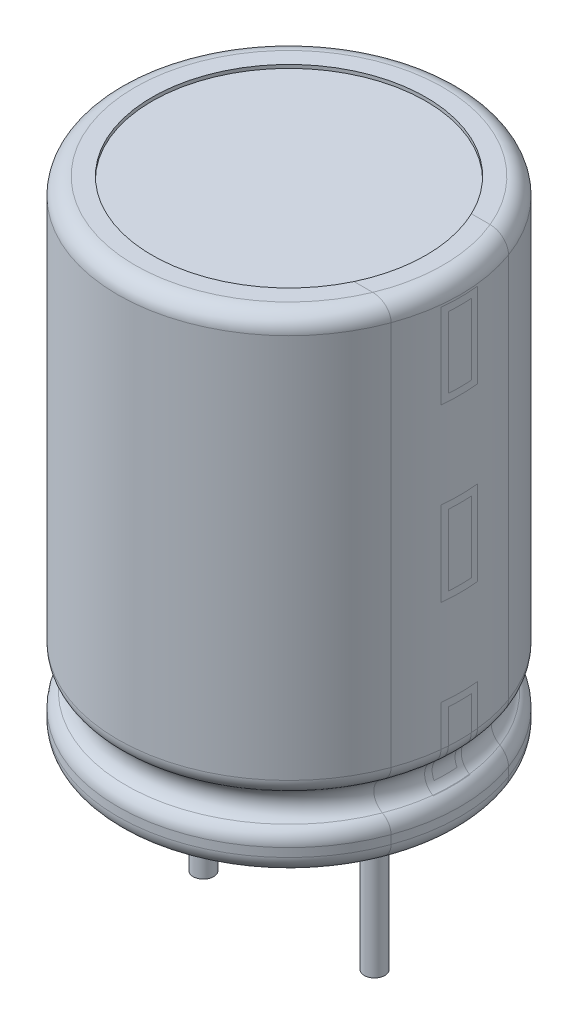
ISO-10303-21;
HEADER;
FILE_DESCRIPTION(('STEP AP214'),'2;1');
FILE_NAME('part.step','',(''),(''),'','','');
FILE_SCHEMA(('AUTOMOTIVE_DESIGN { 1 0 10303 214 1 1 1 1 }'));
ENDSEC;
DATA;
#1=APPLICATION_CONTEXT('core data for automotive mechanical design processes');
#2=APPLICATION_PROTOCOL_DEFINITION('international standard','automotive_design',2000,#1);
#3=PRODUCT_CONTEXT('',#1,'mechanical');
#4=PRODUCT('Part','Part','',(#3));
#5=PRODUCT_RELATED_PRODUCT_CATEGORY('part','',(#4));
#6=PRODUCT_DEFINITION_FORMATION('','',#4);
#7=PRODUCT_DEFINITION_CONTEXT('part definition',#1,'design');
#8=PRODUCT_DEFINITION('design','',#6,#7);
#9=PRODUCT_DEFINITION_SHAPE('','',#8);
#10=(LENGTH_UNIT() NAMED_UNIT(*) SI_UNIT(.MILLI.,.METRE.));
#11=(NAMED_UNIT(*) PLANE_ANGLE_UNIT() SI_UNIT($,.RADIAN.));
#12=(NAMED_UNIT(*) SI_UNIT($,.STERADIAN.) SOLID_ANGLE_UNIT());
#13=UNCERTAINTY_MEASURE_WITH_UNIT(LENGTH_MEASURE(1.E-05),#10,'distance_accuracy_value','');
#14=(GEOMETRIC_REPRESENTATION_CONTEXT(3) GLOBAL_UNCERTAINTY_ASSIGNED_CONTEXT((#13)) GLOBAL_UNIT_ASSIGNED_CONTEXT((#10,
#11,#12)) REPRESENTATION_CONTEXT('',''));
#15=CARTESIAN_POINT('',(0.,0.,0.));
#16=DIRECTION('',(0.,0.,1.));
#17=DIRECTION('',(1.,0.,0.));
#18=AXIS2_PLACEMENT_3D('',#15,#16,#17);
#19=CARTESIAN_POINT('',(0.,2.34947830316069,0.));
#20=DIRECTION('',(0.,-1.,0.));
#21=DIRECTION('',(1.,0.,0.));
#22=AXIS2_PLACEMENT_3D('',#19,#20,#21);
#23=TOROIDAL_SURFACE('',#22,4.5,0.5);
#24=CARTESIAN_POINT('',(0.,1.92510169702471,0.));
#25=DIRECTION('',(0.,-1.,0.));
#26=DIRECTION('',(1.,0.,0.));
#27=AXIS2_PLACEMENT_3D('',#24,#25,#26);
#28=CIRCLE('',#27,4.76439458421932);
#29=CARTESIAN_POINT('',(4.73427101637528,1.92510169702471,-0.534914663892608));
#30=VERTEX_POINT('',#29);
#31=CARTESIAN_POINT('',(4.752608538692,1.92510169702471,-0.334914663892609));
#32=VERTEX_POINT('',#31);
#33=EDGE_CURVE('E266',#30,#32,#28,.T.);
#34=ORIENTED_EDGE('',*,*,#33,.F.);
#35=CARTESIAN_POINT('',(4.81890309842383,1.9909435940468,-0.534914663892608));
#36=CARTESIAN_POINT('',(4.83907653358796,2.01043444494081,-0.534914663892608));
#37=CARTESIAN_POINT('',(4.85762489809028,2.03163557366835,-0.534914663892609));
#38=CARTESIAN_POINT('',(4.89091815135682,2.07686556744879,-0.534914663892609));
#39=CARTESIAN_POINT('',(4.90565871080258,2.10089760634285,-0.534914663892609));
#40=CARTESIAN_POINT('',(4.93088626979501,2.15109436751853,-0.534914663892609));
#41=CARTESIAN_POINT('',(4.94137441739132,2.1772585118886,-0.534914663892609));
#42=CARTESIAN_POINT('',(4.95779042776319,2.23097320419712,-0.534914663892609));
#43=CARTESIAN_POINT('',(4.9637193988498,2.2585234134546,-0.534914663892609));
#44=CARTESIAN_POINT('',(4.97083652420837,2.31414504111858,-0.534914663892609));
#45=CARTESIAN_POINT('',(4.97203892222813,2.34221463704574,-0.534914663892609));
#46=CARTESIAN_POINT('',(4.96970672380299,2.39815705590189,-0.534914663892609));
#47=CARTESIAN_POINT('',(4.96617201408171,2.4260298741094,-0.534914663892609));
#48=CARTESIAN_POINT('',(4.95447759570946,2.48074553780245,-0.534914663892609));
#49=CARTESIAN_POINT('',(4.9463245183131,2.50758980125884,-0.534914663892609));
#50=CARTESIAN_POINT('',(4.92563596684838,2.55953236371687,-0.534914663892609));
#51=CARTESIAN_POINT('',(4.91310048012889,2.584630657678,-0.534914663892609));
#52=CARTESIAN_POINT('',(4.88398112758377,2.63242515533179,-0.534914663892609));
#53=CARTESIAN_POINT('',(4.86738928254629,2.65511649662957,-0.534914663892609));
#54=CARTESIAN_POINT('',(4.83064830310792,2.6974081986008,-0.534914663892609));
#55=CARTESIAN_POINT('',(4.81049909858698,2.7170084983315,-0.534914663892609));
#56=CARTESIAN_POINT('',(4.76711408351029,2.75266439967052,-0.534914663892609));
#57=CARTESIAN_POINT('',(4.74386394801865,2.76870256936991,-0.534914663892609));
#58=CARTESIAN_POINT('',(4.69501418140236,2.79667548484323,-0.534914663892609));
#59=CARTESIAN_POINT('',(4.66941447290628,2.8086100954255,-0.534914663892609));
#60=CARTESIAN_POINT('',(4.61642530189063,2.82811372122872,-0.534914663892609));
#61=CARTESIAN_POINT('',(4.58902587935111,2.83565567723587,-0.534914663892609));
#62=CARTESIAN_POINT('',(4.53335236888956,2.84605896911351,-0.534914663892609));
#63=CARTESIAN_POINT('',(4.50507825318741,2.84892015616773,-0.534914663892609));
#64=CARTESIAN_POINT('',(4.44830141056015,2.84989076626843,-0.534914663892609));
#65=CARTESIAN_POINT('',(4.41979825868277,2.84797545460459,-0.534914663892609));
#66=CARTESIAN_POINT('',(4.36351529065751,2.83939662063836,-0.534914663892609));
#67=CARTESIAN_POINT('',(4.33573548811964,2.83273300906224,-0.534914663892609));
#68=CARTESIAN_POINT('',(4.28163524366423,2.81482457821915,-0.534914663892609));
#69=CARTESIAN_POINT('',(4.25531764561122,2.80357116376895,-0.534914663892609));
#70=CARTESIAN_POINT('',(4.20495265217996,2.77679317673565,-0.534914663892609));
#71=CARTESIAN_POINT('',(4.1809052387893,2.76126863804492,-0.534914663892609));
#72=CARTESIAN_POINT('',(4.13584556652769,2.72643143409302,-0.534914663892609));
#73=CARTESIAN_POINT('',(4.11482448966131,2.70713017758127,-0.534914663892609));
#74=CARTESIAN_POINT('',(4.07634984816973,2.66524963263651,-0.534914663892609));
#75=CARTESIAN_POINT('',(4.05889615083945,2.64267046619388,-0.534914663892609));
#76=CARTESIAN_POINT('',(4.02818918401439,2.59504748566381,-0.534914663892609));
#77=CARTESIAN_POINT('',(4.01490652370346,2.57002262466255,-0.534914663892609));
#78=CARTESIAN_POINT('',(3.99277073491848,2.51808497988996,-0.534914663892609));
#79=CARTESIAN_POINT('',(3.98391738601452,2.49117229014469,-0.534914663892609));
#80=CARTESIAN_POINT('',(3.97096265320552,2.43645791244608,-0.534914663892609));
#81=CARTESIAN_POINT('',(3.9668232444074,2.40866522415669,-0.534914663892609));
#82=CARTESIAN_POINT('',(3.96329267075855,2.35278022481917,-0.534914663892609));
#83=CARTESIAN_POINT('',(3.96390135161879,2.32468792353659,-0.534914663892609));
#84=CARTESIAN_POINT('',(3.96983464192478,2.26913465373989,-0.534914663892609));
#85=CARTESIAN_POINT('',(3.97513800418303,2.24167141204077,-0.534914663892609));
#86=CARTESIAN_POINT('',(3.99027221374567,2.18802272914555,-0.534914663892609));
#87=CARTESIAN_POINT('',(4.00010306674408,2.16183728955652,-0.534914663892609));
#88=CARTESIAN_POINT('',(4.02402236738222,2.11143208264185,-0.534914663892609));
#89=CARTESIAN_POINT('',(4.03811845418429,2.08721594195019,-0.534914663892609));
#90=CARTESIAN_POINT('',(4.07014943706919,2.04147219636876,-0.534914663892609));
#91=CARTESIAN_POINT('',(4.08808446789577,2.0199446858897,-0.534914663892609));
#92=CARTESIAN_POINT('',(4.12741521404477,1.98002666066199,-0.534914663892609));
#93=CARTESIAN_POINT('',(4.14883417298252,1.96165905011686,-0.534914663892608));
#94=CARTESIAN_POINT('',(4.19443056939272,1.92874543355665,-0.534914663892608));
#95=CARTESIAN_POINT('',(4.21860813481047,1.91419960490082,-0.534914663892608));
#96=CARTESIAN_POINT('',(4.26924792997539,1.88922029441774,-0.534914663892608));
#97=CARTESIAN_POINT('',(4.29572719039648,1.87882133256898,-0.534914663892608));
#98=CARTESIAN_POINT('',(4.35004936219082,1.86259047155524,-0.534914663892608));
#99=CARTESIAN_POINT('',(4.37789226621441,1.85675854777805,-0.534914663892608));
#100=CARTESIAN_POINT('',(4.43430571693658,1.84980367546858,-0.534914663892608));
#101=CARTESIAN_POINT('',(4.4628792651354,1.84870505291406,-0.534914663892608));
#102=CARTESIAN_POINT('',(4.51981366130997,1.85131825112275,-0.534914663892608));
#103=CARTESIAN_POINT('',(4.54817445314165,1.85503129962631,-0.534914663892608));
#104=CARTESIAN_POINT('',(4.60389091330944,1.86717540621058,-0.534914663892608));
#105=CARTESIAN_POINT('',(4.63124568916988,1.87561055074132,-0.534914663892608));
#106=CARTESIAN_POINT('',(4.684117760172,1.89696798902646,-0.534914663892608));
#107=CARTESIAN_POINT('',(4.70963724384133,1.90988482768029,-0.534914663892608));
#108=CARTESIAN_POINT('',(4.74917191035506,1.93430587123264,-0.534914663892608));
#109=CARTESIAN_POINT('',(4.7639624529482,1.94457814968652,-0.534914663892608));
#110=CARTESIAN_POINT('',(4.79235915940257,1.96664700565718,-0.534914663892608));
#111=CARTESIAN_POINT('',(4.80596532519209,1.97844358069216,-0.534914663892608));
#112=CARTESIAN_POINT('',(4.81890309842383,1.9909435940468,-0.534914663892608));
#113=B_SPLINE_CURVE_WITH_KNOTS('',3,(#35,#36,#37,#38,#39,#40,#41,#42,#43,#44,#45,#46,#47,#48,
#49,#50,#51,#52,#53,#54,#55,#56,#57,#58,#59,#60,#61,#62,#63,#64,#65,#66,#67,#68,#69,#70,#71,#72,
#73,#74,#75,#76,#77,#78,#79,#80,#81,#82,#83,#84,#85,#86,#87,#88,#89,#90,#91,#92,#93,#94,#95,#96,
#97,#98,#99,#100,#101,#102,#103,#104,#105,#106,#107,#108,#109,#110,#111,#112),.UNSPECIFIED.,.T.,
.F.,(4,2,2,2,2,2,2,2,2,2,2,2,2,2,2,2,2,2,2,2,2,2,2,2,2,2,2,2,2,2,2,2,2,2,2,2,2,2,4),(0.,
0.0840878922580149,0.16827097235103,0.252431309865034,0.336571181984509,0.420457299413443,
0.50434542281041,0.588113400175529,0.67188161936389,0.755815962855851,0.839751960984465,
0.924090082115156,1.00843098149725,1.09328607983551,1.17814387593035,1.26344201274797,
1.3487417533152,1.4342019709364,1.51966151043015,1.60486677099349,1.69006886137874,
1.77465636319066,1.85923965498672,1.94313571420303,2.02702904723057,2.11054462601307,
2.19406030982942,2.27772646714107,2.36139556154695,2.44564767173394,2.52990369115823,
2.6148471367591,2.69979012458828,2.78516914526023,2.8705699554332,2.9560447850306,
3.04141593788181,3.09534388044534,3.14927173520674),.UNSPECIFIED.);
#114=CARTESIAN_POINT('',(4.97130428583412,2.34947830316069,-0.534914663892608));
#115=VERTEX_POINT('',#114);
#116=EDGE_CURVE('E11',#30,#115,#113,.T.);
#117=ORIENTED_EDGE('',*,*,#116,.T.);
#118=CARTESIAN_POINT('',(0.,2.34947830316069,0.));
#119=DIRECTION('',(0.,-1.,0.));
#120=DIRECTION('',(1.,0.,0.));
#121=AXIS2_PLACEMENT_3D('',#118,#119,#120);
#122=CIRCLE('',#121,5.);
#123=CARTESIAN_POINT('',(4.98877060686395,2.34947830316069,-0.334914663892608));
#124=VERTEX_POINT('',#123);
#125=EDGE_CURVE('E487',#115,#124,#122,.T.);
#126=ORIENTED_EDGE('',*,*,#125,.T.);
#127=CARTESIAN_POINT('',(4.8260861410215,1.98074626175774,-0.334914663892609));
#128=CARTESIAN_POINT('',(4.8468133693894,1.99968485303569,-0.334914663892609));
#129=CARTESIAN_POINT('',(4.86595876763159,2.02038454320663,-0.334914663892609));
#130=CARTESIAN_POINT('',(4.90051975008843,2.0647205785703,-0.334914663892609));
#131=CARTESIAN_POINT('',(4.915930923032,2.08836034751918,-0.334914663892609));
#132=CARTESIAN_POINT('',(4.94255772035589,2.13788620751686,-0.334914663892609));
#133=CARTESIAN_POINT('',(4.95377499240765,2.16377141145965,-0.334914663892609));
#134=CARTESIAN_POINT('',(4.97169484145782,2.21705244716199,-0.334914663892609));
#135=CARTESIAN_POINT('',(4.97839853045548,2.24444790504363,-0.334914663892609));
#136=CARTESIAN_POINT('',(4.98709818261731,2.29994344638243,-0.334914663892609));
#137=CARTESIAN_POINT('',(4.98909967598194,2.32804266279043,-0.334914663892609));
#138=CARTESIAN_POINT('',(4.98835335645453,2.38417888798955,-0.334914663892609));
#139=CARTESIAN_POINT('',(4.98560538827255,2.41221589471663,-0.334914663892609));
#140=CARTESIAN_POINT('',(4.9754424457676,2.46741097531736,-0.334914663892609));
#141=CARTESIAN_POINT('',(4.96803064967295,2.49456963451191,-0.334914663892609));
#142=CARTESIAN_POINT('',(4.9487556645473,2.54725829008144,-0.334914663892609));
#143=CARTESIAN_POINT('',(4.93689247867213,2.57278828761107,-0.334914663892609));
#144=CARTESIAN_POINT('',(4.90904493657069,2.62151443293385,-0.334914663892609));
#145=CARTESIAN_POINT('',(4.89305782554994,2.64470900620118,-0.334914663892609));
#146=CARTESIAN_POINT('',(4.85742300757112,2.68809100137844,-0.334914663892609));
#147=CARTESIAN_POINT('',(4.83777527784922,2.70827840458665,-0.334914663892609));
#148=CARTESIAN_POINT('',(4.79533991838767,2.7451129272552,-0.334914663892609));
#149=CARTESIAN_POINT('',(4.77254669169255,2.76175359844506,-0.334914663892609));
#150=CARTESIAN_POINT('',(4.72449540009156,2.79098272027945,-0.334914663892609));
#151=CARTESIAN_POINT('',(4.69923730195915,2.80357111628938,-0.334914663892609));
#152=CARTESIAN_POINT('',(4.64690917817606,2.82436994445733,-0.334914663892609));
#153=CARTESIAN_POINT('',(4.61983499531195,2.83256991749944,-0.334914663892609));
#154=CARTESIAN_POINT('',(4.5646955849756,2.84431866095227,-0.334914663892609));
#155=CARTESIAN_POINT('',(4.53663034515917,2.84786737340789,-0.334914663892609));
#156=CARTESIAN_POINT('',(4.48024293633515,2.85021863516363,-0.334914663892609));
#157=CARTESIAN_POINT('',(4.45192035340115,2.84901126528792,-0.334914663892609));
#158=CARTESIAN_POINT('',(4.39587878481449,2.84186314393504,-0.334914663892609));
#159=CARTESIAN_POINT('',(4.36815980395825,2.83592235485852,-0.334914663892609));
#160=CARTESIAN_POINT('',(4.31408819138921,2.8194672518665,-0.334914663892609));
#161=CARTESIAN_POINT('',(4.28773674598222,2.8089490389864,-0.334914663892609));
#162=CARTESIAN_POINT('',(4.23717608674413,2.78363359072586,-0.334914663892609));
#163=CARTESIAN_POINT('',(4.21296686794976,2.76883636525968,-0.334914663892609));
#164=CARTESIAN_POINT('',(4.16740642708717,2.73539622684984,-0.334914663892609));
#165=CARTESIAN_POINT('',(4.14605232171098,2.71675724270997,-0.334914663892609));
#166=CARTESIAN_POINT('',(4.10678687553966,2.67615000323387,-0.334914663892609));
#167=CARTESIAN_POINT('',(4.08887548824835,2.6541817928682,-0.334914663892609));
#168=CARTESIAN_POINT('',(4.05705718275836,2.60760268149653,-0.334914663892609));
#169=CARTESIAN_POINT('',(4.04313951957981,2.5829991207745,-0.334914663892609));
#170=CARTESIAN_POINT('',(4.01964766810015,2.53179906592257,-0.334914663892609));
#171=CARTESIAN_POINT('',(4.0100733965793,2.50520260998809,-0.334914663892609));
#172=CARTESIAN_POINT('',(3.99557092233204,2.45086317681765,-0.334914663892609));
#173=CARTESIAN_POINT('',(3.99062794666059,2.42312414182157,-0.334914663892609));
#174=CARTESIAN_POINT('',(3.98547918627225,2.36720997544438,-0.334914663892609));
#175=CARTESIAN_POINT('',(3.98527333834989,2.33903484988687,-0.334914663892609));
#176=CARTESIAN_POINT('',(3.9896004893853,2.28310594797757,-0.334914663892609));
#177=CARTESIAN_POINT('',(3.99412433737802,2.25535146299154,-0.334914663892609));
#178=CARTESIAN_POINT('',(4.00776528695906,2.20099545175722,-0.334914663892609));
#179=CARTESIAN_POINT('',(4.01688238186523,2.1743939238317,-0.334914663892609));
#180=CARTESIAN_POINT('',(4.03945173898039,2.12308307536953,-0.334914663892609));
#181=CARTESIAN_POINT('',(4.05290612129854,2.09837468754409,-0.334914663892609));
#182=CARTESIAN_POINT('',(4.08376185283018,2.05155951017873,-0.334914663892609));
#183=CARTESIAN_POINT('',(4.10116325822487,2.02945275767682,-0.334914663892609));
#184=CARTESIAN_POINT('',(4.13946624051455,1.98840577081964,-0.334914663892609));
#185=CARTESIAN_POINT('',(4.16037681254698,1.9694739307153,-0.334914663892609));
#186=CARTESIAN_POINT('',(4.20507082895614,1.93537589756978,-0.334914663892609));
#187=CARTESIAN_POINT('',(4.22885432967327,1.92020977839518,-0.334914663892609));
#188=CARTESIAN_POINT('',(4.27870169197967,1.89402306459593,-0.334914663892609));
#189=CARTESIAN_POINT('',(4.30477266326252,1.88301600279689,-0.334914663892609));
#190=CARTESIAN_POINT('',(4.35838901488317,1.86552465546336,-0.334914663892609));
#191=CARTESIAN_POINT('',(4.38593435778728,1.85904025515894,-0.334914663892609));
#192=CARTESIAN_POINT('',(4.44177960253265,1.85076646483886,-0.334914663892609));
#193=CARTESIAN_POINT('',(4.4700809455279,1.84898680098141,-0.334914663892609));
#194=CARTESIAN_POINT('',(4.52658872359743,1.85020247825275,-0.334914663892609));
#195=CARTESIAN_POINT('',(4.55479513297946,1.85319902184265,-0.334914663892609));
#196=CARTESIAN_POINT('',(4.6103235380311,1.86388906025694,-0.334914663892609));
#197=CARTESIAN_POINT('',(4.63764483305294,1.87158618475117,-0.334914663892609));
#198=CARTESIAN_POINT('',(4.69058000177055,1.89146185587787,-0.334914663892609));
#199=CARTESIAN_POINT('',(4.71619589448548,1.90363498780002,-0.334914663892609));
#200=CARTESIAN_POINT('',(4.75590214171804,1.92679481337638,-0.334914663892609));
#201=CARTESIAN_POINT('',(4.7707331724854,1.93653621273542,-0.334914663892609));
#202=CARTESIAN_POINT('',(4.79928171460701,1.95753314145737,-0.334914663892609));
#203=CARTESIAN_POINT('',(4.81299922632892,1.96878867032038,-0.334914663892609));
#204=CARTESIAN_POINT('',(4.8260861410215,1.98074626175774,-0.334914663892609));
#205=B_SPLINE_CURVE_WITH_KNOTS('',3,(#127,#128,#129,#130,#131,#132,#133,#134,#135,#136,#137,
#138,#139,#140,#141,#142,#143,#144,#145,#146,#147,#148,#149,#150,#151,#152,#153,#154,#155,#156,
#157,#158,#159,#160,#161,#162,#163,#164,#165,#166,#167,#168,#169,#170,#171,#172,#173,#174,#175,
#176,#177,#178,#179,#180,#181,#182,#183,#184,#185,#186,#187,#188,#189,#190,#191,#192,#193,#194,
#195,#196,#197,#198,#199,#200,#201,#202,#203,#204),.UNSPECIFIED.,.T.,.F.,(4,2,2,2,2,2,2,2,2,2,2,
2,2,2,2,2,2,2,2,2,2,2,2,2,2,2,2,2,2,2,2,2,2,2,2,2,2,2,4),(0.,0.0841648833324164,
0.168428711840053,0.252659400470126,0.336869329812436,0.420980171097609,0.505093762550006,
0.589150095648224,0.67320636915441,0.757318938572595,0.841432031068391,0.925696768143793,
1.00996264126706,1.09442846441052,1.17889533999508,1.26353847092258,1.3481822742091,
1.43289831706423,1.5176141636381,1.6022438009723,1.6868722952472,1.77127091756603,
1.85566792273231,1.9397947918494,2.02392053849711,2.10788382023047,2.19184697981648,
2.27585124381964,2.35985670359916,2.44408088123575,2.52830671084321,2.61280428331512,
2.69729971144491,2.78196968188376,2.8666609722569,2.95141774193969,3.03607231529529,
3.08921299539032,3.1423536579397),.UNSPECIFIED.);
#206=EDGE_CURVE('E382',#32,#124,#205,.T.);
#207=ORIENTED_EDGE('',*,*,#206,.F.);
#208=EDGE_LOOP('',(#34,#117,#126,#207));
#209=FACE_BOUND('',#208,.T.);
#210=ADVANCED_FACE('F36',(#209),#23,.T.);
#211=CARTESIAN_POINT('',(0.,0.650521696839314,0.));
#212=DIRECTION('',(0.,-1.,0.));
#213=DIRECTION('',(1.,0.,0.));
#214=AXIS2_PLACEMENT_3D('',#211,#212,#213);
#215=TOROIDAL_SURFACE('',#214,4.5,0.5);
#216=CARTESIAN_POINT('',(0.,1.07489830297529,0.));
#217=DIRECTION('',(0.,-1.,0.));
#218=DIRECTION('',(1.,0.,0.));
#219=AXIS2_PLACEMENT_3D('',#216,#217,#218);
#220=CIRCLE('',#219,4.76439458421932);
#221=CARTESIAN_POINT('',(4.73427101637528,1.07489830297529,-0.534914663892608));
#222=VERTEX_POINT('',#221);
#223=CARTESIAN_POINT('',(4.73427101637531,1.07489830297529,0.534914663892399));
#224=VERTEX_POINT('',#223);
#225=EDGE_CURVE('E632',#222,#224,#220,.T.);
#226=ORIENTED_EDGE('',*,*,#225,.T.);
#227=CARTESIAN_POINT('',(4.65099610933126,1.11635564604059,0.534914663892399));
#228=CARTESIAN_POINT('',(4.67732940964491,1.10615272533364,0.534914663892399));
#229=CARTESIAN_POINT('',(4.70282362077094,1.09372910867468,0.534914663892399));
#230=CARTESIAN_POINT('',(4.7513896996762,1.06477395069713,0.534914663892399));
#231=CARTESIAN_POINT('',(4.77445876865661,1.04823773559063,0.534914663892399));
#232=CARTESIAN_POINT('',(4.81748490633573,1.01152253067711,0.534914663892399));
#233=CARTESIAN_POINT('',(4.83744264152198,0.991344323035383,0.534914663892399));
#234=CARTESIAN_POINT('',(4.8736631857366,0.947915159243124,0.534914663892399));
#235=CARTESIAN_POINT('',(4.88992692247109,0.924664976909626,0.534914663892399));
#236=CARTESIAN_POINT('',(4.91822665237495,0.875855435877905,0.534914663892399));
#237=CARTESIAN_POINT('',(4.9302807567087,0.850306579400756,0.534914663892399));
#238=CARTESIAN_POINT('',(4.9499051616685,0.797540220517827,0.534914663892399));
#239=CARTESIAN_POINT('',(4.957475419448,0.77032270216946,0.534914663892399));
#240=CARTESIAN_POINT('',(4.96788272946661,0.715134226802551,0.534914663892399));
#241=CARTESIAN_POINT('',(4.97074253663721,0.687167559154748,0.534914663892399));
#242=CARTESIAN_POINT('',(4.97171592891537,0.631152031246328,0.534914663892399));
#243=CARTESIAN_POINT('',(4.96982960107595,0.603103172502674,0.534914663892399));
#244=CARTESIAN_POINT('',(4.961374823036,0.547778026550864,0.534914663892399));
#245=CARTESIAN_POINT('',(4.95481572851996,0.520500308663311,0.534914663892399));
#246=CARTESIAN_POINT('',(4.9372172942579,0.467431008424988,0.534914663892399));
#247=CARTESIAN_POINT('',(4.9261779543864,0.441639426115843,0.534914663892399));
#248=CARTESIAN_POINT('',(4.89992101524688,0.39223284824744,0.534914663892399));
#249=CARTESIAN_POINT('',(4.88469757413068,0.368620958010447,0.534914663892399));
#250=CARTESIAN_POINT('',(4.85051881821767,0.324273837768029,0.534914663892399));
#251=CARTESIAN_POINT('',(4.83156342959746,0.303538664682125,0.534914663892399));
#252=CARTESIAN_POINT('',(4.79037246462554,0.265433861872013,0.534914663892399));
#253=CARTESIAN_POINT('',(4.76812287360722,0.248079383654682,0.534914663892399));
#254=CARTESIAN_POINT('',(4.72104041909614,0.217325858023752,0.534914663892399));
#255=CARTESIAN_POINT('',(4.6962074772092,0.203926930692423,0.534914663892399));
#256=CARTESIAN_POINT('',(4.64450371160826,0.181379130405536,0.534914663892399));
#257=CARTESIAN_POINT('',(4.61762153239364,0.172256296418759,0.534914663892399));
#258=CARTESIAN_POINT('',(4.5627115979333,0.158625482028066,0.534914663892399));
#259=CARTESIAN_POINT('',(4.53468380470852,0.154117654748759,0.534914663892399));
#260=CARTESIAN_POINT('',(4.47811271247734,0.149823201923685,0.534914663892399));
#261=CARTESIAN_POINT('',(4.44956742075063,0.150062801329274,0.534914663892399));
#262=CARTESIAN_POINT('',(4.39291944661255,0.155317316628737,0.534914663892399));
#263=CARTESIAN_POINT('',(4.364816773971,0.160332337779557,0.534914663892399));
#264=CARTESIAN_POINT('',(4.30977600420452,0.175017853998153,0.534914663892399));
#265=CARTESIAN_POINT('',(4.28284114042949,0.18470047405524,0.534914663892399));
#266=CARTESIAN_POINT('',(4.23098368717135,0.208459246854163,0.534914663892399));
#267=CARTESIAN_POINT('',(4.20606109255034,0.222535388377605,0.534914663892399));
#268=CARTESIAN_POINT('',(4.15899713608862,0.254657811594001,0.534914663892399));
#269=CARTESIAN_POINT('',(4.13685005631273,0.272695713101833,0.534914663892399));
#270=CARTESIAN_POINT('',(4.0959235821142,0.312256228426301,0.534914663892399));
#271=CARTESIAN_POINT('',(4.07714407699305,0.333778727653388,0.534914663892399));
#272=CARTESIAN_POINT('',(4.04362310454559,0.379547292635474,0.534914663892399));
#273=CARTESIAN_POINT('',(4.02885564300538,0.403774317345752,0.534914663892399));
#274=CARTESIAN_POINT('',(4.00363725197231,0.454379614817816,0.534914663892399));
#275=CARTESIAN_POINT('',(3.99318611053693,0.480757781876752,0.534914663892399));
#276=CARTESIAN_POINT('',(3.97698556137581,0.534681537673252,0.534914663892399));
#277=CARTESIAN_POINT('',(3.97119787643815,0.562215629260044,0.534914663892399));
#278=CARTESIAN_POINT('',(3.96435538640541,0.617865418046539,0.534914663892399));
#279=CARTESIAN_POINT('',(3.96330039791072,0.645981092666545,0.534914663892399));
#280=CARTESIAN_POINT('',(3.96594777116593,0.701833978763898,0.534914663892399));
#281=CARTESIAN_POINT('',(3.96962437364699,0.72957241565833,0.534914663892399));
#282=CARTESIAN_POINT('',(3.98157967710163,0.784038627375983,0.534914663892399));
#283=CARTESIAN_POINT('',(3.98985836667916,0.810766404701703,0.534914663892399));
#284=CARTESIAN_POINT('',(4.01077801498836,0.862476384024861,0.534914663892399));
#285=CARTESIAN_POINT('',(4.02342188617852,0.887457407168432,0.534914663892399));
#286=CARTESIAN_POINT('',(4.05269895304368,0.93496023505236,0.534914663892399));
#287=CARTESIAN_POINT('',(4.06933227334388,0.95748196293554,0.534914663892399));
#288=CARTESIAN_POINT('',(4.10622471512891,0.999582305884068,0.534914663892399));
#289=CARTESIAN_POINT('',(4.12650610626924,1.01914140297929,0.534914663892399));
#290=CARTESIAN_POINT('',(4.17004043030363,1.05461030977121,0.534914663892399));
#291=CARTESIAN_POINT('',(4.19329337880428,1.07052010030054,0.534914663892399));
#292=CARTESIAN_POINT('',(4.24231537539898,1.09837557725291,0.534914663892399));
#293=CARTESIAN_POINT('',(4.26810340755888,1.11028785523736,0.534914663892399));
#294=CARTESIAN_POINT('',(4.32131258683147,1.12964613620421,0.534914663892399));
#295=CARTESIAN_POINT('',(4.34873419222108,1.13709087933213,0.534914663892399));
#296=CARTESIAN_POINT('',(4.4046117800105,1.14733990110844,0.534914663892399));
#297=CARTESIAN_POINT('',(4.43307328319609,1.15011400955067,0.534914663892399));
#298=CARTESIAN_POINT('',(4.49003512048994,1.15084504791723,0.534914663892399));
#299=CARTESIAN_POINT('',(4.51853536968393,1.14880763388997,0.534914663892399));
#300=CARTESIAN_POINT('',(4.56447463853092,1.14160379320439,0.534914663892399));
#301=CARTESIAN_POINT('',(4.58214787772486,1.13785381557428,0.534914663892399));
#302=CARTESIAN_POINT('',(4.61699369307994,1.12849013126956,0.534914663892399));
#303=CARTESIAN_POINT('',(4.63416626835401,1.12287642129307,0.534914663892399));
#304=CARTESIAN_POINT('',(4.65099610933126,1.11635564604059,0.534914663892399));
#305=B_SPLINE_CURVE_WITH_KNOTS('',3,(#227,#228,#229,#230,#231,#232,#233,#234,#235,#236,#237,
#238,#239,#240,#241,#242,#243,#244,#245,#246,#247,#248,#249,#250,#251,#252,#253,#254,#255,#256,
#257,#258,#259,#260,#261,#262,#263,#264,#265,#266,#267,#268,#269,#270,#271,#272,#273,#274,#275,
#276,#277,#278,#279,#280,#281,#282,#283,#284,#285,#286,#287,#288,#289,#290,#291,#292,#293,#294,
#295,#296,#297,#298,#299,#300,#301,#302,#303,#304),.UNSPECIFIED.,.T.,.F.,(4,2,2,2,2,2,2,2,2,2,2,
2,2,2,2,2,2,2,2,2,2,2,2,2,2,2,2,2,2,2,2,2,2,2,2,2,2,2,4),(0.,0.0846570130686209,
0.169410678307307,0.254146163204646,0.338860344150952,0.423205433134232,0.507551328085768,
0.59148856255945,0.675424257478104,0.759192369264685,0.842960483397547,0.92684615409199,
1.01073348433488,1.09498853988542,1.17924615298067,1.26401038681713,1.34877743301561,
1.43401286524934,1.51925017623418,1.60471011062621,1.69016982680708,1.77545048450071,
1.86072833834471,1.94543973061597,2.03014696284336,2.11415163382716,2.19815304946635,
2.28169908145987,2.36524490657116,2.44884658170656,2.53245086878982,2.6165839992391,
2.70071757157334,2.78553771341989,2.87038176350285,2.95577179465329,3.04106149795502,
3.0951664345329,3.1492714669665),.UNSPECIFIED.);
#306=CARTESIAN_POINT('',(4.74747520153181,1.06643651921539,0.534914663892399));
#307=VERTEX_POINT('',#306);
#308=EDGE_CURVE('E46',#224,#307,#305,.T.);
#309=ORIENTED_EDGE('',*,*,#308,.T.);
#310=CARTESIAN_POINT('',(0.,1.06643651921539,0.));
#311=DIRECTION('',(0.,-1.,0.));
#312=DIRECTION('',(0.,0.,-1.));
#313=AXIS2_PLACEMENT_3D('',#310,#311,#312);
#314=CIRCLE('',#313,4.77751551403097);
#315=CARTESIAN_POINT('',(4.74747520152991,1.06643651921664,-0.534914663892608));
#316=VERTEX_POINT('',#315);
#317=EDGE_CURVE('E56',#307,#316,#314,.F.);
#318=ORIENTED_EDGE('',*,*,#317,.T.);
#319=CARTESIAN_POINT('',(4.65099610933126,1.11635564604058,-0.534914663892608));
#320=CARTESIAN_POINT('',(4.62446394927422,1.12663294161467,-0.534914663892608));
#321=CARTESIAN_POINT('',(4.59704141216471,1.13467084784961,-0.534914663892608));
#322=CARTESIAN_POINT('',(4.541212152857,1.14603272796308,-0.534914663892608));
#323=CARTESIAN_POINT('',(4.51280422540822,1.14935070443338,-0.534914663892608));
#324=CARTESIAN_POINT('',(4.45584891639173,1.15117299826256,-0.534914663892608));
#325=CARTESIAN_POINT('',(4.42730162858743,1.1496801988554,-0.534914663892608));
#326=CARTESIAN_POINT('',(4.37086927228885,1.14193094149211,-0.534914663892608));
#327=CARTESIAN_POINT('',(4.34298403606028,1.13567570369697,-0.534914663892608));
#328=CARTESIAN_POINT('',(4.28861610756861,1.11856357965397,-0.534914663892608));
#329=CARTESIAN_POINT('',(4.26213559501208,1.1076997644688,-0.534914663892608));
#330=CARTESIAN_POINT('',(4.21137978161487,1.08166845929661,-0.534914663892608));
#331=CARTESIAN_POINT('',(4.18710456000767,1.06650081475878,-0.534914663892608));
#332=CARTESIAN_POINT('',(4.14152748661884,1.03233046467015,-0.534914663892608));
#333=CARTESIAN_POINT('',(4.12021756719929,1.01333852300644,-0.534914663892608));
#334=CARTESIAN_POINT('',(4.08111655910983,0.972023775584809,-0.534914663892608));
#335=CARTESIAN_POINT('',(4.06332533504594,0.949701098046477,-0.534914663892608));
#336=CARTESIAN_POINT('',(4.03190446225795,0.902525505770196,-0.534914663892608));
#337=CARTESIAN_POINT('',(4.01824624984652,0.877691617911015,-0.534914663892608));
#338=CARTESIAN_POINT('',(3.99533270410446,0.826069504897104,-0.534914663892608));
#339=CARTESIAN_POINT('',(3.98607714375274,0.799281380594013,-0.534914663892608));
#340=CARTESIAN_POINT('',(3.97230716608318,0.744746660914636,-0.534914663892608));
#341=CARTESIAN_POINT('',(3.96775458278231,0.717009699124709,-0.534914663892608));
#342=CARTESIAN_POINT('',(3.96339538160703,0.661165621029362,-0.534914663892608));
#343=CARTESIAN_POINT('',(3.96358860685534,0.633058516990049,-0.534914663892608));
#344=CARTESIAN_POINT('',(3.96870256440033,0.57741299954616,-0.534914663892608));
#345=CARTESIAN_POINT('',(3.97360087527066,0.549872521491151,-0.534914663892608));
#346=CARTESIAN_POINT('',(3.98794499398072,0.496003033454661,-0.534914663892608));
#347=CARTESIAN_POINT('',(3.99739080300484,0.469674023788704,-0.534914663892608));
#348=CARTESIAN_POINT('',(4.02056712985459,0.418927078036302,-0.534914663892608));
#349=CARTESIAN_POINT('',(4.03430414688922,0.394512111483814,-0.534914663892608));
#350=CARTESIAN_POINT('',(4.0656557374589,0.348314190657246,-0.534914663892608));
#351=CARTESIAN_POINT('',(4.08327043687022,0.326531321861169,-0.534914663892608));
#352=CARTESIAN_POINT('',(4.12200282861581,0.286054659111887,-0.534914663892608));
#353=CARTESIAN_POINT('',(4.14314357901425,0.267382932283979,-0.534914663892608));
#354=CARTESIAN_POINT('',(4.18823790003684,0.233818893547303,-0.534914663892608));
#355=CARTESIAN_POINT('',(4.21219159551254,0.218926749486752,-0.534914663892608));
#356=CARTESIAN_POINT('',(4.26244302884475,0.193218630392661,-0.534914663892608));
#357=CARTESIAN_POINT('',(4.28875834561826,0.182437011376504,-0.534914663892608));
#358=CARTESIAN_POINT('',(4.34281958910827,0.165417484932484,-0.534914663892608));
#359=CARTESIAN_POINT('',(4.37056556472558,0.159179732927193,-0.534914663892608));
#360=CARTESIAN_POINT('',(4.42686217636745,0.151398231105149,-0.534914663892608));
#361=CARTESIAN_POINT('',(4.4554163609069,0.149880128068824,-0.534914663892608));
#362=CARTESIAN_POINT('',(4.51237510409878,0.151655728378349,-0.534914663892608));
#363=CARTESIAN_POINT('',(4.54077966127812,0.154949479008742,-0.534914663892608));
#364=CARTESIAN_POINT('',(4.59664910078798,0.166266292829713,-0.534914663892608));
#365=CARTESIAN_POINT('',(4.6241134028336,0.174292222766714,-0.534914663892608));
#366=CARTESIAN_POINT('',(4.67729694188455,0.194858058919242,-0.534914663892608));
#367=CARTESIAN_POINT('',(4.70301620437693,0.207397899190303,-0.534914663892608));
#368=CARTESIAN_POINT('',(4.75187432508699,0.236589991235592,-0.534914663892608));
#369=CARTESIAN_POINT('',(4.77502244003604,0.253226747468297,-0.534914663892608));
#370=CARTESIAN_POINT('',(4.81817560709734,0.290171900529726,-0.534914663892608));
#371=CARTESIAN_POINT('',(4.83818075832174,0.310480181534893,-0.534914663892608));
#372=CARTESIAN_POINT('',(4.87435265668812,0.354062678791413,-0.534914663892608));
#373=CARTESIAN_POINT('',(4.89054155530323,0.377318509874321,-0.534914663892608));
#374=CARTESIAN_POINT('',(4.91875885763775,0.426230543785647,-0.534914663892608));
#375=CARTESIAN_POINT('',(4.93078739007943,0.451886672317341,-0.534914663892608));
#376=CARTESIAN_POINT('',(4.95027267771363,0.504712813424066,-0.534914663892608));
#377=CARTESIAN_POINT('',(4.95775519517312,0.531873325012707,-0.534914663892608));
#378=CARTESIAN_POINT('',(4.96803611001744,0.58706680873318,-0.534914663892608));
#379=CARTESIAN_POINT('',(4.97083460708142,0.615099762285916,-0.534914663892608));
#380=CARTESIAN_POINT('',(4.97166371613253,0.671137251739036,-0.534914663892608));
#381=CARTESIAN_POINT('',(4.96971102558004,0.699141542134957,-0.534914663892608));
#382=CARTESIAN_POINT('',(4.96113014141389,0.754422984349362,-0.534914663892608));
#383=CARTESIAN_POINT('',(4.95450216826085,0.781700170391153,-0.534914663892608));
#384=CARTESIAN_POINT('',(4.93676833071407,0.834745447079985,-0.534914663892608));
#385=CARTESIAN_POINT('',(4.92566419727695,0.860514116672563,-0.534914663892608));
#386=CARTESIAN_POINT('',(4.89929639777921,0.909835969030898,-0.534914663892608));
#387=CARTESIAN_POINT('',(4.88403164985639,0.933388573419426,-0.534914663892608));
#388=CARTESIAN_POINT('',(4.84972673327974,0.977690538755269,-0.534914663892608));
#389=CARTESIAN_POINT('',(4.8306735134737,0.998429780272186,-0.534914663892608));
#390=CARTESIAN_POINT('',(4.78938574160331,1.03641565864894,-0.534914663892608));
#391=CARTESIAN_POINT('',(4.76715496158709,1.05366637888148,-0.534914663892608));
#392=CARTESIAN_POINT('',(4.72908748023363,1.0784154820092,-0.534914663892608));
#393=CARTESIAN_POINT('',(4.71402649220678,1.08713023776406,-0.534914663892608));
#394=CARTESIAN_POINT('',(4.6830865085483,1.10296055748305,-0.534914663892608));
#395=CARTESIAN_POINT('',(4.66720751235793,1.11007612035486,-0.534914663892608));
#396=CARTESIAN_POINT('',(4.65099610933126,1.11635564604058,-0.534914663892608));
#397=B_SPLINE_CURVE_WITH_KNOTS('',3,(#319,#320,#321,#322,#323,#324,#325,#326,#327,#328,#329,
#330,#331,#332,#333,#334,#335,#336,#337,#338,#339,#340,#341,#342,#343,#344,#345,#346,#347,#348,
#349,#350,#351,#352,#353,#354,#355,#356,#357,#358,#359,#360,#361,#362,#363,#364,#365,#366,#367,
#368,#369,#370,#371,#372,#373,#374,#375,#376,#377,#378,#379,#380,#381,#382,#383,#384,#385,#386,
#387,#388,#389,#390,#391,#392,#393,#394,#395,#396),.UNSPECIFIED.,.T.,.F.,(4,2,2,2,2,2,2,2,2,2,2,
2,2,2,2,2,2,2,2,2,2,2,2,2,2,2,2,2,2,2,2,2,2,2,2,2,2,2,4),(0.,0.0852955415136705,
0.170699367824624,0.256052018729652,0.341382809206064,0.426842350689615,0.51230496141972,
0.597530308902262,0.682752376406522,0.76737125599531,0.851985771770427,0.935908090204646,
1.01982763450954,1.10334924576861,1.18687087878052,1.27051962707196,1.3541710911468,
1.43839272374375,1.52261809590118,1.60753275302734,1.69245031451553,1.77782852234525,
1.86320756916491,1.94863839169,2.03406796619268,2.11917925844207,2.20428786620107,
2.28888957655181,2.37348866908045,2.45760375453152,2.54171704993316,2.62553516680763,
2.70934933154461,2.79313111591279,2.87693470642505,2.96103216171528,3.04503060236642,
3.09714695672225,3.14926334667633),.UNSPECIFIED.);
#398=EDGE_CURVE('E428',#316,#222,#397,.T.);
#399=ORIENTED_EDGE('',*,*,#398,.T.);
#400=EDGE_LOOP('',(#226,#309,#318,#399));
#401=FACE_BOUND('',#400,.T.);
#402=ADVANCED_FACE('F610',(#401),#215,.T.);
#403=CARTESIAN_POINT('',(0.,1.5,0.));
#404=DIRECTION('',(0.,-1.,0.));
#405=DIRECTION('',(1.,0.,0.));
#406=AXIS2_PLACEMENT_3D('',#403,#404,#405);
#407=TOROIDAL_SURFACE('',#406,5.02924091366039,0.500854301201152);
#408=CARTESIAN_POINT('',(4.75260853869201,1.92510169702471,0.334914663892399));
#409=VERTEX_POINT('',#408);
#410=CARTESIAN_POINT('',(4.73427101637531,1.92510169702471,0.534914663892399));
#411=VERTEX_POINT('',#410);
#412=EDGE_CURVE('E590',#409,#411,#28,.T.);
#413=ORIENTED_EDGE('',*,*,#412,.T.);
#414=CARTESIAN_POINT('',(4.61230411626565,1.18087285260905,0.534914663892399));
#415=CARTESIAN_POINT('',(4.63042033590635,1.15910706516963,0.534914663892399));
#416=CARTESIAN_POINT('',(4.65039699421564,1.13886182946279,0.534914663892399));
#417=CARTESIAN_POINT('',(4.69348691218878,1.10200073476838,0.534914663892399));
#418=CARTESIAN_POINT('',(4.71660416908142,1.08538957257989,0.534914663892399));
#419=CARTESIAN_POINT('',(4.76528143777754,1.0562883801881,0.534914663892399));
#420=CARTESIAN_POINT('',(4.79083969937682,1.04379542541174,0.534914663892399));
#421=CARTESIAN_POINT('',(4.84367793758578,1.02326372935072,0.534914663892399));
#422=CARTESIAN_POINT('',(4.87095747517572,1.01522385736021,0.534914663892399));
#423=CARTESIAN_POINT('',(4.92657885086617,1.00379240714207,0.534914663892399));
#424=CARTESIAN_POINT('',(4.95492423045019,1.00041805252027,0.534914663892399));
#425=CARTESIAN_POINT('',(5.01178102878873,0.998468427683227,0.534914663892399));
#426=CARTESIAN_POINT('',(5.04029245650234,0.999893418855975,0.534914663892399));
#427=CARTESIAN_POINT('',(5.09671108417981,1.00751197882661,0.534914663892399));
#428=CARTESIAN_POINT('',(5.12461740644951,1.01371205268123,0.534914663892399));
#429=CARTESIAN_POINT('',(5.17898900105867,1.03071997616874,0.534914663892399));
#430=CARTESIAN_POINT('',(5.20545428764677,1.04152778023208,0.534914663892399));
#431=CARTESIAN_POINT('',(5.25612506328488,1.06742220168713,0.534914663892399));
#432=CARTESIAN_POINT('',(5.28033561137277,1.08249891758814,0.534914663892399));
#433=CARTESIAN_POINT('',(5.32586667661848,1.11652046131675,0.534914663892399));
#434=CARTESIAN_POINT('',(5.34718726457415,1.13546519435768,0.534914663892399));
#435=CARTESIAN_POINT('',(5.38622850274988,1.17659335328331,0.534914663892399));
#436=CARTESIAN_POINT('',(5.40396512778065,1.19876161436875,0.534914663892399));
#437=CARTESIAN_POINT('',(5.43544340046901,1.24577330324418,0.534914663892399));
#438=CARTESIAN_POINT('',(5.44918515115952,1.27061666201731,0.534914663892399));
#439=CARTESIAN_POINT('',(5.47221502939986,1.32214410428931,0.534914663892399));
#440=CARTESIAN_POINT('',(5.4815243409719,1.34881872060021,0.534914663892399));
#441=CARTESIAN_POINT('',(5.49551559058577,1.40335502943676,0.534914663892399));
#442=CARTESIAN_POINT('',(5.50019762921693,1.43121669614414,0.534914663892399));
#443=CARTESIAN_POINT('',(5.50478955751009,1.4872364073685,0.534914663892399));
#444=CARTESIAN_POINT('',(5.50471535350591,1.51539314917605,0.534914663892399));
#445=CARTESIAN_POINT('',(5.49983664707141,1.57129357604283,0.534914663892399));
#446=CARTESIAN_POINT('',(5.49503218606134,1.59903726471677,0.534914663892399));
#447=CARTESIAN_POINT('',(5.48083865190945,1.65330211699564,0.534914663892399));
#448=CARTESIAN_POINT('',(5.47145321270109,1.67982423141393,0.534914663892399));
#449=CARTESIAN_POINT('',(5.44837142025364,1.73092074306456,0.534914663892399));
#450=CARTESIAN_POINT('',(5.43467504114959,1.75549512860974,0.534914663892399));
#451=CARTESIAN_POINT('',(5.40333465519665,1.80205339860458,0.534914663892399));
#452=CARTESIAN_POINT('',(5.38568285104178,1.82403203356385,0.534914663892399));
#453=CARTESIAN_POINT('',(5.34695377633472,1.86472905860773,0.534914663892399));
#454=CARTESIAN_POINT('',(5.32587643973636,1.88344738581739,0.534914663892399));
#455=CARTESIAN_POINT('',(5.28080228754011,1.91717702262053,0.534914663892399));
#456=CARTESIAN_POINT('',(5.25679371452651,1.93217261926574,0.534914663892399));
#457=CARTESIAN_POINT('',(5.20660939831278,1.95794320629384,0.534914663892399));
#458=CARTESIAN_POINT('',(5.18043359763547,1.96871808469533,0.534914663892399));
#459=CARTESIAN_POINT('',(5.12651939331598,1.98579667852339,0.534914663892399));
#460=CARTESIAN_POINT('',(5.09877390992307,1.99207804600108,0.534914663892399));
#461=CARTESIAN_POINT('',(5.042623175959,1.99991329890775,0.534914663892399));
#462=CARTESIAN_POINT('',(5.01421790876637,2.00146706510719,0.534914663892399));
#463=CARTESIAN_POINT('',(4.95743775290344,1.99980408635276,0.534914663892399));
#464=CARTESIAN_POINT('',(4.92906340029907,1.99656898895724,0.534914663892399));
#465=CARTESIAN_POINT('',(4.87325884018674,1.98538583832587,0.534914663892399));
#466=CARTESIAN_POINT('',(4.84582864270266,1.97743773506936,0.534914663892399));
#467=CARTESIAN_POINT('',(4.79266806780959,1.95703964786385,0.534914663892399));
#468=CARTESIAN_POINT('',(4.76693921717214,1.94458568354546,0.534914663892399));
#469=CARTESIAN_POINT('',(4.71794575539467,1.91552260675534,0.534914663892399));
#470=CARTESIAN_POINT('',(4.69468112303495,1.89891353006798,0.534914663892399));
#471=CARTESIAN_POINT('',(4.65135589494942,1.86206028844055,0.534914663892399));
#472=CARTESIAN_POINT('',(4.63128586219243,1.8418272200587,0.534914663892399));
#473=CARTESIAN_POINT('',(4.59485228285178,1.7982609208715,0.534914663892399));
#474=CARTESIAN_POINT('',(4.57848862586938,1.77492778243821,0.534914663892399));
#475=CARTESIAN_POINT('',(4.55003828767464,1.72597225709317,0.534914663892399));
#476=CARTESIAN_POINT('',(4.53792661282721,1.7003643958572,0.534914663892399));
#477=CARTESIAN_POINT('',(4.51820529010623,1.64747124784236,0.534914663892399));
#478=CARTESIAN_POINT('',(4.51059529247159,1.62018609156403,0.534914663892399));
#479=CARTESIAN_POINT('',(4.50013737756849,1.5648948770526,0.534914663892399));
#480=CARTESIAN_POINT('',(4.49726004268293,1.53689437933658,0.534914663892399));
#481=CARTESIAN_POINT('',(4.49626195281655,1.48080132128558,0.534914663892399));
#482=CARTESIAN_POINT('',(4.49814228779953,1.45270874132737,0.534914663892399));
#483=CARTESIAN_POINT('',(4.50659334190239,1.39731070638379,0.534914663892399));
#484=CARTESIAN_POINT('',(4.51315277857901,1.37000352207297,0.534914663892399));
#485=CARTESIAN_POINT('',(4.53075237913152,1.31689907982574,0.534914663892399));
#486=CARTESIAN_POINT('',(4.54178712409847,1.29110003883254,0.534914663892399));
#487=CARTESIAN_POINT('',(4.56295353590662,1.25122137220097,0.534914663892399));
#488=CARTESIAN_POINT('',(4.57180376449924,1.2364468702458,0.534914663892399));
#489=CARTESIAN_POINT('',(4.59097506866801,1.20788539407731,0.534914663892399));
#490=CARTESIAN_POINT('',(4.60129614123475,1.19409841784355,0.534914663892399));
#491=CARTESIAN_POINT('',(4.61230411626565,1.18087285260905,0.534914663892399));
#492=B_SPLINE_CURVE_WITH_KNOTS('',3,(#414,#415,#416,#417,#418,#419,#420,#421,#422,#423,#424,
#425,#426,#427,#428,#429,#430,#431,#432,#433,#434,#435,#436,#437,#438,#439,#440,#441,#442,#443,
#444,#445,#446,#447,#448,#449,#450,#451,#452,#453,#454,#455,#456,#457,#458,#459,#460,#461,#462,
#463,#464,#465,#466,#467,#468,#469,#470,#471,#472,#473,#474,#475,#476,#477,#478,#479,#480,#481,
#482,#483,#484,#485,#486,#487,#488,#489,#490,#491),.UNSPECIFIED.,.T.,.F.,(4,2,2,2,2,2,2,2,2,2,2,
2,2,2,2,2,2,2,2,2,2,2,2,2,2,2,2,2,2,2,2,2,2,2,2,2,2,2,4),(0.,0.0848927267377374,0.1698945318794,
0.254835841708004,0.339755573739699,0.424987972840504,0.510225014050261,0.595578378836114,
0.680930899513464,0.766087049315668,0.851241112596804,0.936006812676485,1.02077032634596,
1.10512455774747,1.18947695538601,1.27354726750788,1.35761684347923,1.44161983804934,
1.52562333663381,1.60979391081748,1.69396610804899,1.77848776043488,1.86301165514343,
1.94795305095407,2.03289658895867,2.11816650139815,2.20343731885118,2.28878364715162,
2.37412924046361,2.45921784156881,2.54430390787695,2.62888110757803,2.71345173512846,
2.7974946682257,2.88155685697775,2.9654170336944,3.04917597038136,3.10075952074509,
3.15234296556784),.UNSPECIFIED.);
#493=EDGE_CURVE('E437',#411,#224,#492,.T.);
#494=ORIENTED_EDGE('',*,*,#493,.T.);
#495=ORIENTED_EDGE('',*,*,#225,.F.);
#496=CARTESIAN_POINT('',(4.61230411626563,1.18087285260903,-0.534914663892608));
#497=CARTESIAN_POINT('',(4.59435691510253,1.20243945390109,-0.534914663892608));
#498=CARTESIAN_POINT('',(4.57820996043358,1.22552970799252,-0.534914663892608));
#499=CARTESIAN_POINT('',(4.55000363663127,1.27410959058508,-0.534914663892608));
#500=CARTESIAN_POINT('',(4.53794888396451,1.29960188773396,-0.534914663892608));
#501=CARTESIAN_POINT('',(4.51830052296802,1.35224748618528,-0.534914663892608));
#502=CARTESIAN_POINT('',(4.51070582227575,1.37940037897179,-0.534914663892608));
#503=CARTESIAN_POINT('',(4.50020297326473,1.4345908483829,-0.534914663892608));
#504=CARTESIAN_POINT('',(4.4972936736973,1.46262820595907,-0.534914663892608));
#505=CARTESIAN_POINT('',(4.49624618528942,1.51869886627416,-0.534914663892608));
#506=CARTESIAN_POINT('',(4.49809223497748,1.54673187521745,-0.534914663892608));
#507=CARTESIAN_POINT('',(4.50646739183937,1.60208994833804,-0.534914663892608));
#508=CARTESIAN_POINT('',(4.51299663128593,1.6294149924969,-0.534914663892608));
#509=CARTESIAN_POINT('',(4.53054055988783,1.68256968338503,-0.534914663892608));
#510=CARTESIAN_POINT('',(4.54155307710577,1.70840004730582,-0.534914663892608));
#511=CARTESIAN_POINT('',(4.56774079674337,1.75785602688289,-0.534914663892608));
#512=CARTESIAN_POINT('',(4.58291606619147,1.78148160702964,-0.534914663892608));
#513=CARTESIAN_POINT('',(4.61706245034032,1.82596670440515,-0.534914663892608));
#514=CARTESIAN_POINT('',(4.63604923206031,1.84681419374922,-0.534914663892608));
#515=CARTESIAN_POINT('',(4.67723320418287,1.88505089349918,-0.534914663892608));
#516=CARTESIAN_POINT('',(4.69943049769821,1.90243999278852,-0.534914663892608));
#517=CARTESIAN_POINT('',(4.74655876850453,1.93338474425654,-0.534914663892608));
#518=CARTESIAN_POINT('',(4.77150643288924,1.94691498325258,-0.534914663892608));
#519=CARTESIAN_POINT('',(4.82331048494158,1.9696207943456,-0.534914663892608));
#520=CARTESIAN_POINT('',(4.85016693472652,1.97879622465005,-0.534914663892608));
#521=CARTESIAN_POINT('',(4.90518001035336,1.99257773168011,-0.534914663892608));
#522=CARTESIAN_POINT('',(4.93334279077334,1.99715925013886,-0.534914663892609));
#523=CARTESIAN_POINT('',(4.99003810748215,2.00153916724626,-0.534914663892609));
#524=CARTESIAN_POINT('',(5.01857064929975,2.00133749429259,-0.534914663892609));
#525=CARTESIAN_POINT('',(5.07525199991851,1.99614869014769,-0.534914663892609));
#526=CARTESIAN_POINT('',(5.10339998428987,1.99115254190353,-0.534914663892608));
#527=CARTESIAN_POINT('',(5.15845483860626,1.97649664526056,-0.534914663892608));
#528=CARTESIAN_POINT('',(5.1853617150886,1.96683692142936,-0.534914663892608));
#529=CARTESIAN_POINT('',(5.23711371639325,1.94314268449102,-0.534914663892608));
#530=CARTESIAN_POINT('',(5.26196264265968,1.92911647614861,-0.534914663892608));
#531=CARTESIAN_POINT('',(5.30893918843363,1.89707391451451,-0.534914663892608));
#532=CARTESIAN_POINT('',(5.33106686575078,1.87905764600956,-0.534914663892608));
#533=CARTESIAN_POINT('',(5.37186799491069,1.83962968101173,-0.534914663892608));
#534=CARTESIAN_POINT('',(5.39055615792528,1.8182332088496,-0.534914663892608));
#535=CARTESIAN_POINT('',(5.42405379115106,1.77259329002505,-0.534914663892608));
#536=CARTESIAN_POINT('',(5.43886336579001,1.74834992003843,-0.534914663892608));
#537=CARTESIAN_POINT('',(5.46410780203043,1.69783234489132,-0.534914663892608));
#538=CARTESIAN_POINT('',(5.47456375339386,1.67156867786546,-0.534914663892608));
#539=CARTESIAN_POINT('',(5.49089983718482,1.61765489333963,-0.534914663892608));
#540=CARTESIAN_POINT('',(5.49678007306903,1.59000480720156,-0.534914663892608));
#541=CARTESIAN_POINT('',(5.50377977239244,1.53421015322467,-0.534914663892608));
#542=CARTESIAN_POINT('',(5.50491634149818,1.5060677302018,-0.534914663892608));
#543=CARTESIAN_POINT('',(5.50244259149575,1.4499924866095,-0.534914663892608));
#544=CARTESIAN_POINT('',(5.49883232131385,1.42205966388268,-0.534914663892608));
#545=CARTESIAN_POINT('',(5.48697711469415,1.3672294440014,-0.534914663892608));
#546=CARTESIAN_POINT('',(5.47873749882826,1.34033089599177,-0.534914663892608));
#547=CARTESIAN_POINT('',(5.45786656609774,1.28829564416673,-0.534914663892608));
#548=CARTESIAN_POINT('',(5.44523523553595,1.2631589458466,-0.534914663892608));
#549=CARTESIAN_POINT('',(5.41592102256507,1.21531399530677,-0.534914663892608));
#550=CARTESIAN_POINT('',(5.39923148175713,1.19260982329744,-0.534914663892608));
#551=CARTESIAN_POINT('',(5.36229132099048,1.15031183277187,-0.534914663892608));
#552=CARTESIAN_POINT('',(5.34204063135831,1.13071807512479,-0.534914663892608));
#553=CARTESIAN_POINT('',(5.29846932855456,1.09511293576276,-0.534914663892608));
#554=CARTESIAN_POINT('',(5.2751369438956,1.07911596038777,-0.534914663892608));
#555=CARTESIAN_POINT('',(5.22612820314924,1.05124377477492,-0.534914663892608));
#556=CARTESIAN_POINT('',(5.20045178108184,1.03936868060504,-0.534914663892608));
#557=CARTESIAN_POINT('',(5.14734770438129,1.02001564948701,-0.534914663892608));
#558=CARTESIAN_POINT('',(5.11991200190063,1.01255979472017,-0.534914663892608));
#559=CARTESIAN_POINT('',(5.06418129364,1.00233941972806,-0.534914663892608));
#560=CARTESIAN_POINT('',(5.035886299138,0.999574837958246,-0.534914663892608));
#561=CARTESIAN_POINT('',(4.97911876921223,0.998807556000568,-0.534914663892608));
#562=CARTESIAN_POINT('',(4.95064597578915,1.00082389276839,-0.534914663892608));
#563=CARTESIAN_POINT('',(4.89443336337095,1.0096020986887,-0.534914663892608));
#564=CARTESIAN_POINT('',(4.86669373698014,1.0163652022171,-0.534914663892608));
#565=CARTESIAN_POINT('',(4.81269500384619,1.0344646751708,-0.534914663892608));
#566=CARTESIAN_POINT('',(4.78643868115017,1.0458093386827,-0.534914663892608));
#567=CARTESIAN_POINT('',(4.73623374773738,1.07275044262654,-0.534914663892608));
#568=CARTESIAN_POINT('',(4.71228240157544,1.08834175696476,-0.534914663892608));
#569=CARTESIAN_POINT('',(4.67561174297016,1.11690103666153,-0.534914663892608));
#570=CARTESIAN_POINT('',(4.661993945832,1.1287350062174,-0.534914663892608));
#571=CARTESIAN_POINT('',(4.63610451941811,1.15379402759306,-0.534914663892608));
#572=CARTESIAN_POINT('',(4.62383288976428,1.16701907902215,-0.534914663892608));
#573=CARTESIAN_POINT('',(4.61230411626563,1.18087285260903,-0.534914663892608));
#574=B_SPLINE_CURVE_WITH_KNOTS('',3,(#496,#497,#498,#499,#500,#501,#502,#503,#504,#505,#506,
#507,#508,#509,#510,#511,#512,#513,#514,#515,#516,#517,#518,#519,#520,#521,#522,#523,#524,#525,
#526,#527,#528,#529,#530,#531,#532,#533,#534,#535,#536,#537,#538,#539,#540,#541,#542,#543,#544,
#545,#546,#547,#548,#549,#550,#551,#552,#553,#554,#555,#556,#557,#558,#559,#560,#561,#562,#563,
#564,#565,#566,#567,#568,#569,#570,#571,#572,#573),.UNSPECIFIED.,.T.,.F.,(4,2,2,2,2,2,2,2,2,2,2,
2,2,2,2,2,2,2,2,2,2,2,2,2,2,2,2,2,2,2,2,2,2,2,2,2,2,2,4),(0.,0.084107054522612,
0.168308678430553,0.252489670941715,0.336649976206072,0.420531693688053,0.504415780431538,
0.588259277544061,0.672104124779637,0.756300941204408,0.840500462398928,0.925242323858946,
1.00998694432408,1.0951822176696,1.18037876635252,1.2657358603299,1.35109250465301,
1.43628778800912,1.52148126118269,1.60630142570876,1.69111930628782,1.77552139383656,
1.85992157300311,1.94401714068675,2.02811184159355,2.11211008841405,2.19610859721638,
2.28024586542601,2.36438477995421,2.44885492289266,2.53332744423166,2.61821857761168,
2.70310859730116,2.78833720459,2.87358798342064,2.95899379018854,3.04429695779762,
3.09832496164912,3.15235295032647),.UNSPECIFIED.);
#575=EDGE_CURVE('E442',#222,#30,#574,.T.);
#576=ORIENTED_EDGE('',*,*,#575,.T.);
#577=ORIENTED_EDGE('',*,*,#33,.T.);
#578=CARTESIAN_POINT('',(4.53918701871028,1.34952325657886,-0.334914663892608));
#579=CARTESIAN_POINT('',(4.53073619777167,1.37628330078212,-0.334914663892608));
#580=CARTESIAN_POINT('',(4.52453788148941,1.40377594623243,-0.334914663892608));
#581=CARTESIAN_POINT('',(4.51684089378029,1.45943433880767,-0.334914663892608));
#582=CARTESIAN_POINT('',(4.51534779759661,1.4876008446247,-0.334914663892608));
#583=CARTESIAN_POINT('',(4.51711434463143,1.54377382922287,-0.334914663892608));
#584=CARTESIAN_POINT('',(4.5203717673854,1.57178037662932,-0.334914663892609));
#585=CARTESIAN_POINT('',(4.53154118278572,1.6268414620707,-0.334914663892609));
#586=CARTESIAN_POINT('',(4.53945204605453,1.65389622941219,-0.334914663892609));
#587=CARTESIAN_POINT('',(4.55970151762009,1.70630222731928,-0.334914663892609));
#588=CARTESIAN_POINT('',(4.57204121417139,1.7316530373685,-0.334914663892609));
#589=CARTESIAN_POINT('',(4.6007944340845,1.77992930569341,-0.334914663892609));
#590=CARTESIAN_POINT('',(4.6172081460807,1.80285465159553,-0.334914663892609));
#591=CARTESIAN_POINT('',(4.65367403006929,1.84567427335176,-0.334914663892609));
#592=CARTESIAN_POINT('',(4.67373281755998,1.86556291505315,-0.334914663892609));
#593=CARTESIAN_POINT('',(4.71689725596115,1.90170070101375,-0.334914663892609));
#594=CARTESIAN_POINT('',(4.74000294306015,1.91794980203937,-0.334914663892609));
#595=CARTESIAN_POINT('',(4.78866830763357,1.94639047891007,-0.334914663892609));
#596=CARTESIAN_POINT('',(4.81423405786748,1.95857166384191,-0.334914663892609));
#597=CARTESIAN_POINT('',(4.86704504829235,1.97847842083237,-0.334914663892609));
#598=CARTESIAN_POINT('',(4.89429030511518,1.98620394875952,-0.334914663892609));
#599=CARTESIAN_POINT('',(4.94974295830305,1.99699320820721,-0.334914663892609));
#600=CARTESIAN_POINT('',(4.97795209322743,2.00004800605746,-0.334914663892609));
#601=CARTESIAN_POINT('',(5.0344831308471,2.00138099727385,-0.334914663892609));
#602=CARTESIAN_POINT('',(5.06280503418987,1.99965916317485,-0.334914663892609));
#603=CARTESIAN_POINT('',(5.11877198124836,1.99148396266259,-0.334914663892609));
#604=CARTESIAN_POINT('',(5.1464166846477,1.98502826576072,-0.334914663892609));
#605=CARTESIAN_POINT('',(5.20022821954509,1.96756305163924,-0.334914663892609));
#606=CARTESIAN_POINT('',(5.22639505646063,1.95655355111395,-0.334914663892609));
#607=CARTESIAN_POINT('',(5.27648099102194,1.93030260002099,-0.334914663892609));
#608=CARTESIAN_POINT('',(5.3004021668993,1.91506511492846,-0.334914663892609));
#609=CARTESIAN_POINT('',(5.34534084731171,1.88078361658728,-0.334914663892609));
#610=CARTESIAN_POINT('',(5.36635837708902,1.86173963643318,-0.334914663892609));
#611=CARTESIAN_POINT('',(5.40485257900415,1.82042201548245,-0.334914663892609));
#612=CARTESIAN_POINT('',(5.42233553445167,1.79815422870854,-0.334914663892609));
#613=CARTESIAN_POINT('',(5.45330649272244,1.75099498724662,-0.334914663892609));
#614=CARTESIAN_POINT('',(5.46679453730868,1.72610355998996,-0.334914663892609));
#615=CARTESIAN_POINT('',(5.48936668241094,1.67445395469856,-0.334914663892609));
#616=CARTESIAN_POINT('',(5.49845900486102,1.64769936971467,-0.334914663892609));
#617=CARTESIAN_POINT('',(5.5120163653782,1.59304245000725,-0.334914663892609));
#618=CARTESIAN_POINT('',(5.51648144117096,1.56514012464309,-0.334914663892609));
#619=CARTESIAN_POINT('',(5.52065332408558,1.50901822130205,-0.334914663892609));
#620=CARTESIAN_POINT('',(5.52036624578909,1.48079909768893,-0.334914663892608));
#621=CARTESIAN_POINT('',(5.51505704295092,1.42480994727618,-0.334914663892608));
#622=CARTESIAN_POINT('',(5.51003493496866,1.39703991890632,-0.334914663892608));
#623=CARTESIAN_POINT('',(5.49540181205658,1.34274508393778,-0.334914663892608));
#624=CARTESIAN_POINT('',(5.48579210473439,1.31621992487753,-0.334914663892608));
#625=CARTESIAN_POINT('',(5.46225933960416,1.2651575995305,-0.334914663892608));
#626=CARTESIAN_POINT('',(5.44833626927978,1.24062043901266,-0.334914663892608));
#627=CARTESIAN_POINT('',(5.41656147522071,1.19420860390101,-0.334914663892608));
#628=CARTESIAN_POINT('',(5.39870660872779,1.17233608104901,-0.334914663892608));
#629=CARTESIAN_POINT('',(5.35958369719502,1.13189300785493,-0.334914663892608));
#630=CARTESIAN_POINT('',(5.33831562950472,1.11332247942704,-0.334914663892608));
#631=CARTESIAN_POINT('',(5.29293319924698,1.07997738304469,-0.334914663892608));
#632=CARTESIAN_POINT('',(5.26881422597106,1.06520909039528,-0.334914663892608));
#633=CARTESIAN_POINT('',(5.21844286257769,1.03992230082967,-0.334914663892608));
#634=CARTESIAN_POINT('',(5.19219044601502,1.02940385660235,-0.334914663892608));
#635=CARTESIAN_POINT('',(5.13824319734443,1.0128943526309,-0.334914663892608));
#636=CARTESIAN_POINT('',(5.11054568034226,1.0069120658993,-0.334914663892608));
#637=CARTESIAN_POINT('',(5.05453967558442,0.999674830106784,-0.334914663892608));
#638=CARTESIAN_POINT('',(5.02623118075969,0.998419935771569,-0.334914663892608));
#639=CARTESIAN_POINT('',(4.9697618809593,1.00067326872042,-0.334914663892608));
#640=CARTESIAN_POINT('',(4.94160135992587,1.00418861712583,-0.334914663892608));
#641=CARTESIAN_POINT('',(4.88627064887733,1.0158954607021,-0.334914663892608));
#642=CARTESIAN_POINT('',(4.85910042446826,1.02408679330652,-0.334914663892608));
#643=CARTESIAN_POINT('',(4.80651576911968,1.04491694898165,-0.334914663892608));
#644=CARTESIAN_POINT('',(4.78110168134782,1.0575566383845,-0.334914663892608));
#645=CARTESIAN_POINT('',(4.73275296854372,1.08693212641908,-0.334914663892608));
#646=CARTESIAN_POINT('',(4.7098189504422,1.10366892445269,-0.334914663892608));
#647=CARTESIAN_POINT('',(4.66711165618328,1.14074732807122,-0.334914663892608));
#648=CARTESIAN_POINT('',(4.6473360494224,1.16108625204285,-0.334914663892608));
#649=CARTESIAN_POINT('',(4.61150990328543,1.2047877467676,-0.334914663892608));
#650=CARTESIAN_POINT('',(4.59545485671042,1.22814660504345,-0.334914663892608));
#651=CARTESIAN_POINT('',(4.57275356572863,1.26801130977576,-0.334914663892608));
#652=CARTESIAN_POINT('',(4.56483549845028,1.2838073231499,-0.334914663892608));
#653=CARTESIAN_POINT('',(4.55071019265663,1.31614668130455,-0.334914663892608));
#654=CARTESIAN_POINT('',(4.54450295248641,1.33269002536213,-0.334914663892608));
#655=CARTESIAN_POINT('',(4.53918701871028,1.34952325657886,-0.334914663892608));
#656=B_SPLINE_CURVE_WITH_KNOTS('',3,(#578,#579,#580,#581,#582,#583,#584,#585,#586,#587,#588,
#589,#590,#591,#592,#593,#594,#595,#596,#597,#598,#599,#600,#601,#602,#603,#604,#605,#606,#607,
#608,#609,#610,#611,#612,#613,#614,#615,#616,#617,#618,#619,#620,#621,#622,#623,#624,#625,#626,
#627,#628,#629,#630,#631,#632,#633,#634,#635,#636,#637,#638,#639,#640,#641,#642,#643,#644,#645,
#646,#647,#648,#649,#650,#651,#652,#653,#654,#655),.UNSPECIFIED.,.T.,.F.,(4,2,2,2,2,2,2,2,2,2,2,
2,2,2,2,2,2,2,2,2,2,2,2,2,2,2,2,2,2,2,2,2,2,2,2,2,2,2,4),(0.,0.084123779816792,
0.168347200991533,0.252531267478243,0.336694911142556,0.420879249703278,0.505067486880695,
0.589410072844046,0.673753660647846,0.758311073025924,0.842869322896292,0.927589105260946,
1.01230937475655,1.09707138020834,1.18183307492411,1.2665155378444,1.35119726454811,
1.43572710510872,1.52025606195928,1.60462629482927,1.68899583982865,1.77325683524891,
1.8575175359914,1.941754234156,2.02599117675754,2.11029569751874,2.19460077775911,
2.27904411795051,2.36348850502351,2.4480957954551,2.53270406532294,2.61743877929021,
2.70217054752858,2.78691882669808,2.87168779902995,2.95639392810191,3.04099689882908,
3.09391446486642,3.14683197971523),.UNSPECIFIED.);
#657=CARTESIAN_POINT('',(4.57393457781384,1.26643651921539,-0.334914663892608));
#658=VERTEX_POINT('',#657);
#659=EDGE_CURVE('E390',#658,#32,#656,.T.);
#660=ORIENTED_EDGE('',*,*,#659,.F.);
#661=CARTESIAN_POINT('',(0.,1.26643651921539,0.));
#662=DIRECTION('',(0.,1.,0.));
#663=DIRECTION('',(0.,0.,1.));
#664=AXIS2_PLACEMENT_3D('',#661,#662,#663);
#665=CIRCLE('',#664,4.58617982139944);
#666=CARTESIAN_POINT('',(4.57393457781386,1.26643651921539,0.334914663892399));
#667=VERTEX_POINT('',#666);
#668=EDGE_CURVE('E389',#667,#658,#665,.T.);
#669=ORIENTED_EDGE('',*,*,#668,.F.);
#670=CARTESIAN_POINT('',(4.5391870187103,1.34952325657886,0.334914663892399));
#671=CARTESIAN_POINT('',(4.54765990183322,1.32270170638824,0.334914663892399));
#672=CARTESIAN_POINT('',(4.55840813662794,1.29657719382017,0.334914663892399));
#673=CARTESIAN_POINT('',(4.58415055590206,1.24648379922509,0.334914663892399));
#674=CARTESIAN_POINT('',(4.59914992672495,1.22251759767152,0.334914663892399));
#675=CARTESIAN_POINT('',(4.63295048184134,1.17745440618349,0.334914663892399));
#676=CARTESIAN_POINT('',(4.65174944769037,1.15635575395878,0.334914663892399));
#677=CARTESIAN_POINT('',(4.69261164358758,1.11761289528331,0.334914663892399));
#678=CARTESIAN_POINT('',(4.71467407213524,1.09996784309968,0.334914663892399));
#679=CARTESIAN_POINT('',(4.76148594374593,1.06858796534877,0.334914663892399));
#680=CARTESIAN_POINT('',(4.78624051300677,1.05486078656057,0.334914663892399));
#681=CARTESIAN_POINT('',(4.83770030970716,1.03174654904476,0.334914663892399));
#682=CARTESIAN_POINT('',(4.86440563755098,1.02235971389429,0.334914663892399));
#683=CARTESIAN_POINT('',(4.91906810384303,1.00817482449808,0.334914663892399));
#684=CARTESIAN_POINT('',(4.94702773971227,1.00338639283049,0.334914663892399));
#685=CARTESIAN_POINT('',(5.0033541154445,0.998567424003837,0.334914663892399));
#686=CARTESIAN_POINT('',(5.03172085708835,0.998536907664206,0.334914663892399));
#687=CARTESIAN_POINT('',(5.08807945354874,1.00323757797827,0.334914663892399));
#688=CARTESIAN_POINT('',(5.11607099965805,1.00797246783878,0.334914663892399));
#689=CARTESIAN_POINT('',(5.17086081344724,1.02207769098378,0.334914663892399));
#690=CARTESIAN_POINT('',(5.19765908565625,1.03144800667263,0.334914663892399));
#691=CARTESIAN_POINT('',(5.24928059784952,1.05455297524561,0.334914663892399));
#692=CARTESIAN_POINT('',(5.27410521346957,1.06828455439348,0.334914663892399));
#693=CARTESIAN_POINT('',(5.32109155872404,1.0997272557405,0.334914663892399));
#694=CARTESIAN_POINT('',(5.34325330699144,1.11743835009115,0.334914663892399));
#695=CARTESIAN_POINT('',(5.384244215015,1.15630571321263,0.334914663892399));
#696=CARTESIAN_POINT('',(5.40307895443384,1.17745609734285,0.334914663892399));
#697=CARTESIAN_POINT('',(5.43692202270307,1.22262395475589,0.334914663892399));
#698=CARTESIAN_POINT('',(5.45193039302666,1.24664139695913,0.334914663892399));
#699=CARTESIAN_POINT('',(5.47766464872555,1.29681200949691,0.334914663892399));
#700=CARTESIAN_POINT('',(5.48839869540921,1.32296099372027,0.334914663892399));
#701=CARTESIAN_POINT('',(5.50531723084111,1.37669150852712,0.334914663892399));
#702=CARTESIAN_POINT('',(5.51150175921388,1.40427302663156,0.334914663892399));
#703=CARTESIAN_POINT('',(5.51913799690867,1.46004318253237,0.334914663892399));
#704=CARTESIAN_POINT('',(5.5205964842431,1.48823089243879,0.334914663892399));
#705=CARTESIAN_POINT('',(5.51875789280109,1.54445070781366,0.334914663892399));
#706=CARTESIAN_POINT('',(5.5154608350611,1.57248281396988,0.334914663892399));
#707=CARTESIAN_POINT('',(5.50420854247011,1.62758166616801,0.334914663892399));
#708=CARTESIAN_POINT('',(5.49625556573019,1.65464887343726,0.334914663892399));
#709=CARTESIAN_POINT('',(5.47592098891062,1.70706509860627,0.334914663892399));
#710=CARTESIAN_POINT('',(5.46353938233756,1.73241411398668,0.334914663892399));
#711=CARTESIAN_POINT('',(5.43469248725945,1.78069194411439,0.334914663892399));
#712=CARTESIAN_POINT('',(5.41822470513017,1.80361926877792,0.334914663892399));
#713=CARTESIAN_POINT('',(5.38167910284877,1.84638907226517,0.334914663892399));
#714=CARTESIAN_POINT('',(5.36160125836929,1.86623153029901,0.334914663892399));
#715=CARTESIAN_POINT('',(5.31837347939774,1.90230130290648,0.334914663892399));
#716=CARTESIAN_POINT('',(5.29521892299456,1.91852307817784,0.334914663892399));
#717=CARTESIAN_POINT('',(5.24651927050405,1.94685781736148,0.334914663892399));
#718=CARTESIAN_POINT('',(5.22097414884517,1.95897073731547,0.334914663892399));
#719=CARTESIAN_POINT('',(5.16816573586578,1.97876850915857,0.334914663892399));
#720=CARTESIAN_POINT('',(5.14089922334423,1.98644476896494,0.334914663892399));
#721=CARTESIAN_POINT('',(5.08546536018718,1.99711890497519,0.334914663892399));
#722=CARTESIAN_POINT('',(5.05729800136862,2.00011673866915,0.334914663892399));
#723=CARTESIAN_POINT('',(5.00081335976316,2.00135224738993,0.334914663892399));
#724=CARTESIAN_POINT('',(4.97249590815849,1.99958221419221,0.334914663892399));
#725=CARTESIAN_POINT('',(4.91655922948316,1.99131609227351,0.334914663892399));
#726=CARTESIAN_POINT('',(4.88894000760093,1.98481996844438,0.334914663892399));
#727=CARTESIAN_POINT('',(4.83516847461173,1.96727949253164,0.334914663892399));
#728=CARTESIAN_POINT('',(4.80901698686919,1.95623261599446,0.334914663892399));
#729=CARTESIAN_POINT('',(4.75894207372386,1.92990121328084,0.334914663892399));
#730=CARTESIAN_POINT('',(4.73501864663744,1.91461669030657,0.334914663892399));
#731=CARTESIAN_POINT('',(4.69010448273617,1.8802569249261,0.334914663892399));
#732=CARTESIAN_POINT('',(4.66911104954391,1.86118520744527,0.334914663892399));
#733=CARTESIAN_POINT('',(4.63063356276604,1.81978168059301,0.334914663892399));
#734=CARTESIAN_POINT('',(4.61314933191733,1.79745003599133,0.334914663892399));
#735=CARTESIAN_POINT('',(4.58222928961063,1.75021515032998,0.334914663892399));
#736=CARTESIAN_POINT('',(4.56878417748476,1.72531799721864,0.334914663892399));
#737=CARTESIAN_POINT('',(4.54627343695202,1.67360870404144,0.334914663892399));
#738=CARTESIAN_POINT('',(4.53720883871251,1.64679611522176,0.334914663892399));
#739=CARTESIAN_POINT('',(4.52373982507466,1.59208457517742,0.334914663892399));
#740=CARTESIAN_POINT('',(4.51932613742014,1.56418790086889,0.334914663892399));
#741=CARTESIAN_POINT('',(4.51526012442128,1.50807308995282,0.334914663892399));
#742=CARTESIAN_POINT('',(4.51560199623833,1.47985538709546,0.334914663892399));
#743=CARTESIAN_POINT('',(4.51998722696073,1.43451914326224,0.334914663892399));
#744=CARTESIAN_POINT('',(4.52257858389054,1.41724732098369,0.334914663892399));
#745=CARTESIAN_POINT('',(4.52955042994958,1.38306867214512,0.334914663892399));
#746=CARTESIAN_POINT('',(4.53393091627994,1.36616184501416,0.334914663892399));
#747=CARTESIAN_POINT('',(4.5391870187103,1.34952325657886,0.334914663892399));
#748=B_SPLINE_CURVE_WITH_KNOTS('',3,(#670,#671,#672,#673,#674,#675,#676,#677,#678,#679,#680,
#681,#682,#683,#684,#685,#686,#687,#688,#689,#690,#691,#692,#693,#694,#695,#696,#697,#698,#699,
#700,#701,#702,#703,#704,#705,#706,#707,#708,#709,#710,#711,#712,#713,#714,#715,#716,#717,#718,
#719,#720,#721,#722,#723,#724,#725,#726,#727,#728,#729,#730,#731,#732,#733,#734,#735,#736,#737,
#738,#739,#740,#741,#742,#743,#744,#745,#746,#747),.UNSPECIFIED.,.T.,.F.,(4,2,2,2,2,2,2,2,2,2,2,
2,2,2,2,2,2,2,2,2,2,2,2,2,2,2,2,2,2,2,2,2,2,2,2,2,2,2,4),(0.,0.0843201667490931,
0.168743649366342,0.253117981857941,0.337471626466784,0.421988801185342,0.506510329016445,
0.591208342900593,0.675906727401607,0.7606709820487,0.845434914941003,0.930139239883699,
1.01484297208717,1.09940327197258,1.18396265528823,1.26835979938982,1.3527562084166,
1.43703152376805,1.52130646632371,1.60554056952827,1.68977479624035,1.77406055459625,
1.85834688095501,1.94276128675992,2.02717659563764,2.1117548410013,2.19633385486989,
2.28104968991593,2.36576615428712,2.45052967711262,2.53529313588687,2.6199780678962,
2.70465872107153,2.78914286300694,2.87364686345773,2.95798207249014,3.0422143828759,
3.0945219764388,3.14682948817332),.UNSPECIFIED.);
#749=EDGE_CURVE('E402',#409,#667,#748,.T.);
#750=ORIENTED_EDGE('',*,*,#749,.F.);
#751=EDGE_LOOP('',(#413,#494,#495,#576,#577,#660,#669,#750));
#752=FACE_BOUND('',#751,.T.);
#753=ADVANCED_FACE('F575',(#752),#407,.F.);
#754=ORIENTED_EDGE('',*,*,#493,.F.);
#755=CARTESIAN_POINT('',(4.44511602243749,1.92510169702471,1.7147592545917));
#756=VERTEX_POINT('',#755);
#757=EDGE_CURVE('E259',#411,#756,#28,.T.);
#758=ORIENTED_EDGE('',*,*,#757,.T.);
#759=CARTESIAN_POINT('',(4.21429581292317,1.35511268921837,1.7147592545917));
#760=CARTESIAN_POINT('',(4.22297481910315,1.32851669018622,1.7147592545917));
#761=CARTESIAN_POINT('',(4.23402379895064,1.30266452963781,1.7147592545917));
#762=CARTESIAN_POINT('',(4.26039777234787,1.25320911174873,1.7147592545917));
#763=CARTESIAN_POINT('',(4.27573090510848,1.22961025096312,1.7147592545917));
#764=CARTESIAN_POINT('',(4.31002811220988,1.18535274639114,1.7147592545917));
#765=CARTESIAN_POINT('',(4.32897977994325,1.16468446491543,1.7147592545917));
#766=CARTESIAN_POINT('',(4.36991716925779,1.12663797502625,1.7147592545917));
#767=CARTESIAN_POINT('',(4.39190215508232,1.10925897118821,1.7147592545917));
#768=CARTESIAN_POINT('',(4.43949232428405,1.07728706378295,1.7147592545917));
#769=CARTESIAN_POINT('',(4.46522629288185,1.06288596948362,1.7147592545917));
#770=CARTESIAN_POINT('',(4.51864667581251,1.03832637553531,1.7147592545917));
#771=CARTESIAN_POINT('',(4.5463337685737,1.02816935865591,1.7147592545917));
#772=CARTESIAN_POINT('',(4.60463751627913,1.01180950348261,1.7147592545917));
#773=CARTESIAN_POINT('',(4.63533047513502,1.00587769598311,1.7147592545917));
#774=CARTESIAN_POINT('',(4.69727656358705,0.999116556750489,1.7147592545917));
#775=CARTESIAN_POINT('',(4.72852979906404,0.998288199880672,1.7147592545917));
#776=CARTESIAN_POINT('',(4.79148840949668,1.00182730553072,1.7147592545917));
#777=CARTESIAN_POINT('',(4.82318700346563,1.00631807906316,1.7147592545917));
#778=CARTESIAN_POINT('',(4.88535387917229,1.02065562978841,1.7147592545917));
#779=CARTESIAN_POINT('',(4.91582221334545,1.03050217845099,1.7147592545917));
#780=CARTESIAN_POINT('',(4.97403403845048,1.05514844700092,1.7147592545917));
#781=CARTESIAN_POINT('',(5.00181718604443,1.06985424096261,1.7147592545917));
#782=CARTESIAN_POINT('',(5.05435268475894,1.10394405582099,1.7147592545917));
#783=CARTESIAN_POINT('',(5.07910583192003,1.12332684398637,1.7147592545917));
#784=CARTESIAN_POINT('',(5.12359225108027,1.16524617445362,1.7147592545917));
#785=CARTESIAN_POINT('',(5.14350857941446,1.18758831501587,1.7147592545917));
#786=CARTESIAN_POINT('',(5.17904870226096,1.23546125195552,1.7147592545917));
#787=CARTESIAN_POINT('',(5.19467398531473,1.26099093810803,1.7147592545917));
#788=CARTESIAN_POINT('',(5.22030769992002,1.31302287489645,1.7147592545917));
#789=CARTESIAN_POINT('',(5.23057366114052,1.33939836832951,1.7147592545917));
#790=CARTESIAN_POINT('',(5.24633037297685,1.39353851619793,1.7147592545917));
#791=CARTESIAN_POINT('',(5.25182236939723,1.42130280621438,1.7147592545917));
#792=CARTESIAN_POINT('',(5.25770361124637,1.47628030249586,1.7147592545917));
#793=CARTESIAN_POINT('',(5.25828141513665,1.50347348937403,1.7147592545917));
#794=CARTESIAN_POINT('',(5.2548080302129,1.55756057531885,1.7147592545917));
#795=CARTESIAN_POINT('',(5.25075731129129,1.5844545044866,1.7147592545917));
#796=CARTESIAN_POINT('',(5.23824328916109,1.63688482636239,1.7147592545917));
#797=CARTESIAN_POINT('',(5.22982800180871,1.66243272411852,1.7147592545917));
#798=CARTESIAN_POINT('',(5.20890445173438,1.71179041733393,1.7147592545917));
#799=CARTESIAN_POINT('',(5.19639596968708,1.73560011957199,1.7147592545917));
#800=CARTESIAN_POINT('',(5.16742564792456,1.78130596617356,1.7147592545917));
#801=CARTESIAN_POINT('',(5.15089398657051,1.80315778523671,1.7147592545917));
#802=CARTESIAN_POINT('',(5.11453223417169,1.84391480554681,1.7147592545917));
#803=CARTESIAN_POINT('',(5.09470158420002,1.86281950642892,1.7147592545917));
#804=CARTESIAN_POINT('',(5.05143457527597,1.89800210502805,1.7147592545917));
#805=CARTESIAN_POINT('',(5.0278821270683,1.91413712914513,1.7147592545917));
#806=CARTESIAN_POINT('',(4.97851150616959,1.94245236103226,1.7147592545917));
#807=CARTESIAN_POINT('',(4.95269279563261,1.95463162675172,1.7147592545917));
#808=CARTESIAN_POINT('',(4.89808465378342,1.97535703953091,1.7147592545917));
#809=CARTESIAN_POINT('',(4.86921048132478,1.98367996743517,1.7147592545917));
#810=CARTESIAN_POINT('',(4.81050195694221,1.99559411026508,1.7147592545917));
#811=CARTESIAN_POINT('',(4.7806673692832,1.99918415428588,1.7147592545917));
#812=CARTESIAN_POINT('',(4.71944458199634,2.00165681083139,1.7147592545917));
#813=CARTESIAN_POINT('',(4.68804731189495,2.00031843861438,1.7147592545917));
#814=CARTESIAN_POINT('',(4.62589674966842,1.9924942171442,1.7147592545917));
#815=CARTESIAN_POINT('',(4.59514357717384,1.98600742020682,1.7147592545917));
#816=CARTESIAN_POINT('',(4.53457889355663,1.96786034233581,1.7147592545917));
#817=CARTESIAN_POINT('',(4.50479513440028,1.95610703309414,1.7147592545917));
#818=CARTESIAN_POINT('',(4.4476867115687,1.92764895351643,1.7147592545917));
#819=CARTESIAN_POINT('',(4.42036196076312,1.91094435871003,1.7147592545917));
#820=CARTESIAN_POINT('',(4.3697195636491,1.87341097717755,1.7147592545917));
#821=CARTESIAN_POINT('',(4.34632101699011,1.85269165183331,1.7147592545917));
#822=CARTESIAN_POINT('',(4.3036261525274,1.80738264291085,1.7147592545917));
#823=CARTESIAN_POINT('',(4.28432799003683,1.78279470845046,1.7147592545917));
#824=CARTESIAN_POINT('',(4.25173592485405,1.73210751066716,1.7147592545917));
#825=CARTESIAN_POINT('',(4.23813825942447,1.70620376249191,1.7147592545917));
#826=CARTESIAN_POINT('',(4.21586337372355,1.65235121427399,1.7147592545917));
#827=CARTESIAN_POINT('',(4.20718501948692,1.62440288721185,1.7147592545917));
#828=CARTESIAN_POINT('',(4.19559071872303,1.56938539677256,1.7147592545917));
#829=CARTESIAN_POINT('',(4.1923138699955,1.54239167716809,1.7147592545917));
#830=CARTESIAN_POINT('',(4.19052867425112,1.48827509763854,1.7147592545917));
#831=CARTESIAN_POINT('',(4.1920123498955,1.46115252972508,1.7147592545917));
#832=CARTESIAN_POINT('',(4.19774936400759,1.42093937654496,1.7147592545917));
#833=CARTESIAN_POINT('',(4.20025860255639,1.4075777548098,1.7147592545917));
#834=CARTESIAN_POINT('',(4.20642420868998,1.38112317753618,1.7147592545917));
#835=CARTESIAN_POINT('',(4.21008047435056,1.3680301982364,1.7147592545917));
#836=CARTESIAN_POINT('',(4.21429581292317,1.35511268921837,1.7147592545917));
#837=B_SPLINE_CURVE_WITH_KNOTS('',3,(#759,#760,#761,#762,#763,#764,#765,#766,#767,#768,#769,
#770,#771,#772,#773,#774,#775,#776,#777,#778,#779,#780,#781,#782,#783,#784,#785,#786,#787,#788,
#789,#790,#791,#792,#793,#794,#795,#796,#797,#798,#799,#800,#801,#802,#803,#804,#805,#806,#807,
#808,#809,#810,#811,#812,#813,#814,#815,#816,#817,#818,#819,#820,#821,#822,#823,#824,#825,#826,
#827,#828,#829,#830,#831,#832,#833,#834,#835,#836),.UNSPECIFIED.,.T.,.F.,(4,2,2,2,2,2,2,2,2,2,2,
2,2,2,2,2,2,2,2,2,2,2,2,2,2,2,2,2,2,2,2,2,2,2,2,2,2,2,4),(0.,0.0838751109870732,
0.167910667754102,0.251663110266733,0.335395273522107,0.423480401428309,0.511596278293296,
0.604951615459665,0.698324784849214,0.793905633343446,0.889482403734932,0.983310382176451,
1.07711365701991,1.16644502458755,1.2557453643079,1.34022841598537,1.42468941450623,
1.50589427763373,1.58709089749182,1.66741262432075,1.74773865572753,1.82957296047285,
1.91142114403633,1.99669140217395,2.08198195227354,2.17173134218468,2.26150293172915,
2.35534779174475,2.44920993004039,2.54479974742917,2.64038617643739,2.73366187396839,
2.82689551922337,2.91420076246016,3.00148587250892,3.08265991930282,3.16369801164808,
3.20443924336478,3.24517685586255),.UNSPECIFIED.);
#838=CARTESIAN_POINT('',(4.44511602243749,1.07489830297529,1.7147592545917));
#839=VERTEX_POINT('',#838);
#840=EDGE_CURVE('E346',#756,#839,#837,.T.);
#841=ORIENTED_EDGE('',*,*,#840,.T.);
#842=EDGE_CURVE('E264',#224,#839,#220,.T.);
#843=ORIENTED_EDGE('',*,*,#842,.F.);
#844=EDGE_LOOP('',(#754,#758,#841,#843));
#845=FACE_BOUND('',#844,.T.);
#846=ADVANCED_FACE('F594',(#845),#407,.F.);
#847=CARTESIAN_POINT('',(4.98877060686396,2.34947830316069,0.334914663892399));
#848=VERTEX_POINT('',#847);
#849=CARTESIAN_POINT('',(4.97130428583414,2.34947830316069,0.534914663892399));
#850=VERTEX_POINT('',#849);
#851=EDGE_CURVE('E475',#848,#850,#122,.T.);
#852=ORIENTED_EDGE('',*,*,#851,.T.);
#853=CARTESIAN_POINT('',(4.82012518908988,1.99212824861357,0.534914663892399));
#854=CARTESIAN_POINT('',(4.79984052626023,1.97239988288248,0.534914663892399));
#855=CARTESIAN_POINT('',(4.77786658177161,1.95437766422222,0.534914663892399));
#856=CARTESIAN_POINT('',(4.73118213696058,1.92226966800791,0.534914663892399));
#857=CARTESIAN_POINT('',(4.70646817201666,1.90818895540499,0.534914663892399));
#858=CARTESIAN_POINT('',(4.65504584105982,1.88437932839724,0.534914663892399));
#859=CARTESIAN_POINT('',(4.62833894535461,1.8746472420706,0.534914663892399));
#860=CARTESIAN_POINT('',(4.57368223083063,1.85978716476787,0.534914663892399));
#861=CARTESIAN_POINT('',(4.54573272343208,1.85465802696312,0.534914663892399));
#862=CARTESIAN_POINT('',(4.48925079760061,1.84912221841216,0.534914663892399));
#863=CARTESIAN_POINT('',(4.46071642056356,1.84873551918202,0.534914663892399));
#864=CARTESIAN_POINT('',(4.40398389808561,1.85274315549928,0.534914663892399));
#865=CARTESIAN_POINT('',(4.37578577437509,1.85713779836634,0.534914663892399));
#866=CARTESIAN_POINT('',(4.32044381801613,1.87060541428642,0.534914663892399));
#867=CARTESIAN_POINT('',(4.29330322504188,1.87969170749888,0.534914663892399));
#868=CARTESIAN_POINT('',(4.24093617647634,1.90229940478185,0.534914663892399));
#869=CARTESIAN_POINT('',(4.21570971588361,1.9158207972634,0.534914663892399));
#870=CARTESIAN_POINT('',(4.16794007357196,1.94689731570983,0.534914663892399));
#871=CARTESIAN_POINT('',(4.14539224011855,1.96444528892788,0.534914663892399));
#872=CARTESIAN_POINT('',(4.10358629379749,2.00309986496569,0.534914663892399));
#873=CARTESIAN_POINT('',(4.08432807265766,2.0242063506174,0.534914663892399));
#874=CARTESIAN_POINT('',(4.04978407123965,2.0692373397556,0.534914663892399));
#875=CARTESIAN_POINT('',(4.03447364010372,2.09314293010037,0.534914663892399));
#876=CARTESIAN_POINT('',(4.00812276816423,2.14320204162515,0.534914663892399));
#877=CARTESIAN_POINT('',(3.99708212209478,2.1693554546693,0.534914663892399));
#878=CARTESIAN_POINT('',(3.97967892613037,2.22293408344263,0.534914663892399));
#879=CARTESIAN_POINT('',(3.9732782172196,2.25034690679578,0.534914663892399));
#880=CARTESIAN_POINT('',(3.9651995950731,2.30585955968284,0.534914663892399));
#881=CARTESIAN_POINT('',(3.9635214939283,2.33395936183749,0.534914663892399));
#882=CARTESIAN_POINT('',(3.96493470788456,2.38987664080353,0.534914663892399));
#883=CARTESIAN_POINT('',(3.96799871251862,2.41769481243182,0.534914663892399));
#884=CARTESIAN_POINT('',(3.97875296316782,2.47242152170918,0.534914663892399));
#885=CARTESIAN_POINT('',(3.986443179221,2.4993300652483,0.534914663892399));
#886=CARTESIAN_POINT('',(4.0062224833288,2.5514852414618,0.534914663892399));
#887=CARTESIAN_POINT('',(4.01831263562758,2.57673147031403,0.534914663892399));
#888=CARTESIAN_POINT('',(4.04653538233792,2.62485246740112,0.534914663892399));
#889=CARTESIAN_POINT('',(4.06266808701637,2.64772717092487,0.534914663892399));
#890=CARTESIAN_POINT('',(4.09861764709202,2.69060672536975,0.534914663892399));
#891=CARTESIAN_POINT('',(4.11845612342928,2.71059344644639,0.534914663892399));
#892=CARTESIAN_POINT('',(4.16118268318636,2.74698614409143,0.534914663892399));
#893=CARTESIAN_POINT('',(4.18407090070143,2.76339196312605,0.534914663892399));
#894=CARTESIAN_POINT('',(4.23245090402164,2.79229940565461,0.534914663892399));
#895=CARTESIAN_POINT('',(4.257962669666,2.80476759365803,0.534914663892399));
#896=CARTESIAN_POINT('',(4.31070842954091,2.82527446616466,0.534914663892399));
#897=CARTESIAN_POINT('',(4.33794248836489,2.83331298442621,0.534914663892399));
#898=CARTESIAN_POINT('',(4.39354186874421,2.8447769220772,0.534914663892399));
#899=CARTESIAN_POINT('',(4.42191316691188,2.84817337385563,0.534914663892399));
#900=CARTESIAN_POINT('',(4.47882407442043,2.85016355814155,0.534914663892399));
#901=CARTESIAN_POINT('',(4.50736368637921,2.84875721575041,0.534914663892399));
#902=CARTESIAN_POINT('',(4.56384782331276,2.84116993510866,0.534914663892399));
#903=CARTESIAN_POINT('',(4.59179133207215,2.83498142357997,0.534914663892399));
#904=CARTESIAN_POINT('',(4.64623747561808,2.81798687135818,0.534914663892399));
#905=CARTESIAN_POINT('',(4.6727401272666,2.80718088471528,0.534914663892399));
#906=CARTESIAN_POINT('',(4.72346403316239,2.78128755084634,0.534914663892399));
#907=CARTESIAN_POINT('',(4.74769191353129,2.76621318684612,0.534914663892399));
#908=CARTESIAN_POINT('',(4.7932539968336,2.73218885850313,0.534914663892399));
#909=CARTESIAN_POINT('',(4.81458827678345,2.7132389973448,0.534914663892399));
#910=CARTESIAN_POINT('',(4.85362624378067,2.67211674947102,0.534914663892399));
#911=CARTESIAN_POINT('',(4.8713499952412,2.64996341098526,0.534914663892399));
#912=CARTESIAN_POINT('',(4.90280023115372,2.60298070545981,0.534914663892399));
#913=CARTESIAN_POINT('',(4.91652684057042,2.57815142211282,0.534914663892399));
#914=CARTESIAN_POINT('',(4.93950914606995,2.526680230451,0.534914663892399));
#915=CARTESIAN_POINT('',(4.94879085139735,2.50004993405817,0.534914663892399));
#916=CARTESIAN_POINT('',(4.96273064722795,2.44560669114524,0.534914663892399));
#917=CARTESIAN_POINT('',(4.96738904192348,2.41779382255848,0.534914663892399));
#918=CARTESIAN_POINT('',(4.97193623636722,2.36189842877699,0.534914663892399));
#919=CARTESIAN_POINT('',(4.97184487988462,2.33381751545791,0.534914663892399));
#920=CARTESIAN_POINT('',(4.96694342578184,2.27806304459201,0.534914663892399));
#921=CARTESIAN_POINT('',(4.96213219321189,2.25038958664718,0.534914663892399));
#922=CARTESIAN_POINT('',(4.94793602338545,2.19625913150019,0.534914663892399));
#923=CARTESIAN_POINT('',(4.93855325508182,2.16980156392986,0.534914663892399));
#924=CARTESIAN_POINT('',(4.91549358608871,2.11885605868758,0.534914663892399));
#925=CARTESIAN_POINT('',(4.90182187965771,2.0943657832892,0.534914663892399));
#926=CARTESIAN_POINT('',(4.87659724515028,2.05693042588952,0.534914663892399));
#927=CARTESIAN_POINT('',(4.86624430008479,2.04316116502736,0.534914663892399));
#928=CARTESIAN_POINT('',(4.84417764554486,2.01676025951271,0.534914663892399));
#929=CARTESIAN_POINT('',(4.83246393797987,2.00412861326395,0.534914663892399));
#930=CARTESIAN_POINT('',(4.82012518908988,1.99212824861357,0.534914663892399));
#931=B_SPLINE_CURVE_WITH_KNOTS('',3,(#853,#854,#855,#856,#857,#858,#859,#860,#861,#862,#863,
#864,#865,#866,#867,#868,#869,#870,#871,#872,#873,#874,#875,#876,#877,#878,#879,#880,#881,#882,
#883,#884,#885,#886,#887,#888,#889,#890,#891,#892,#893,#894,#895,#896,#897,#898,#899,#900,#901,
#902,#903,#904,#905,#906,#907,#908,#909,#910,#911,#912,#913,#914,#915,#916,#917,#918,#919,#920,
#921,#922,#923,#924,#925,#926,#927,#928,#929,#930),.UNSPECIFIED.,.T.,.F.,(4,2,2,2,2,2,2,2,2,2,2,
2,2,2,2,2,2,2,2,2,2,2,2,2,2,2,2,2,2,2,2,2,2,2,2,2,2,2,4),(0.,0.0848253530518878,
0.169759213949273,0.254631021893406,0.339481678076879,0.424689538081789,0.50990287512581,
0.595359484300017,0.6808158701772,0.76612161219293,0.851424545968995,0.936181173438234,
1.020933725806,1.10498110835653,1.18902514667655,1.27258696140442,1.3561482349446,
1.43972973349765,1.52331351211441,1.60740111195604,1.69149241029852,1.77627966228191,
1.86107009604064,1.94638726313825,2.03170576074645,2.11715965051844,2.20261254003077,
2.2878082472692,2.37300168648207,2.45770793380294,2.54241153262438,2.62661324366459,
2.7108094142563,2.79465385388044,2.87851845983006,2.96234331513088,3.04606704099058,
3.09766465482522,3.14926219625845),.UNSPECIFIED.);
#932=EDGE_CURVE('E363',#850,#411,#931,.T.);
#933=ORIENTED_EDGE('',*,*,#932,.T.);
#934=ORIENTED_EDGE('',*,*,#412,.F.);
#935=CARTESIAN_POINT('',(4.82608614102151,1.98074626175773,0.334914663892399));
#936=CARTESIAN_POINT('',(4.80528544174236,1.96174392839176,0.334914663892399));
#937=CARTESIAN_POINT('',(4.78286167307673,1.94448734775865,0.334914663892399));
#938=CARTESIAN_POINT('',(4.73541474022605,1.91397228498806,0.334914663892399));
#939=CARTESIAN_POINT('',(4.71038840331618,1.90071876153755,0.334914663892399));
#940=CARTESIAN_POINT('',(4.65847880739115,1.87860601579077,0.334914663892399));
#941=CARTESIAN_POINT('',(4.63159662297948,1.86974427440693,0.334914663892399));
#942=CARTESIAN_POINT('',(4.5767348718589,1.85665458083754,0.334914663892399));
#943=CARTESIAN_POINT('',(4.54875557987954,1.85242547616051,0.334914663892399));
#944=CARTESIAN_POINT('',(4.4924372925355,1.84870962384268,0.334914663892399));
#945=CARTESIAN_POINT('',(4.46409778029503,1.8492307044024,0.334914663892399));
#946=CARTESIAN_POINT('',(4.40790626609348,1.85501828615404,0.334914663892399));
#947=CARTESIAN_POINT('',(4.38005428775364,1.86028501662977,0.334914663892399));
#948=CARTESIAN_POINT('',(4.32560234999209,1.87542325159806,0.334914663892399));
#949=CARTESIAN_POINT('',(4.299003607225,1.88529913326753,0.334914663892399));
#950=CARTESIAN_POINT('',(4.24784361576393,1.90937996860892,0.334914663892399));
#951=CARTESIAN_POINT('',(4.2232823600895,1.92358490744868,0.334914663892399));
#952=CARTESIAN_POINT('',(4.17691964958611,1.95591026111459,0.334914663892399));
#953=CARTESIAN_POINT('',(4.15511579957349,1.97402724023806,0.334914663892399));
#954=CARTESIAN_POINT('',(4.11486906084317,2.01367328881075,0.334914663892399));
#955=CARTESIAN_POINT('',(4.09642612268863,2.03520230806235,0.334914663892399));
#956=CARTESIAN_POINT('',(4.06347780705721,2.08100192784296,0.334914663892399));
#957=CARTESIAN_POINT('',(4.04896222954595,2.10526519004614,0.334914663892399));
#958=CARTESIAN_POINT('',(4.0242258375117,2.15589030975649,0.334914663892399));
#959=CARTESIAN_POINT('',(4.01400494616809,2.18225212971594,0.334914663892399));
#960=CARTESIAN_POINT('',(3.99818162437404,2.23623475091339,0.334914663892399));
#961=CARTESIAN_POINT('',(3.99256441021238,2.2638512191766,0.334914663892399));
#962=CARTESIAN_POINT('',(3.98605688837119,2.31963544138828,0.334914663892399));
#963=CARTESIAN_POINT('',(3.98516651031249,2.34780318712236,0.334914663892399));
#964=CARTESIAN_POINT('',(3.98813538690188,2.40382831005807,0.334914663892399));
#965=CARTESIAN_POINT('',(3.99198478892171,2.43168621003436,0.334914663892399));
#966=CARTESIAN_POINT('',(4.00430465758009,2.48636051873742,0.334914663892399));
#967=CARTESIAN_POINT('',(4.01277511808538,2.51317692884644,0.334914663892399));
#968=CARTESIAN_POINT('',(4.03409523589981,2.56501770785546,0.334914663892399));
#969=CARTESIAN_POINT('',(4.04694623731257,2.59004152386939,0.334914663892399));
#970=CARTESIAN_POINT('',(4.07665696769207,2.63758373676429,0.334914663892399));
#971=CARTESIAN_POINT('',(4.09351674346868,2.66010210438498,0.334914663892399));
#972=CARTESIAN_POINT('',(4.1308099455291,2.70205553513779,0.334914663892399));
#973=CARTESIAN_POINT('',(4.15125218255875,2.72148276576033,0.334914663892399));
#974=CARTESIAN_POINT('',(4.19509892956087,2.75664297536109,0.334914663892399));
#975=CARTESIAN_POINT('',(4.21850349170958,2.77237588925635,0.334914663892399));
#976=CARTESIAN_POINT('',(4.26769177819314,2.79975372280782,0.334914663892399));
#977=CARTESIAN_POINT('',(4.29348293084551,2.81138529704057,0.334914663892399));
#978=CARTESIAN_POINT('',(4.3466490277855,2.83016473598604,0.334914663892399));
#979=CARTESIAN_POINT('',(4.37402399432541,2.83731253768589,0.334914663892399));
#980=CARTESIAN_POINT('',(4.42964793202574,2.84693543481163,0.334914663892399));
#981=CARTESIAN_POINT('',(4.45789875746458,2.84939981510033,0.334914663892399));
#982=CARTESIAN_POINT('',(4.51441351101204,2.84955309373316,0.334914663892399));
#983=CARTESIAN_POINT('',(4.54267743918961,2.84724196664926,0.334914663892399));
#984=CARTESIAN_POINT('',(4.59842851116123,2.83790520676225,0.334914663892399));
#985=CARTESIAN_POINT('',(4.62591531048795,2.83087751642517,0.334914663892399));
#986=CARTESIAN_POINT('',(4.67931640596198,2.81230125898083,0.334914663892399));
#987=CARTESIAN_POINT('',(4.70523071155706,2.80075271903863,0.334914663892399));
#988=CARTESIAN_POINT('',(4.7547138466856,2.77347688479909,0.334914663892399));
#989=CARTESIAN_POINT('',(4.77828570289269,2.7577550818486,0.334914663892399));
#990=CARTESIAN_POINT('',(4.82244762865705,2.72256878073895,0.334914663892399));
#991=CARTESIAN_POINT('',(4.84303772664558,2.70310431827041,0.334914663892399));
#992=CARTESIAN_POINT('',(4.88060128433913,2.66103248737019,0.334914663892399));
#993=CARTESIAN_POINT('',(4.8975828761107,2.63843237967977,0.334914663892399));
#994=CARTESIAN_POINT('',(4.92750054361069,2.59069656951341,0.334914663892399));
#995=CARTESIAN_POINT('',(4.94043666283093,2.56556089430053,0.334914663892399));
#996=CARTESIAN_POINT('',(4.96186607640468,2.51352885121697,0.334914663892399));
#997=CARTESIAN_POINT('',(4.97036936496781,2.48663659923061,0.334914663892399));
#998=CARTESIAN_POINT('',(4.98273242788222,2.43180622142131,0.334914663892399));
#999=CARTESIAN_POINT('',(4.9865924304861,2.40386814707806,0.334914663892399));
#1000=CARTESIAN_POINT('',(4.98955616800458,2.34778613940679,0.334914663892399));
#1001=CARTESIAN_POINT('',(4.98866752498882,2.3196426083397,0.334914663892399));
#1002=CARTESIAN_POINT('',(4.98217575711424,2.2638969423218,0.334914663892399));
#1003=CARTESIAN_POINT('',(4.9765714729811,2.23629494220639,0.334914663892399));
#1004=CARTESIAN_POINT('',(4.96080866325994,2.18242000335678,0.334914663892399));
#1005=CARTESIAN_POINT('',(4.95064914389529,2.15614735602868,0.334914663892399));
#1006=CARTESIAN_POINT('',(4.92607282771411,2.10570219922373,0.334914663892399));
#1007=CARTESIAN_POINT('',(4.91166116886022,2.08152720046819,0.334914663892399));
#1008=CARTESIAN_POINT('',(4.88519643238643,2.04458156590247,0.334914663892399));
#1009=CARTESIAN_POINT('',(4.8743140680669,2.03095676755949,0.334914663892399));
#1010=CARTESIAN_POINT('',(4.85119005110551,2.00491422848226,0.334914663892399));
#1011=CARTESIAN_POINT('',(4.83894839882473,1.99249648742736,0.334914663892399));
#1012=CARTESIAN_POINT('',(4.82608614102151,1.98074626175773,0.334914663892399));
#1013=B_SPLINE_CURVE_WITH_KNOTS('',3,(#935,#936,#937,#938,#939,#940,#941,#942,#943,#944,#945,
#946,#947,#948,#949,#950,#951,#952,#953,#954,#955,#956,#957,#958,#959,#960,#961,#962,#963,#964,
#965,#966,#967,#968,#969,#970,#971,#972,#973,#974,#975,#976,#977,#978,#979,#980,#981,#982,#983,
#984,#985,#986,#987,#988,#989,#990,#991,#992,#993,#994,#995,#996,#997,#998,#999,#1000,#1001,
#1002,#1003,#1004,#1005,#1006,#1007,#1008,#1009,#1010,#1011,#1012),.UNSPECIFIED.,.T.,.F.,(4,2,2,
2,2,2,2,2,2,2,2,2,2,2,2,2,2,2,2,2,2,2,2,2,2,2,2,2,2,2,2,2,2,2,2,2,2,2,4),(0.,0.0844573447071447,
0.169018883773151,0.253531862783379,0.33802381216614,0.422655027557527,0.50729033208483,
0.592006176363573,0.676721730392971,0.7613631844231,0.846003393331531,0.930421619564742,
1.01483833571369,1.09898289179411,1.18312619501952,1.26709488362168,1.35106346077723,
1.43505782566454,1.51905317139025,1.6032580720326,1.68746445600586,1.77194236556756,
1.85642146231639,1.94109360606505,2.02576620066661,2.11047575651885,2.19518480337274,
2.27978293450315,2.36438025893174,2.4487848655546,2.53318856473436,2.6174011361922,
2.70160956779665,2.78568287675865,2.86977686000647,2.95388919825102,3.03790031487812,
3.09012511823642,3.14234990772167),.UNSPECIFIED.);
#1014=EDGE_CURVE('E370',#848,#409,#1013,.T.);
#1015=ORIENTED_EDGE('',*,*,#1014,.F.);
#1016=EDGE_LOOP('',(#852,#933,#934,#1015));
#1017=FACE_BOUND('',#1016,.T.);
#1018=ADVANCED_FACE('F489',(#1017),#23,.T.);
#1019=CARTESIAN_POINT('',(0.,0.,0.));
#1020=DIRECTION('',(0.,-1.,0.));
#1021=DIRECTION('',(1.,0.,0.));
#1022=AXIS2_PLACEMENT_3D('',#1019,#1020,#1021);
#1023=CYLINDRICAL_SURFACE('',#1022,5.);
#1024=CARTESIAN_POINT('',(0.,3.53620340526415,0.));
#1025=DIRECTION('',(0.,1.,0.));
#1026=DIRECTION('',(0.,0.,1.));
#1027=AXIS2_PLACEMENT_3D('',#1024,#1025,#1026);
#1028=CIRCLE('',#1027,5.);
#1029=CARTESIAN_POINT('',(4.97130428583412,3.53620340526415,-0.534914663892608));
#1030=VERTEX_POINT('',#1029);
#1031=CARTESIAN_POINT('',(4.97130428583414,3.53620340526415,0.534914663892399));
#1032=VERTEX_POINT('',#1031);
#1033=EDGE_CURVE('E429',#1030,#1032,#1028,.F.);
#1034=ORIENTED_EDGE('',*,*,#1033,.T.);
#1035=DIRECTION('',(0.,-1.,0.));
#1036=VECTOR('',#1035,1.);
#1037=CARTESIAN_POINT('',(4.97130428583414,0.,0.534914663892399));
#1038=LINE('',#1037,#1036);
#1039=EDGE_CURVE('E433',#1032,#850,#1038,.T.);
#1040=ORIENTED_EDGE('',*,*,#1039,.T.);
#1041=ORIENTED_EDGE('',*,*,#851,.F.);
#1042=DIRECTION('',(0.,-1.,0.));
#1043=VECTOR('',#1042,1.);
#1044=CARTESIAN_POINT('',(4.98877060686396,0.,0.334914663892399));
#1045=LINE('',#1044,#1043);
#1046=CARTESIAN_POINT('',(4.98877060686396,3.33620340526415,0.334914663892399));
#1047=VERTEX_POINT('',#1046);
#1048=EDGE_CURVE('E408',#1047,#848,#1045,.T.);
#1049=ORIENTED_EDGE('',*,*,#1048,.F.);
#1050=CARTESIAN_POINT('',(0.,3.33620340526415,0.));
#1051=DIRECTION('',(0.,1.,0.));
#1052=DIRECTION('',(0.,0.,1.));
#1053=AXIS2_PLACEMENT_3D('',#1050,#1051,#1052);
#1054=CIRCLE('',#1053,5.);
#1055=CARTESIAN_POINT('',(4.98877060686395,3.33620340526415,-0.334914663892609));
#1056=VERTEX_POINT('',#1055);
#1057=EDGE_CURVE('E406',#1056,#1047,#1054,.F.);
#1058=ORIENTED_EDGE('',*,*,#1057,.F.);
#1059=DIRECTION('',(0.,-1.,0.));
#1060=VECTOR('',#1059,1.);
#1061=CARTESIAN_POINT('',(4.98877060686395,0.,-0.334914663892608));
#1062=LINE('',#1061,#1060);
#1063=EDGE_CURVE('E394',#124,#1056,#1062,.F.);
#1064=ORIENTED_EDGE('',*,*,#1063,.F.);
#1065=ORIENTED_EDGE('',*,*,#125,.F.);
#1066=DIRECTION('',(0.,-1.,0.));
#1067=VECTOR('',#1066,1.);
#1068=CARTESIAN_POINT('',(4.97130428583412,0.,-0.534914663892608));
#1069=LINE('',#1068,#1067);
#1070=EDGE_CURVE('E40',#115,#1030,#1069,.F.);
#1071=ORIENTED_EDGE('',*,*,#1070,.T.);
#1072=EDGE_LOOP('',(#1034,#1040,#1041,#1049,#1058,#1064,#1065,#1071));
#1073=FACE_BOUND('',#1072,.T.);
#1074=ADVANCED_FACE('F473',(#1073),#1023,.T.);
#1075=ORIENTED_EDGE('',*,*,#668,.T.);
#1076=ORIENTED_EDGE('',*,*,#659,.T.);
#1077=EDGE_CURVE('E584',#32,#409,#28,.T.);
#1078=ORIENTED_EDGE('',*,*,#1077,.T.);
#1079=ORIENTED_EDGE('',*,*,#749,.T.);
#1080=EDGE_LOOP('',(#1075,#1076,#1078,#1079));
#1081=FACE_BOUND('',#1080,.T.);
#1082=ADVANCED_FACE('F573',(#1081),#407,.F.);
#1083=ORIENTED_EDGE('',*,*,#1077,.F.);
#1084=ORIENTED_EDGE('',*,*,#206,.T.);
#1085=EDGE_CURVE('E493',#124,#848,#122,.T.);
#1086=ORIENTED_EDGE('',*,*,#1085,.T.);
#1087=ORIENTED_EDGE('',*,*,#1014,.T.);
#1088=EDGE_LOOP('',(#1083,#1084,#1086,#1087));
#1089=FACE_BOUND('',#1088,.T.);
#1090=ADVANCED_FACE('F355',(#1089),#23,.T.);
#1091=ORIENTED_EDGE('',*,*,#116,.F.);
#1092=CARTESIAN_POINT('',(4.44511602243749,1.92510169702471,-1.7147592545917));
#1093=VERTEX_POINT('',#1092);
#1094=EDGE_CURVE('E265',#1093,#30,#28,.T.);
#1095=ORIENTED_EDGE('',*,*,#1094,.F.);
#1096=CARTESIAN_POINT('',(3.65315968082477,2.16421630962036,-1.7147592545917));
#1097=CARTESIAN_POINT('',(3.66468092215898,2.13807627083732,-1.7147592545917));
#1098=CARTESIAN_POINT('',(3.67858202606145,2.11294964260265,-1.7147592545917));
#1099=CARTESIAN_POINT('',(3.71051272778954,2.0654315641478,-1.7147592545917));
#1100=CARTESIAN_POINT('',(3.72855185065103,2.04304661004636,-1.7147592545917));
#1101=CARTESIAN_POINT('',(3.76796382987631,2.0016320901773,-1.7147592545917));
#1102=CARTESIAN_POINT('',(3.78932178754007,1.98258830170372,-1.7147592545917));
#1103=CARTESIAN_POINT('',(3.834732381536,1.94808311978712,-1.7147592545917));
#1104=CARTESIAN_POINT('',(3.85878413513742,1.93262055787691,-1.7147592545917));
#1105=CARTESIAN_POINT('',(3.91070373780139,1.90454423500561,-1.7147592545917));
#1106=CARTESIAN_POINT('',(3.93872094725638,1.89220664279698,-1.7147592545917));
#1107=CARTESIAN_POINT('',(3.99634933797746,1.87208341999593,-1.7147592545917));
#1108=CARTESIAN_POINT('',(4.02596119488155,1.86429973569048,-1.7147592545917));
#1109=CARTESIAN_POINT('',(4.08797130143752,1.85307605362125,-1.7147592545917));
#1110=CARTESIAN_POINT('',(4.12042632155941,1.84994735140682,-1.7147592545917));
#1111=CARTESIAN_POINT('',(4.18541183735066,1.84910698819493,-1.7147592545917));
#1112=CARTESIAN_POINT('',(4.21794234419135,1.85139618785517,-1.7147592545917));
#1113=CARTESIAN_POINT('',(4.28254848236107,1.86147490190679,-1.7147592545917));
#1114=CARTESIAN_POINT('',(4.31461397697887,1.86933006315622,-1.7147592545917));
#1115=CARTESIAN_POINT('',(4.37688401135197,1.89052755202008,-1.7147592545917));
#1116=CARTESIAN_POINT('',(4.40708885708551,1.90386897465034,-1.7147592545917));
#1117=CARTESIAN_POINT('',(4.46347847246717,1.93517630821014,-1.7147592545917));
#1118=CARTESIAN_POINT('',(4.48977375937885,1.95294267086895,-1.7147592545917));
#1119=CARTESIAN_POINT('',(4.53873147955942,1.99292996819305,-1.7147592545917));
#1120=CARTESIAN_POINT('',(4.5613954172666,2.01514904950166,-1.7147592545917));
#1121=CARTESIAN_POINT('',(4.60081659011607,2.06182350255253,-1.7147592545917));
#1122=CARTESIAN_POINT('',(4.61786658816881,2.08603155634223,-1.7147592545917));
#1123=CARTESIAN_POINT('',(4.6473336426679,2.13712085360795,-1.7147592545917));
#1124=CARTESIAN_POINT('',(4.65975270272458,2.16400093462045,-1.7147592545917));
#1125=CARTESIAN_POINT('',(4.67880567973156,2.21781487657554,-1.7147592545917));
#1126=CARTESIAN_POINT('',(4.68575746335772,2.24463645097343,-1.7147592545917));
#1127=CARTESIAN_POINT('',(4.69486545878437,2.29908045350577,-1.7147592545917));
#1128=CARTESIAN_POINT('',(4.69702293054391,2.32670266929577,-1.7147592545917));
#1129=CARTESIAN_POINT('',(4.69646795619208,2.38086761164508,-1.7147592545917));
#1130=CARTESIAN_POINT('',(4.69393329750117,2.40741235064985,-1.7147592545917));
#1131=CARTESIAN_POINT('',(4.68443711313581,2.45969495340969,-1.7147592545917));
#1132=CARTESIAN_POINT('',(4.67747583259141,2.48543286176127,-1.7147592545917));
#1133=CARTESIAN_POINT('',(4.65938816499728,2.53537643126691,-1.7147592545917));
#1134=CARTESIAN_POINT('',(4.64826457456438,2.55958310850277,-1.7147592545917));
#1135=CARTESIAN_POINT('',(4.62223834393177,2.60586752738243,-1.7147592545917));
#1136=CARTESIAN_POINT('',(4.60733526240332,2.62794501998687,-1.7147592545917));
#1137=CARTESIAN_POINT('',(4.57367134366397,2.67016236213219,-1.7147592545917));
#1138=CARTESIAN_POINT('',(4.55479758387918,2.6902120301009,-1.7147592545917));
#1139=CARTESIAN_POINT('',(4.51411589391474,2.72706751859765,-1.7147592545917));
#1140=CARTESIAN_POINT('',(4.49230727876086,2.74387257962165,-1.7147592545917));
#1141=CARTESIAN_POINT('',(4.44504581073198,2.77480329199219,-1.7147592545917));
#1142=CARTESIAN_POINT('',(4.41945531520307,2.78871848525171,-1.7147592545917));
#1143=CARTESIAN_POINT('',(4.36640841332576,2.81235596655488,-1.7147592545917));
#1144=CARTESIAN_POINT('',(4.33895145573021,2.82207700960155,-1.7147592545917));
#1145=CARTESIAN_POINT('',(4.28104113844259,2.83770232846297,-1.7147592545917));
#1146=CARTESIAN_POINT('',(4.25050921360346,2.84331573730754,-1.7147592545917));
#1147=CARTESIAN_POINT('',(4.18894020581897,2.84961003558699,-1.7147592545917));
#1148=CARTESIAN_POINT('',(4.15790297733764,2.85028947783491,-1.7147592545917));
#1149=CARTESIAN_POINT('',(4.09453116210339,2.84666151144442,-1.7147592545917));
#1150=CARTESIAN_POINT('',(4.06221095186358,2.84209851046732,-1.7147592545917));
#1151=CARTESIAN_POINT('',(3.99876636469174,2.82767827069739,-1.7147592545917));
#1152=CARTESIAN_POINT('',(3.96764222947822,2.81781996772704,-1.7147592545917));
#1153=CARTESIAN_POINT('',(3.90716557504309,2.79285794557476,-1.7147592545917));
#1154=CARTESIAN_POINT('',(3.87783603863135,2.77769827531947,-1.7147592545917));
#1155=CARTESIAN_POINT('',(3.82229883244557,2.74244070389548,-1.7147592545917));
#1156=CARTESIAN_POINT('',(3.79609067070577,2.72234358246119,-1.7147592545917));
#1157=CARTESIAN_POINT('',(3.74896062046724,2.67869931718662,-1.7147592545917));
#1158=CARTESIAN_POINT('',(3.72784825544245,2.65535855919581,-1.7147592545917));
#1159=CARTESIAN_POINT('',(3.69032183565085,2.60516189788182,-1.7147592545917));
#1160=CARTESIAN_POINT('',(3.67390421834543,2.57830868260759,-1.7147592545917));
#1161=CARTESIAN_POINT('',(3.64787410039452,2.5245053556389,-1.7147592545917));
#1162=CARTESIAN_POINT('',(3.63777507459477,2.4977906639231,-1.7147592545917));
#1163=CARTESIAN_POINT('',(3.62266614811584,2.44295124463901,-1.7147592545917));
#1164=CARTESIAN_POINT('',(3.61765459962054,2.41482697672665,-1.7147592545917));
#1165=CARTESIAN_POINT('',(3.61318813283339,2.36049190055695,-1.7147592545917));
#1166=CARTESIAN_POINT('',(3.61330842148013,2.33431493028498,-1.7147592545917));
#1167=CARTESIAN_POINT('',(3.61805476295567,2.28240157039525,-1.7147592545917));
#1168=CARTESIAN_POINT('',(3.62267347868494,2.25666453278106,-1.7147592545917));
#1169=CARTESIAN_POINT('',(3.63250780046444,2.22002446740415,-1.7147592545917));
#1170=CARTESIAN_POINT('',(3.63604178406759,2.2086450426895,-1.7147592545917));
#1171=CARTESIAN_POINT('',(3.64396592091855,2.18619048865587,-1.7147592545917));
#1172=CARTESIAN_POINT('',(3.64835593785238,2.17511531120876,-1.7147592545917));
#1173=CARTESIAN_POINT('',(3.65315968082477,2.16421630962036,-1.7147592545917));
#1174=B_SPLINE_CURVE_WITH_KNOTS('',3,(#1096,#1097,#1098,#1099,#1100,#1101,#1102,#1103,#1104,
#1105,#1106,#1107,#1108,#1109,#1110,#1111,#1112,#1113,#1114,#1115,#1116,#1117,#1118,#1119,#1120,
#1121,#1122,#1123,#1124,#1125,#1126,#1127,#1128,#1129,#1130,#1131,#1132,#1133,#1134,#1135,#1136,
#1137,#1138,#1139,#1140,#1141,#1142,#1143,#1144,#1145,#1146,#1147,#1148,#1149,#1150,#1151,#1152,
#1153,#1154,#1155,#1156,#1157,#1158,#1159,#1160,#1161,#1162,#1163,#1164,#1165,#1166,#1167,#1168,
#1169,#1170,#1171,#1172,#1173),.UNSPECIFIED.,.T.,.F.,(4,2,2,2,2,2,2,2,2,2,2,2,2,2,2,2,2,2,2,2,2,
2,2,2,2,2,2,2,2,2,2,2,2,2,2,2,2,2,4),(0.,0.0856511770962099,0.17150152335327,0.256977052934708,
0.342424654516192,0.43387038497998,0.525355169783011,0.622719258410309,0.720098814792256,
0.818646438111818,0.917177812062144,1.01188558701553,1.10655402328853,1.19492069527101,
1.28324909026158,1.3659563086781,1.44864178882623,1.52825817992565,1.60787016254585,
1.68742875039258,1.76699663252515,1.84924153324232,1.93150566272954,2.01851477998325,
2.10554970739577,2.19827110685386,2.29101970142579,2.38848922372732,2.48597834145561,
2.58452906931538,2.68306424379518,2.77697121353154,2.87080673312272,2.95602392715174,
3.04121351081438,3.11936629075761,3.1973918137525,3.23310946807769,3.2688214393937),.UNSPECIFIED.);
#1175=CARTESIAN_POINT('',(4.69676491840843,2.34947830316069,-1.7147592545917));
#1176=VERTEX_POINT('',#1175);
#1177=EDGE_CURVE('E340',#1093,#1176,#1174,.T.);
#1178=ORIENTED_EDGE('',*,*,#1177,.T.);
#1179=EDGE_CURVE('E260',#1176,#115,#122,.T.);
#1180=ORIENTED_EDGE('',*,*,#1179,.T.);
#1181=EDGE_LOOP('',(#1091,#1095,#1178,#1180));
#1182=FACE_BOUND('',#1181,.T.);
#1183=ADVANCED_FACE('F500',(#1182),#23,.T.);
#1184=ORIENTED_EDGE('',*,*,#1085,.F.);
#1185=ORIENTED_EDGE('',*,*,#1063,.T.);
#1186=ORIENTED_EDGE('',*,*,#1057,.T.);
#1187=ORIENTED_EDGE('',*,*,#1048,.T.);
#1188=EDGE_LOOP('',(#1184,#1185,#1186,#1187));
#1189=FACE_BOUND('',#1188,.T.);
#1190=ADVANCED_FACE('F581',(#1189),#1023,.T.);
#1191=DIRECTION('',(0.,-1.,0.));
#1192=VECTOR('',#1191,1.);
#1193=CARTESIAN_POINT('',(4.98877060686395,0.,-0.334914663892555));
#1194=LINE('',#1193,#1192);
#1195=CARTESIAN_POINT('',(4.98877060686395,6.26643651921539,-0.334914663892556));
#1196=VERTEX_POINT('',#1195);
#1197=CARTESIAN_POINT('',(4.98877060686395,8.33620340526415,-0.334914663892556));
#1198=VERTEX_POINT('',#1197);
#1199=EDGE_CURVE('E545',#1196,#1198,#1194,.F.);
#1200=ORIENTED_EDGE('',*,*,#1199,.F.);
#1201=CARTESIAN_POINT('',(0.,6.26643651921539,0.));
#1202=DIRECTION('',(0.,-1.,0.));
#1203=DIRECTION('',(0.,0.,-1.));
#1204=AXIS2_PLACEMENT_3D('',#1201,#1202,#1203);
#1205=CIRCLE('',#1204,5.);
#1206=CARTESIAN_POINT('',(4.98877060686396,6.26643651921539,0.334914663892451));
#1207=VERTEX_POINT('',#1206);
#1208=EDGE_CURVE('E535',#1207,#1196,#1205,.F.);
#1209=ORIENTED_EDGE('',*,*,#1208,.F.);
#1210=DIRECTION('',(0.,-1.,0.));
#1211=VECTOR('',#1210,1.);
#1212=CARTESIAN_POINT('',(4.98877060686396,0.,0.334914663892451));
#1213=LINE('',#1212,#1211);
#1214=CARTESIAN_POINT('',(4.98877060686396,8.33620340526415,0.334914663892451));
#1215=VERTEX_POINT('',#1214);
#1216=EDGE_CURVE('E552',#1215,#1207,#1213,.T.);
#1217=ORIENTED_EDGE('',*,*,#1216,.F.);
#1218=CARTESIAN_POINT('',(0.,8.33620340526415,0.));
#1219=DIRECTION('',(0.,1.,0.));
#1220=DIRECTION('',(0.,0.,1.));
#1221=AXIS2_PLACEMENT_3D('',#1218,#1219,#1220);
#1222=CIRCLE('',#1221,5.);
#1223=EDGE_CURVE('E549',#1198,#1215,#1222,.F.);
#1224=ORIENTED_EDGE('',*,*,#1223,.F.);
#1225=EDGE_LOOP('',(#1200,#1209,#1217,#1224));
#1226=FACE_BOUND('',#1225,.T.);
#1227=DIRECTION('',(0.,-1.,0.));
#1228=VECTOR('',#1227,1.);
#1229=CARTESIAN_POINT('',(4.97130428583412,0.,-0.534914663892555));
#1230=LINE('',#1229,#1228);
#1231=CARTESIAN_POINT('',(4.97130428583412,6.06643651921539,-0.534914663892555));
#1232=VERTEX_POINT('',#1231);
#1233=CARTESIAN_POINT('',(4.97130428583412,8.53620340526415,-0.534914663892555));
#1234=VERTEX_POINT('',#1233);
#1235=EDGE_CURVE('E548',#1232,#1234,#1230,.F.);
#1236=ORIENTED_EDGE('',*,*,#1235,.T.);
#1237=CARTESIAN_POINT('',(0.,8.53620340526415,0.));
#1238=DIRECTION('',(0.,1.,0.));
#1239=DIRECTION('',(0.,0.,1.));
#1240=AXIS2_PLACEMENT_3D('',#1237,#1238,#1239);
#1241=CIRCLE('',#1240,5.);
#1242=CARTESIAN_POINT('',(4.97130428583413,8.53620340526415,0.53491466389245));
#1243=VERTEX_POINT('',#1242);
#1244=EDGE_CURVE('E417',#1234,#1243,#1241,.F.);
#1245=ORIENTED_EDGE('',*,*,#1244,.T.);
#1246=DIRECTION('',(0.,-1.,0.));
#1247=VECTOR('',#1246,1.);
#1248=CARTESIAN_POINT('',(4.97130428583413,0.,0.53491466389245));
#1249=LINE('',#1248,#1247);
#1250=CARTESIAN_POINT('',(4.97130428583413,6.06643651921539,0.534914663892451));
#1251=VERTEX_POINT('',#1250);
#1252=EDGE_CURVE('E423',#1243,#1251,#1249,.T.);
#1253=ORIENTED_EDGE('',*,*,#1252,.T.);
#1254=CARTESIAN_POINT('',(0.,6.06643651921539,0.));
#1255=DIRECTION('',(0.,-1.,0.));
#1256=DIRECTION('',(0.,0.,-1.));
#1257=AXIS2_PLACEMENT_3D('',#1254,#1255,#1256);
#1258=CIRCLE('',#1257,5.);
#1259=EDGE_CURVE('E560',#1251,#1232,#1258,.F.);
#1260=ORIENTED_EDGE('',*,*,#1259,.T.);
#1261=EDGE_LOOP('',(#1236,#1245,#1253,#1260));
#1262=FACE_BOUND('',#1261,.T.);
#1263=ADVANCED_FACE('F726',(#1226,#1262),#1023,.T.);
#1264=ORIENTED_EDGE('',*,*,#1208,.T.);
#1265=ORIENTED_EDGE('',*,*,#1199,.T.);
#1266=ORIENTED_EDGE('',*,*,#1223,.T.);
#1267=ORIENTED_EDGE('',*,*,#1216,.T.);
#1268=EDGE_LOOP('',(#1264,#1265,#1266,#1267));
#1269=FACE_BOUND('',#1268,.T.);
#1270=ADVANCED_FACE('F730',(#1269),#1023,.T.);
#1271=DIRECTION('',(0.,-1.,0.));
#1272=VECTOR('',#1271,1.);
#1273=CARTESIAN_POINT('',(4.98877060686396,0.,-0.334914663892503));
#1274=LINE('',#1273,#1272);
#1275=CARTESIAN_POINT('',(4.98877060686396,11.2664365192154,-0.334914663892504));
#1276=VERTEX_POINT('',#1275);
#1277=CARTESIAN_POINT('',(4.98877060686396,13.3362034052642,-0.334914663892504));
#1278=VERTEX_POINT('',#1277);
#1279=EDGE_CURVE('E519',#1276,#1278,#1274,.F.);
#1280=ORIENTED_EDGE('',*,*,#1279,.F.);
#1281=CARTESIAN_POINT('',(0.,11.2664365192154,0.));
#1282=DIRECTION('',(0.,-1.,0.));
#1283=DIRECTION('',(0.,0.,-1.));
#1284=AXIS2_PLACEMENT_3D('',#1281,#1282,#1283);
#1285=CIRCLE('',#1284,5.);
#1286=CARTESIAN_POINT('',(4.98877060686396,11.2664365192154,0.334914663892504));
#1287=VERTEX_POINT('',#1286);
#1288=EDGE_CURVE('E306',#1287,#1276,#1285,.F.);
#1289=ORIENTED_EDGE('',*,*,#1288,.F.);
#1290=DIRECTION('',(0.,-1.,0.));
#1291=VECTOR('',#1290,1.);
#1292=CARTESIAN_POINT('',(4.98877060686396,0.,0.334914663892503));
#1293=LINE('',#1292,#1291);
#1294=CARTESIAN_POINT('',(4.98877060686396,13.3362034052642,0.334914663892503));
#1295=VERTEX_POINT('',#1294);
#1296=EDGE_CURVE('E526',#1295,#1287,#1293,.T.);
#1297=ORIENTED_EDGE('',*,*,#1296,.F.);
#1298=CARTESIAN_POINT('',(0.,13.3362034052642,0.));
#1299=DIRECTION('',(0.,1.,0.));
#1300=DIRECTION('',(0.,0.,1.));
#1301=AXIS2_PLACEMENT_3D('',#1298,#1299,#1300);
#1302=CIRCLE('',#1301,5.);
#1303=EDGE_CURVE('E523',#1278,#1295,#1302,.F.);
#1304=ORIENTED_EDGE('',*,*,#1303,.F.);
#1305=EDGE_LOOP('',(#1280,#1289,#1297,#1304));
#1306=FACE_BOUND('',#1305,.T.);
#1307=DIRECTION('',(0.,-1.,0.));
#1308=VECTOR('',#1307,1.);
#1309=CARTESIAN_POINT('',(4.97130428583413,0.,-0.534914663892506));
#1310=LINE('',#1309,#1308);
#1311=CARTESIAN_POINT('',(4.97130428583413,11.0664365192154,-0.534914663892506));
#1312=VERTEX_POINT('',#1311);
#1313=CARTESIAN_POINT('',(4.97130428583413,13.5362034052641,-0.534914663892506));
#1314=VERTEX_POINT('',#1313);
#1315=EDGE_CURVE('E522',#1312,#1314,#1310,.F.);
#1316=ORIENTED_EDGE('',*,*,#1315,.T.);
#1317=CARTESIAN_POINT('',(0.,13.5362034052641,0.));
#1318=DIRECTION('',(0.,1.,0.));
#1319=DIRECTION('',(0.,0.,1.));
#1320=AXIS2_PLACEMENT_3D('',#1317,#1318,#1319);
#1321=CIRCLE('',#1320,5.);
#1322=CARTESIAN_POINT('',(4.97130428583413,13.5362034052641,0.534914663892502));
#1323=VERTEX_POINT('',#1322);
#1324=EDGE_CURVE('E532',#1314,#1323,#1321,.F.);
#1325=ORIENTED_EDGE('',*,*,#1324,.T.);
#1326=DIRECTION('',(0.,-1.,0.));
#1327=VECTOR('',#1326,1.);
#1328=CARTESIAN_POINT('',(4.97130428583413,0.,0.534914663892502));
#1329=LINE('',#1328,#1327);
#1330=CARTESIAN_POINT('',(4.97130428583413,11.0664365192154,0.534914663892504));
#1331=VERTEX_POINT('',#1330);
#1332=EDGE_CURVE('E536',#1323,#1331,#1329,.T.);
#1333=ORIENTED_EDGE('',*,*,#1332,.T.);
#1334=CARTESIAN_POINT('',(0.,11.0664365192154,0.));
#1335=DIRECTION('',(0.,-1.,0.));
#1336=DIRECTION('',(0.,0.,-1.));
#1337=AXIS2_PLACEMENT_3D('',#1334,#1335,#1336);
#1338=CIRCLE('',#1337,5.);
#1339=EDGE_CURVE('E539',#1331,#1312,#1338,.F.);
#1340=ORIENTED_EDGE('',*,*,#1339,.T.);
#1341=EDGE_LOOP('',(#1316,#1325,#1333,#1340));
#1342=FACE_BOUND('',#1341,.T.);
#1343=ADVANCED_FACE('F735',(#1306,#1342),#1023,.T.);
#1344=ORIENTED_EDGE('',*,*,#1288,.T.);
#1345=ORIENTED_EDGE('',*,*,#1279,.T.);
#1346=ORIENTED_EDGE('',*,*,#1303,.T.);
#1347=ORIENTED_EDGE('',*,*,#1296,.T.);
#1348=EDGE_LOOP('',(#1344,#1345,#1346,#1347));
#1349=FACE_BOUND('',#1348,.T.);
#1350=ADVANCED_FACE('F605',(#1349),#1023,.T.);
#1351=CARTESIAN_POINT('',(4.,14.1,0.));
#1352=DIRECTION('',(0.,1.,0.));
#1353=DIRECTION('',(-1.,0.,0.));
#1354=AXIS2_PLACEMENT_3D('',#1351,#1352,#1353);
#1355=PLANE('',#1354);
#1356=CARTESIAN_POINT('',(0.,14.1,0.));
#1357=DIRECTION('',(0.,-1.,0.));
#1358=DIRECTION('',(1.,0.,0.));
#1359=AXIS2_PLACEMENT_3D('',#1356,#1357,#1358);
#1360=CIRCLE('',#1359,4.5);
#1361=CARTESIAN_POINT('',(4.16048082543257,14.1,-1.7147592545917));
#1362=VERTEX_POINT('',#1361);
#1363=CARTESIAN_POINT('',(4.16048082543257,14.1,1.7147592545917));
#1364=VERTEX_POINT('',#1363);
#1365=EDGE_CURVE('E217',#1362,#1364,#1360,.T.);
#1366=ORIENTED_EDGE('',*,*,#1365,.F.);
#1367=DIRECTION('',(-1.,0.,0.));
#1368=VECTOR('',#1367,1.);
#1369=CARTESIAN_POINT('',(4.,14.1,-1.7147592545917));
#1370=LINE('',#1369,#1368);
#1371=CARTESIAN_POINT('',(3.61380695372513,14.1,-1.7147592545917));
#1372=VERTEX_POINT('',#1371);
#1373=EDGE_CURVE('E226',#1362,#1372,#1370,.T.);
#1374=ORIENTED_EDGE('',*,*,#1373,.T.);
#1375=CARTESIAN_POINT('',(0.,14.1,0.));
#1376=DIRECTION('',(0.,-1.,0.));
#1377=DIRECTION('',(1.,0.,0.));
#1378=AXIS2_PLACEMENT_3D('',#1375,#1376,#1377);
#1379=CIRCLE('',#1378,4.);
#1380=CARTESIAN_POINT('',(3.61380695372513,14.1,1.7147592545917));
#1381=VERTEX_POINT('',#1380);
#1382=EDGE_CURVE('E220',#1372,#1381,#1379,.T.);
#1383=ORIENTED_EDGE('',*,*,#1382,.T.);
#1384=DIRECTION('',(1.,0.,0.));
#1385=VECTOR('',#1384,1.);
#1386=CARTESIAN_POINT('',(4.,14.1,1.7147592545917));
#1387=LINE('',#1386,#1385);
#1388=EDGE_CURVE('E213',#1381,#1364,#1387,.T.);
#1389=ORIENTED_EDGE('',*,*,#1388,.T.);
#1390=EDGE_LOOP('',(#1366,#1374,#1383,#1389));
#1391=FACE_BOUND('',#1390,.T.);
#1392=ADVANCED_FACE('F215',(#1391),#1355,.T.);
#1393=CARTESIAN_POINT('',(4.,-0.1,0.));
#1394=DIRECTION('',(0.,-1.,0.));
#1395=DIRECTION('',(1.,0.,0.));
#1396=AXIS2_PLACEMENT_3D('',#1393,#1394,#1395);
#1397=PLANE('',#1396);
#1398=CARTESIAN_POINT('',(0.,-0.1,0.));
#1399=DIRECTION('',(0.,-1.,0.));
#1400=DIRECTION('',(1.,0.,0.));
#1401=AXIS2_PLACEMENT_3D('',#1398,#1399,#1400);
#1402=CIRCLE('',#1401,4.);
#1403=CARTESIAN_POINT('',(3.61380695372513,-0.1,-1.7147592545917));
#1404=VERTEX_POINT('',#1403);
#1405=CARTESIAN_POINT('',(3.61380695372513,-0.1,1.7147592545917));
#1406=VERTEX_POINT('',#1405);
#1407=EDGE_CURVE('E283',#1404,#1406,#1402,.T.);
#1408=ORIENTED_EDGE('',*,*,#1407,.F.);
#1409=DIRECTION('',(1.,0.,0.));
#1410=VECTOR('',#1409,1.);
#1411=CARTESIAN_POINT('',(4.,-0.1,-1.7147592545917));
#1412=LINE('',#1411,#1410);
#1413=CARTESIAN_POINT('',(4.16048082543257,-0.1,-1.7147592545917));
#1414=VERTEX_POINT('',#1413);
#1415=EDGE_CURVE('E227',#1404,#1414,#1412,.T.);
#1416=ORIENTED_EDGE('',*,*,#1415,.T.);
#1417=CARTESIAN_POINT('',(0.,-0.1,0.));
#1418=DIRECTION('',(0.,-1.,0.));
#1419=DIRECTION('',(1.,0.,0.));
#1420=AXIS2_PLACEMENT_3D('',#1417,#1418,#1419);
#1421=CIRCLE('',#1420,4.5);
#1422=CARTESIAN_POINT('',(4.16048082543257,-0.1,1.7147592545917));
#1423=VERTEX_POINT('',#1422);
#1424=EDGE_CURVE('E279',#1414,#1423,#1421,.T.);
#1425=ORIENTED_EDGE('',*,*,#1424,.T.);
#1426=DIRECTION('',(-1.,0.,0.));
#1427=VECTOR('',#1426,1.);
#1428=CARTESIAN_POINT('',(4.,-0.1,1.7147592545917));
#1429=LINE('',#1428,#1427);
#1430=EDGE_CURVE('E298',#1423,#1406,#1429,.T.);
#1431=ORIENTED_EDGE('',*,*,#1430,.T.);
#1432=EDGE_LOOP('',(#1408,#1416,#1425,#1431));
#1433=FACE_BOUND('',#1432,.T.);
#1434=ADVANCED_FACE('F680',(#1433),#1397,.T.);
#1435=CARTESIAN_POINT('',(0.,0.4,0.));
#1436=DIRECTION('',(0.,-1.,0.));
#1437=DIRECTION('',(1.,0.,0.));
#1438=AXIS2_PLACEMENT_3D('',#1435,#1436,#1437);
#1439=TOROIDAL_SURFACE('',#1438,4.5,0.5);
#1440=ORIENTED_EDGE('',*,*,#1424,.F.);
#1441=CARTESIAN_POINT('',(3.71011326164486,0.117847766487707,-1.7147592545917));
#1442=CARTESIAN_POINT('',(3.72831805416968,0.0936742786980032,-1.7147592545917));
#1443=CARTESIAN_POINT('',(3.74872530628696,0.0711159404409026,-1.7147592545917));
#1444=CARTESIAN_POINT('',(3.79311125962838,0.0297799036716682,-1.7147592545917));
#1445=CARTESIAN_POINT('',(3.81709856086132,0.0110115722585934,-1.7147592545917));
#1446=CARTESIAN_POINT('',(3.86771079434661,-0.0222876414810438,-1.7147592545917));
#1447=CARTESIAN_POINT('',(3.894324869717,-0.0368350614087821,-1.7147592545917));
#1448=CARTESIAN_POINT('',(3.94949213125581,-0.0615475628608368,-1.7147592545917));
#1449=CARTESIAN_POINT('',(3.97804452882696,-0.0717144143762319,-1.7147592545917));
#1450=CARTESIAN_POINT('',(4.03817577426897,-0.088001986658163,-1.7147592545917));
#1451=CARTESIAN_POINT('',(4.06983274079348,-0.0938352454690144,-1.7147592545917));
#1452=CARTESIAN_POINT('',(4.13368271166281,-0.100264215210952,-1.7147592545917));
#1453=CARTESIAN_POINT('',(4.16587589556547,-0.100858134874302,-1.7147592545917));
#1454=CARTESIAN_POINT('',(4.23079655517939,-0.0966860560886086,-1.7147592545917));
#1455=CARTESIAN_POINT('',(4.26351490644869,-0.0917745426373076,-1.7147592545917));
#1456=CARTESIAN_POINT('',(4.32761961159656,-0.0763778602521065,-1.7147592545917));
#1457=CARTESIAN_POINT('',(4.35900607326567,-0.065893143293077,-1.7147592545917));
#1458=CARTESIAN_POINT('',(4.41860973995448,-0.0398598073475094,-1.7147592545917));
#1459=CARTESIAN_POINT('',(4.44688939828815,-0.0244546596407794,-1.7147592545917));
#1460=CARTESIAN_POINT('',(4.50022889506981,0.0111836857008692,-1.7147592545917));
#1461=CARTESIAN_POINT('',(4.52528992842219,0.0314150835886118,-1.7147592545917));
#1462=CARTESIAN_POINT('',(4.56978322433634,0.074797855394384,-1.7147592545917));
#1463=CARTESIAN_POINT('',(4.58946857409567,0.0976894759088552,-1.7147592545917));
#1464=CARTESIAN_POINT('',(4.62438238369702,0.146652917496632,-1.7147592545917));
#1465=CARTESIAN_POINT('',(4.63961284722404,0.172723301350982,-1.7147592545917));
#1466=CARTESIAN_POINT('',(4.6641201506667,0.225402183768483,-1.7147592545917));
#1467=CARTESIAN_POINT('',(4.67372833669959,0.251856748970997,-1.7147592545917));
#1468=CARTESIAN_POINT('',(4.6881263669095,0.306045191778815,-1.7147592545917));
#1469=CARTESIAN_POINT('',(4.69291774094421,0.333778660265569,-1.7147592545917));
#1470=CARTESIAN_POINT('',(4.69738219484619,0.388373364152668,-1.7147592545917));
#1471=CARTESIAN_POINT('',(4.69727924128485,0.415216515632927,-1.7147592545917));
#1472=CARTESIAN_POINT('',(4.6925141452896,0.468492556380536,-1.7147592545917));
#1473=CARTESIAN_POINT('',(4.68785249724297,0.494925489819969,-1.7147592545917));
#1474=CARTESIAN_POINT('',(4.67421999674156,0.546351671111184,-1.7147592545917));
#1475=CARTESIAN_POINT('',(4.66529520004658,0.571357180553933,-1.7147592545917));
#1476=CARTESIAN_POINT('',(4.64347442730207,0.619567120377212,-1.7147592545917));
#1477=CARTESIAN_POINT('',(4.630578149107,0.642771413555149,-1.7147592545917));
#1478=CARTESIAN_POINT('',(4.60087303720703,0.68737269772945,-1.7147592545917));
#1479=CARTESIAN_POINT('',(4.58397362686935,0.708709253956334,-1.7147592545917));
#1480=CARTESIAN_POINT('',(4.54699666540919,0.748418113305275,-1.7147592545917));
#1481=CARTESIAN_POINT('',(4.52691845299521,0.766789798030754,-1.7147592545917));
#1482=CARTESIAN_POINT('',(4.48304323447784,0.801093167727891,-1.7147592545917));
#1483=CARTESIAN_POINT('',(4.4591060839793,0.81684544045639,-1.7147592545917));
#1484=CARTESIAN_POINT('',(4.40905663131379,0.844392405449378,-1.7147592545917));
#1485=CARTESIAN_POINT('',(4.38294371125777,0.85618596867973,-1.7147592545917));
#1486=CARTESIAN_POINT('',(4.32747188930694,0.876285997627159,-1.7147592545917));
#1487=CARTESIAN_POINT('',(4.29801236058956,0.884314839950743,-1.7147592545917));
#1488=CARTESIAN_POINT('',(4.23819411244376,0.895609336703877,-1.7147592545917));
#1489=CARTESIAN_POINT('',(4.2078351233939,0.898873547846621,-1.7147592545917));
#1490=CARTESIAN_POINT('',(4.14523527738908,0.900686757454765,-1.7147592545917));
#1491=CARTESIAN_POINT('',(4.1129860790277,0.898955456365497,-1.7147592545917));
#1492=CARTESIAN_POINT('',(4.04919967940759,0.890241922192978,-1.7147592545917));
#1493=CARTESIAN_POINT('',(4.01766264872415,0.883258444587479,-1.7147592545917));
#1494=CARTESIAN_POINT('',(3.95542977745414,0.863952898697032,-1.7147592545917));
#1495=CARTESIAN_POINT('',(3.92477210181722,0.851507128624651,-1.7147592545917));
#1496=CARTESIAN_POINT('',(3.8660662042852,0.821487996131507,-1.7147592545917));
#1497=CARTESIAN_POINT('',(3.83801792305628,0.803914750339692,-1.7147592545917));
#1498=CARTESIAN_POINT('',(3.78635772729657,0.764615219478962,-1.7147592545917));
#1499=CARTESIAN_POINT('',(3.76263481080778,0.743035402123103,-1.7147592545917));
#1500=CARTESIAN_POINT('',(3.71955581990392,0.695878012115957,-1.7147592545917));
#1501=CARTESIAN_POINT('',(3.70019717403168,0.670302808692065,-1.7147592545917));
#1502=CARTESIAN_POINT('',(3.66819590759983,0.61815965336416,-1.7147592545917));
#1503=CARTESIAN_POINT('',(3.65512690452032,0.591853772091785,-1.7147592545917));
#1504=CARTESIAN_POINT('',(3.63410761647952,0.537273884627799,-1.7147592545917));
#1505=CARTESIAN_POINT('',(3.62615331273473,0.509001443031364,-1.7147592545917));
#1506=CARTESIAN_POINT('',(3.61627689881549,0.454107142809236,-1.7147592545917));
#1507=CARTESIAN_POINT('',(3.61386789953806,0.427572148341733,-1.7147592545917));
#1508=CARTESIAN_POINT('',(3.61374835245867,0.374486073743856,-1.7147592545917));
#1509=CARTESIAN_POINT('',(3.61603791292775,0.347934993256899,-1.7147592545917));
#1510=CARTESIAN_POINT('',(3.62501359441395,0.296700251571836,-1.7147592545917));
#1511=CARTESIAN_POINT('',(3.63151920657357,0.271984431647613,-1.7147592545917));
#1512=CARTESIAN_POINT('',(3.64846220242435,0.223969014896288,-1.7147592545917));
#1513=CARTESIAN_POINT('',(3.65889456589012,0.200667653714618,-1.7147592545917));
#1514=CARTESIAN_POINT('',(3.6768315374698,0.167802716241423,-1.7147592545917));
#1515=CARTESIAN_POINT('',(3.68297853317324,0.157475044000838,-1.7147592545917));
#1516=CARTESIAN_POINT('',(3.69600581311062,0.137296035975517,-1.7147592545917));
#1517=CARTESIAN_POINT('',(3.70288597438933,0.127444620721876,-1.7147592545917));
#1518=CARTESIAN_POINT('',(3.71011326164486,0.117847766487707,-1.7147592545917));
#1519=B_SPLINE_CURVE_WITH_KNOTS('',3,(#1441,#1442,#1443,#1444,#1445,#1446,#1447,#1448,#1449,
#1450,#1451,#1452,#1453,#1454,#1455,#1456,#1457,#1458,#1459,#1460,#1461,#1462,#1463,#1464,#1465,
#1466,#1467,#1468,#1469,#1470,#1471,#1472,#1473,#1474,#1475,#1476,#1477,#1478,#1479,#1480,#1481,
#1482,#1483,#1484,#1485,#1486,#1487,#1488,#1489,#1490,#1491,#1492,#1493,#1494,#1495,#1496,#1497,
#1498,#1499,#1500,#1501,#1502,#1503,#1504,#1505,#1506,#1507,#1508,#1509,#1510,#1511,#1512,#1513,
#1514,#1515,#1516,#1517,#1518),.UNSPECIFIED.,.T.,.F.,(4,2,2,2,2,2,2,2,2,2,2,2,2,2,2,2,2,2,2,2,2,
2,2,2,2,2,2,2,2,2,2,2,2,2,2,2,2,2,4),(0.,0.0907375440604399,0.181696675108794,0.272294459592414,
0.362855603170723,0.458989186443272,0.555155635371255,0.65392507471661,0.752686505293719,
0.848797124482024,0.944871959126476,1.03497343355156,1.12503432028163,1.20904217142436,
1.29302333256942,1.37316534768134,1.45329867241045,1.53258523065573,1.61187782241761,
1.69317271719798,1.77448454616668,1.86007780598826,1.9456954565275,2.03689758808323,
2.12812734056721,2.22457381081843,2.32104314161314,2.41981998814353,2.51859458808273,
2.61429144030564,2.70993175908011,2.79757050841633,2.88514031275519,2.96466801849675,
3.04419755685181,3.12052884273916,3.19676287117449,3.23279163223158,3.26881436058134),.UNSPECIFIED.);
#1520=CARTESIAN_POINT('',(4.69676491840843,0.400000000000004,-1.7147592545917));
#1521=VERTEX_POINT('',#1520);
#1522=EDGE_CURVE('E301',#1414,#1521,#1519,.T.);
#1523=ORIENTED_EDGE('',*,*,#1522,.T.);
#1524=CARTESIAN_POINT('',(0.,0.400000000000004,0.));
#1525=DIRECTION('',(0.,-1.,0.));
#1526=DIRECTION('',(1.,0.,0.));
#1527=AXIS2_PLACEMENT_3D('',#1524,#1525,#1526);
#1528=CIRCLE('',#1527,5.);
#1529=CARTESIAN_POINT('',(4.69676491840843,0.400000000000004,1.7147592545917));
#1530=VERTEX_POINT('',#1529);
#1531=EDGE_CURVE('E275',#1521,#1530,#1528,.T.);
#1532=ORIENTED_EDGE('',*,*,#1531,.T.);
#1533=CARTESIAN_POINT('',(3.71011326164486,0.117847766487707,1.7147592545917));
#1534=CARTESIAN_POINT('',(3.69411649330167,0.139092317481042,1.7147592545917));
#1535=CARTESIAN_POINT('',(3.67979767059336,0.161611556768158,1.7147592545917));
#1536=CARTESIAN_POINT('',(3.65505654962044,0.208712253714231,1.7147592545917));
#1537=CARTESIAN_POINT('',(3.64463504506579,0.233294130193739,1.7147592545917));
#1538=CARTESIAN_POINT('',(3.62812268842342,0.28394841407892,1.7147592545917));
#1539=CARTESIAN_POINT('',(3.62204264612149,0.310024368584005,1.7147592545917));
#1540=CARTESIAN_POINT('',(3.61455248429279,0.362837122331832,1.7147592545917));
#1541=CARTESIAN_POINT('',(3.61314119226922,0.389573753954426,1.7147592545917));
#1542=CARTESIAN_POINT('',(3.61501846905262,0.441841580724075,1.7147592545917));
#1543=CARTESIAN_POINT('',(3.61812754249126,0.467379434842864,1.7147592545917));
#1544=CARTESIAN_POINT('',(3.62857736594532,0.517570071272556,1.7147592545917));
#1545=CARTESIAN_POINT('',(3.63591816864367,0.542222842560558,1.7147592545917));
#1546=CARTESIAN_POINT('',(3.65455057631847,0.590091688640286,1.7147592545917));
#1547=CARTESIAN_POINT('',(3.66585774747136,0.6133016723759,1.7147592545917));
#1548=CARTESIAN_POINT('',(3.6919784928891,0.657651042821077,1.7147592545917));
#1549=CARTESIAN_POINT('',(3.70679287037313,0.678789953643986,1.7147592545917));
#1550=CARTESIAN_POINT('',(3.74049747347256,0.719887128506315,1.7147592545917));
#1551=CARTESIAN_POINT('',(3.75959021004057,0.739679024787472,1.7147592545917));
#1552=CARTESIAN_POINT('',(3.80058129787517,0.776100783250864,1.7147592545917));
#1553=CARTESIAN_POINT('',(3.82248069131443,0.792729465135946,1.7147592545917));
#1554=CARTESIAN_POINT('',(3.87056918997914,0.823920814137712,1.7147592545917));
#1555=CARTESIAN_POINT('',(3.89696705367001,0.838161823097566,1.7147592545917));
#1556=CARTESIAN_POINT('',(3.95165789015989,0.862361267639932,1.7147592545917));
#1557=CARTESIAN_POINT('',(3.97995156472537,0.872318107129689,1.7147592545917));
#1558=CARTESIAN_POINT('',(4.03985739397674,0.888358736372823,1.7147592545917));
#1559=CARTESIAN_POINT('',(4.07156060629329,0.894104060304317,1.7147592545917));
#1560=CARTESIAN_POINT('',(4.13548406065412,0.90034531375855,1.7147592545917));
#1561=CARTESIAN_POINT('',(4.16770441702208,0.900840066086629,1.7147592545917));
#1562=CARTESIAN_POINT('',(4.23263603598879,0.896459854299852,1.7147592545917));
#1563=CARTESIAN_POINT('',(4.26533799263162,0.891443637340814,1.7147592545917));
#1564=CARTESIAN_POINT('',(4.329391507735,0.875839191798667,1.7147592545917));
#1565=CARTESIAN_POINT('',(4.36074316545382,0.865251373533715,1.7147592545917));
#1566=CARTESIAN_POINT('',(4.42024509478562,0.839025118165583,1.7147592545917));
#1567=CARTESIAN_POINT('',(4.44845939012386,0.8235324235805,1.7147592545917));
#1568=CARTESIAN_POINT('',(4.50165273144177,0.787731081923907,1.7147592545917));
#1569=CARTESIAN_POINT('',(4.52663297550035,0.767424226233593,1.7147592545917));
#1570=CARTESIAN_POINT('',(4.57095209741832,0.723914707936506,1.7147592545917));
#1571=CARTESIAN_POINT('',(4.59054564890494,0.700971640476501,1.7147592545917));
#1572=CARTESIAN_POINT('',(4.6252684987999,0.651923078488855,1.7147592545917));
#1573=CARTESIAN_POINT('',(4.64039981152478,0.625819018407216,1.7147592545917));
#1574=CARTESIAN_POINT('',(4.66471356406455,0.57309126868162,1.7147592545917));
#1575=CARTESIAN_POINT('',(4.67422710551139,0.546620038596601,1.7147592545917));
#1576=CARTESIAN_POINT('',(4.68843595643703,0.492415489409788,1.7147592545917));
#1577=CARTESIAN_POINT('',(4.69313278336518,0.464682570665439,1.7147592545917));
#1578=CARTESIAN_POINT('',(4.69741713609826,0.410097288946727,1.7147592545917));
#1579=CARTESIAN_POINT('',(4.69722706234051,0.383262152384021,1.7147592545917));
#1580=CARTESIAN_POINT('',(4.69229205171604,0.3300165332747,1.7147592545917));
#1581=CARTESIAN_POINT('',(4.6875475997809,0.30360600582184,1.7147592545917));
#1582=CARTESIAN_POINT('',(4.67375513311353,0.252228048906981,1.7147592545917));
#1583=CARTESIAN_POINT('',(4.66475157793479,0.227248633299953,1.7147592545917));
#1584=CARTESIAN_POINT('',(4.6427798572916,0.17910275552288,1.7147592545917));
#1585=CARTESIAN_POINT('',(4.6298113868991,0.155936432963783,1.7147592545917));
#1586=CARTESIAN_POINT('',(4.59996405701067,0.111415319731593,1.7147592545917));
#1587=CARTESIAN_POINT('',(4.58299372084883,0.0901219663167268,1.7147592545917));
#1588=CARTESIAN_POINT('',(4.54588326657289,0.0505095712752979,1.7147592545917));
#1589=CARTESIAN_POINT('',(4.52574248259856,0.0321911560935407,1.7147592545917));
#1590=CARTESIAN_POINT('',(4.4817444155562,-0.00199770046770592,1.7147592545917));
#1591=CARTESIAN_POINT('',(4.4577469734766,-0.0176876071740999,1.7147592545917));
#1592=CARTESIAN_POINT('',(4.40758746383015,-0.0451013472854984,1.7147592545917));
#1593=CARTESIAN_POINT('',(4.38142477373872,-0.0568240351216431,1.7147592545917));
#1594=CARTESIAN_POINT('',(4.32586059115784,-0.0767710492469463,1.7147592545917));
#1595=CARTESIAN_POINT('',(4.29635916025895,-0.084717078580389,1.7147592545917));
#1596=CARTESIAN_POINT('',(4.23647170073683,-0.095839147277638,1.7147592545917));
#1597=CARTESIAN_POINT('',(4.2060854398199,-0.0990139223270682,1.7147592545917));
#1598=CARTESIAN_POINT('',(4.14345327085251,-0.100638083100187,1.7147592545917));
#1599=CARTESIAN_POINT('',(4.11119991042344,-0.0988083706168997,1.7147592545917));
#1600=CARTESIAN_POINT('',(4.04741374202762,-0.0898953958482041,1.7147592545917));
#1601=CARTESIAN_POINT('',(4.01588127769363,-0.0828096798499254,1.7147592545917));
#1602=CARTESIAN_POINT('',(3.95367759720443,-0.0632968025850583,1.7147592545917));
#1603=CARTESIAN_POINT('',(3.9230450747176,-0.0507458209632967,1.7147592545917));
#1604=CARTESIAN_POINT('',(3.86443639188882,-0.0205257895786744,1.7147592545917));
#1605=CARTESIAN_POINT('',(3.8364572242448,-0.0028626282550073,1.7147592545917));
#1606=CARTESIAN_POINT('',(3.79145237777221,0.0316133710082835,1.7147592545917));
#1607=CARTESIAN_POINT('',(3.77354769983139,0.0472902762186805,1.7147592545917));
#1608=CARTESIAN_POINT('',(3.74002085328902,0.0809223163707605,1.7147592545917));
#1609=CARTESIAN_POINT('',(3.72439804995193,0.0988768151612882,1.7147592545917));
#1610=CARTESIAN_POINT('',(3.71011326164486,0.117847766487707,1.7147592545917));
#1611=B_SPLINE_CURVE_WITH_KNOTS('',3,(#1533,#1534,#1535,#1536,#1537,#1538,#1539,#1540,#1541,
#1542,#1543,#1544,#1545,#1546,#1547,#1548,#1549,#1550,#1551,#1552,#1553,#1554,#1555,#1556,#1557,
#1558,#1559,#1560,#1561,#1562,#1563,#1564,#1565,#1566,#1567,#1568,#1569,#1570,#1571,#1572,#1573,
#1574,#1575,#1576,#1577,#1578,#1579,#1580,#1581,#1582,#1583,#1584,#1585,#1586,#1587,#1588,#1589,
#1590,#1591,#1592,#1593,#1594,#1595,#1596,#1597,#1598,#1599,#1600,#1601,#1602,#1603,#1604,#1605,
#1606,#1607,#1608,#1609,#1610),.UNSPECIFIED.,.T.,.F.,(4,2,2,2,2,2,2,2,2,2,2,2,2,2,2,2,2,2,2,2,2,
2,2,2,2,2,2,2,2,2,2,2,2,2,2,2,2,2,4),(0.,0.0797048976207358,0.159426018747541,0.239344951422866,
0.319243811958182,0.396055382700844,0.472867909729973,0.549985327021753,0.627120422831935,
0.709275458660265,0.791461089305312,0.881060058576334,0.97069237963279,1.0669127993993,
1.16315479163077,1.26192236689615,1.36068266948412,1.45674734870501,1.55277633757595,
1.64281618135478,1.73281531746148,1.81677414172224,1.90070650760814,1.98082620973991,
2.06093738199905,2.14023015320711,2.21952902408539,2.30085476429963,2.3821976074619,
2.46783930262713,2.55350570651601,2.64476386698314,2.73604620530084,2.83252151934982,
2.92904190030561,3.0278731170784,3.12659094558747,3.19778563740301,3.26896048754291),.UNSPECIFIED.);
#1612=EDGE_CURVE('E313',#1530,#1423,#1611,.T.);
#1613=ORIENTED_EDGE('',*,*,#1612,.T.);
#1614=EDGE_LOOP('',(#1440,#1523,#1532,#1613));
#1615=FACE_BOUND('',#1614,.T.);
#1616=ADVANCED_FACE('F626',(#1615),#1439,.T.);
#1617=CARTESIAN_POINT('',(0.,0.,0.));
#1618=DIRECTION('',(0.,-1.,0.));
#1619=DIRECTION('',(1.,0.,0.));
#1620=AXIS2_PLACEMENT_3D('',#1617,#1618,#1619);
#1621=CYLINDRICAL_SURFACE('',#1620,5.);
#1622=ORIENTED_EDGE('',*,*,#1531,.F.);
#1623=DIRECTION('',(0.,-1.,0.));
#1624=VECTOR('',#1623,1.);
#1625=CARTESIAN_POINT('',(4.69676491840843,0.,-1.7147592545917));
#1626=LINE('',#1625,#1624);
#1627=CARTESIAN_POINT('',(4.69676491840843,0.650521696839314,-1.7147592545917));
#1628=VERTEX_POINT('',#1627);
#1629=EDGE_CURVE('E314',#1521,#1628,#1626,.F.);
#1630=ORIENTED_EDGE('',*,*,#1629,.T.);
#1631=CARTESIAN_POINT('',(0.,0.650521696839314,0.));
#1632=DIRECTION('',(0.,-1.,0.));
#1633=DIRECTION('',(1.,0.,0.));
#1634=AXIS2_PLACEMENT_3D('',#1631,#1632,#1633);
#1635=CIRCLE('',#1634,5.);
#1636=CARTESIAN_POINT('',(4.69676491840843,0.650521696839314,1.7147592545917));
#1637=VERTEX_POINT('',#1636);
#1638=EDGE_CURVE('E270',#1628,#1637,#1635,.T.);
#1639=ORIENTED_EDGE('',*,*,#1638,.T.);
#1640=DIRECTION('',(0.,-1.,0.));
#1641=VECTOR('',#1640,1.);
#1642=CARTESIAN_POINT('',(4.69676491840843,0.,1.7147592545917));
#1643=LINE('',#1642,#1641);
#1644=EDGE_CURVE('E643',#1637,#1530,#1643,.T.);
#1645=ORIENTED_EDGE('',*,*,#1644,.T.);
#1646=EDGE_LOOP('',(#1622,#1630,#1639,#1645));
#1647=FACE_BOUND('',#1646,.T.);
#1648=ADVANCED_FACE('F621',(#1647),#1621,.T.);
#1649=ORIENTED_EDGE('',*,*,#308,.F.);
#1650=ORIENTED_EDGE('',*,*,#842,.T.);
#1651=CARTESIAN_POINT('',(3.65315968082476,0.835783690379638,1.7147592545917));
#1652=CARTESIAN_POINT('',(3.66468092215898,0.861923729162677,1.7147592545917));
#1653=CARTESIAN_POINT('',(3.67858202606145,0.887050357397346,1.7147592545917));
#1654=CARTESIAN_POINT('',(3.71051272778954,0.934568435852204,1.7147592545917));
#1655=CARTESIAN_POINT('',(3.72855185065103,0.956953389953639,1.7147592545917));
#1656=CARTESIAN_POINT('',(3.76796382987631,0.998367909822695,1.7147592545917));
#1657=CARTESIAN_POINT('',(3.78932178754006,1.01741169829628,1.7147592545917));
#1658=CARTESIAN_POINT('',(3.834732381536,1.05191688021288,1.7147592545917));
#1659=CARTESIAN_POINT('',(3.85878413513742,1.06737944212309,1.7147592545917));
#1660=CARTESIAN_POINT('',(3.91070373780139,1.09545576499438,1.7147592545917));
#1661=CARTESIAN_POINT('',(3.93872094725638,1.10779335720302,1.7147592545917));
#1662=CARTESIAN_POINT('',(3.99634933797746,1.12791658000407,1.7147592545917));
#1663=CARTESIAN_POINT('',(4.02596119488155,1.13570026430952,1.7147592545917));
#1664=CARTESIAN_POINT('',(4.08797130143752,1.14692394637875,1.7147592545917));
#1665=CARTESIAN_POINT('',(4.12042632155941,1.15005264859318,1.7147592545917));
#1666=CARTESIAN_POINT('',(4.18541183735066,1.15089301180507,1.7147592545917));
#1667=CARTESIAN_POINT('',(4.21794234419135,1.14860381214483,1.7147592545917));
#1668=CARTESIAN_POINT('',(4.28254848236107,1.13852509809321,1.7147592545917));
#1669=CARTESIAN_POINT('',(4.31461397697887,1.13066993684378,1.7147592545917));
#1670=CARTESIAN_POINT('',(4.37688401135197,1.10947244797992,1.7147592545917));
#1671=CARTESIAN_POINT('',(4.40708885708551,1.09613102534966,1.7147592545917));
#1672=CARTESIAN_POINT('',(4.46347847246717,1.06482369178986,1.7147592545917));
#1673=CARTESIAN_POINT('',(4.48977375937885,1.04705732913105,1.7147592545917));
#1674=CARTESIAN_POINT('',(4.53873147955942,1.00707003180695,1.7147592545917));
#1675=CARTESIAN_POINT('',(4.5613954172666,0.984850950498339,1.7147592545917));
#1676=CARTESIAN_POINT('',(4.60081659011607,0.938176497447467,1.7147592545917));
#1677=CARTESIAN_POINT('',(4.61786658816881,0.913968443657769,1.7147592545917));
#1678=CARTESIAN_POINT('',(4.6473336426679,0.862879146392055,1.7147592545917));
#1679=CARTESIAN_POINT('',(4.65975270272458,0.835999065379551,1.7147592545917));
#1680=CARTESIAN_POINT('',(4.67880567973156,0.782185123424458,1.7147592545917));
#1681=CARTESIAN_POINT('',(4.68575746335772,0.755363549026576,1.7147592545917));
#1682=CARTESIAN_POINT('',(4.69486545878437,0.700919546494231,1.7147592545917));
#1683=CARTESIAN_POINT('',(4.69702293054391,0.673297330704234,1.7147592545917));
#1684=CARTESIAN_POINT('',(4.69646795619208,0.619132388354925,1.7147592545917));
#1685=CARTESIAN_POINT('',(4.69393329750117,0.592587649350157,1.7147592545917));
#1686=CARTESIAN_POINT('',(4.68443711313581,0.540305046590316,1.7147592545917));
#1687=CARTESIAN_POINT('',(4.67747583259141,0.514567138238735,1.7147592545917));
#1688=CARTESIAN_POINT('',(4.65938816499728,0.464623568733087,1.7147592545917));
#1689=CARTESIAN_POINT('',(4.64826457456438,0.440416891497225,1.7147592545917));
#1690=CARTESIAN_POINT('',(4.62223834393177,0.394132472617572,1.7147592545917));
#1691=CARTESIAN_POINT('',(4.60733526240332,0.372054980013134,1.7147592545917));
#1692=CARTESIAN_POINT('',(4.57367134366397,0.329837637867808,1.7147592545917));
#1693=CARTESIAN_POINT('',(4.55479758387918,0.309787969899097,1.7147592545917));
#1694=CARTESIAN_POINT('',(4.51411589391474,0.272932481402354,1.7147592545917));
#1695=CARTESIAN_POINT('',(4.49230727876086,0.256127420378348,1.7147592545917));
#1696=CARTESIAN_POINT('',(4.44504581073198,0.225196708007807,1.7147592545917));
#1697=CARTESIAN_POINT('',(4.41945531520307,0.211281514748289,1.7147592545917));
#1698=CARTESIAN_POINT('',(4.36640841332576,0.187644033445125,1.7147592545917));
#1699=CARTESIAN_POINT('',(4.33895145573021,0.177922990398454,1.7147592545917));
#1700=CARTESIAN_POINT('',(4.28104113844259,0.162297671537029,1.7147592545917));
#1701=CARTESIAN_POINT('',(4.25050921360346,0.156684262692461,1.7147592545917));
#1702=CARTESIAN_POINT('',(4.18894020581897,0.150389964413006,1.7147592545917));
#1703=CARTESIAN_POINT('',(4.15790297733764,0.149710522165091,1.7147592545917));
#1704=CARTESIAN_POINT('',(4.09453116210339,0.153338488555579,1.7147592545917));
#1705=CARTESIAN_POINT('',(4.06221095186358,0.157901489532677,1.7147592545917));
#1706=CARTESIAN_POINT('',(3.99876636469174,0.172321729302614,1.7147592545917));
#1707=CARTESIAN_POINT('',(3.96764222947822,0.182180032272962,1.7147592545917));
#1708=CARTESIAN_POINT('',(3.90716557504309,0.207142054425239,1.7147592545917));
#1709=CARTESIAN_POINT('',(3.87783603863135,0.222301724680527,1.7147592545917));
#1710=CARTESIAN_POINT('',(3.82229883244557,0.257559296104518,1.7147592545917));
#1711=CARTESIAN_POINT('',(3.79609067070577,0.277656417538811,1.7147592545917));
#1712=CARTESIAN_POINT('',(3.74896062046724,0.321300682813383,1.7147592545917));
#1713=CARTESIAN_POINT('',(3.72784825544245,0.344641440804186,1.7147592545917));
#1714=CARTESIAN_POINT('',(3.69032183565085,0.394838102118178,1.7147592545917));
#1715=CARTESIAN_POINT('',(3.67390421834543,0.421691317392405,1.7147592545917));
#1716=CARTESIAN_POINT('',(3.64787410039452,0.475494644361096,1.7147592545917));
#1717=CARTESIAN_POINT('',(3.63777507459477,0.502209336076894,1.7147592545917));
#1718=CARTESIAN_POINT('',(3.62266614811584,0.557048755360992,1.7147592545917));
#1719=CARTESIAN_POINT('',(3.61765459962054,0.585173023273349,1.7147592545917));
#1720=CARTESIAN_POINT('',(3.61318813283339,0.639508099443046,1.7147592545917));
#1721=CARTESIAN_POINT('',(3.61330842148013,0.665685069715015,1.7147592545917));
#1722=CARTESIAN_POINT('',(3.61805476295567,0.717598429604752,1.7147592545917));
#1723=CARTESIAN_POINT('',(3.62267347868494,0.743335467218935,1.7147592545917));
#1724=CARTESIAN_POINT('',(3.63250780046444,0.779975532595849,1.7147592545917));
#1725=CARTESIAN_POINT('',(3.63604178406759,0.791354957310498,1.7147592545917));
#1726=CARTESIAN_POINT('',(3.64396592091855,0.813809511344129,1.7147592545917));
#1727=CARTESIAN_POINT('',(3.64835593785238,0.824884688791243,1.7147592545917));
#1728=CARTESIAN_POINT('',(3.65315968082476,0.835783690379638,1.7147592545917));
#1729=B_SPLINE_CURVE_WITH_KNOTS('',3,(#1651,#1652,#1653,#1654,#1655,#1656,#1657,#1658,#1659,
#1660,#1661,#1662,#1663,#1664,#1665,#1666,#1667,#1668,#1669,#1670,#1671,#1672,#1673,#1674,#1675,
#1676,#1677,#1678,#1679,#1680,#1681,#1682,#1683,#1684,#1685,#1686,#1687,#1688,#1689,#1690,#1691,
#1692,#1693,#1694,#1695,#1696,#1697,#1698,#1699,#1700,#1701,#1702,#1703,#1704,#1705,#1706,#1707,
#1708,#1709,#1710,#1711,#1712,#1713,#1714,#1715,#1716,#1717,#1718,#1719,#1720,#1721,#1722,#1723,
#1724,#1725,#1726,#1727,#1728),.UNSPECIFIED.,.T.,.F.,(4,2,2,2,2,2,2,2,2,2,2,2,2,2,2,2,2,2,2,2,2,
2,2,2,2,2,2,2,2,2,2,2,2,2,2,2,2,2,4),(0.,0.0856511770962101,0.17150152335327,0.256977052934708,
0.342424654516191,0.433870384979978,0.52535516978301,0.622719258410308,0.720098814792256,
0.818646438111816,0.917177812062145,1.01188558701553,1.10655402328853,1.19492069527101,
1.28324909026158,1.3659563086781,1.44864178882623,1.52825817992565,1.60787016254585,
1.68742875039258,1.76699663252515,1.84924153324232,1.93150566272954,2.01851477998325,
2.10554970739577,2.19827110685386,2.29101970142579,2.38848922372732,2.48597834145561,
2.58452906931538,2.68306424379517,2.77697121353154,2.87080673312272,2.95602392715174,
3.04121351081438,3.11936629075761,3.1973918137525,3.23310946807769,3.26882143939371),.UNSPECIFIED.);
#1730=EDGE_CURVE('E636',#839,#1637,#1729,.T.);
#1731=ORIENTED_EDGE('',*,*,#1730,.T.);
#1732=ORIENTED_EDGE('',*,*,#1638,.F.);
#1733=CARTESIAN_POINT('',(3.65315968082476,0.835783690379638,-1.7147592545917));
#1734=CARTESIAN_POINT('',(3.64278596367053,0.812241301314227,-1.7147592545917));
#1735=CARTESIAN_POINT('',(3.63432577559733,0.787843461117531,-1.7147592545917));
#1736=CARTESIAN_POINT('',(3.62159938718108,0.737965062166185,-1.7147592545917));
#1737=CARTESIAN_POINT('',(3.61733476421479,0.71248409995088,-1.7147592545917));
#1738=CARTESIAN_POINT('',(3.61319876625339,0.661145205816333,-1.7147592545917));
#1739=CARTESIAN_POINT('',(3.61333077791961,0.635286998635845,-1.7147592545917));
#1740=CARTESIAN_POINT('',(3.61799071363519,0.583974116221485,-1.7147592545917));
#1741=CARTESIAN_POINT('',(3.62251833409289,0.558519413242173,-1.7147592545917));
#1742=CARTESIAN_POINT('',(3.63569165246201,0.508983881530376,-1.7147592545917));
#1743=CARTESIAN_POINT('',(3.64429494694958,0.484891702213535,-1.7147592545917));
#1744=CARTESIAN_POINT('',(3.66524565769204,0.438399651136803,-1.7147592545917));
#1745=CARTESIAN_POINT('',(3.67759372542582,0.416000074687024,-1.7147592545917));
#1746=CARTESIAN_POINT('',(3.70624842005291,0.372362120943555,-1.7147592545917));
#1747=CARTESIAN_POINT('',(3.72271474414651,0.351228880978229,-1.7147592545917));
#1748=CARTESIAN_POINT('',(3.75870064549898,0.311750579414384,-1.7147592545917));
#1749=CARTESIAN_POINT('',(3.77822125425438,0.293406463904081,-1.7147592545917));
#1750=CARTESIAN_POINT('',(3.82155113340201,0.258347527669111,-1.7147592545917));
#1751=CARTESIAN_POINT('',(3.84558527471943,0.241910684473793,-1.7147592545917));
#1752=CARTESIAN_POINT('',(3.89589941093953,0.212939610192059,-1.7147592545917));
#1753=CARTESIAN_POINT('',(3.92218027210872,0.200406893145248,-1.7147592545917));
#1754=CARTESIAN_POINT('',(3.97859092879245,0.178553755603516,-1.7147592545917));
#1755=CARTESIAN_POINT('',(4.00885887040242,0.169588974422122,-1.7147592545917));
#1756=CARTESIAN_POINT('',(4.07044290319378,0.156623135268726,-1.7147592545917));
#1757=CARTESIAN_POINT('',(4.10175929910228,0.15262353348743,-1.7147592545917));
#1758=CARTESIAN_POINT('',(4.1660318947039,0.149626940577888,-1.7147592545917));
#1759=CARTESIAN_POINT('',(4.19899916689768,0.150859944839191,-1.7147592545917));
#1760=CARTESIAN_POINT('',(4.26425428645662,0.158896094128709,-1.7147592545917));
#1761=CARTESIAN_POINT('',(4.29654210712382,0.16569945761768,-1.7147592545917));
#1762=CARTESIAN_POINT('',(4.35913543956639,0.18471685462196,-1.7147592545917));
#1763=CARTESIAN_POINT('',(4.38945767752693,0.196875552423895,-1.7147592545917));
#1764=CARTESIAN_POINT('',(4.44746372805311,0.226391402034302,-1.7147592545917));
#1765=CARTESIAN_POINT('',(4.47514829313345,0.243747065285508,-1.7147592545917));
#1766=CARTESIAN_POINT('',(4.52546250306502,0.282206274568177,-1.7147592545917));
#1767=CARTESIAN_POINT('',(4.54828356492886,0.303059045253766,-1.7147592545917));
#1768=CARTESIAN_POINT('',(4.58977839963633,0.34855123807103,-1.7147592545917));
#1769=CARTESIAN_POINT('',(4.6084540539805,0.373188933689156,-1.7147592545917));
#1770=CARTESIAN_POINT('',(4.63975993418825,0.423712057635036,-1.7147592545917));
#1771=CARTESIAN_POINT('',(4.65271818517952,0.449394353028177,-1.7147592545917));
#1772=CARTESIAN_POINT('',(4.67384982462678,0.502657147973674,-1.7147592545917));
#1773=CARTESIAN_POINT('',(4.68202501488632,0.530236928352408,-1.7147592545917));
#1774=CARTESIAN_POINT('',(4.69293984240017,0.584869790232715,-1.7147592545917));
#1775=CARTESIAN_POINT('',(4.69595388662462,0.611868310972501,-1.7147592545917));
#1776=CARTESIAN_POINT('',(4.69728951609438,0.665979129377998,-1.7147592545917));
#1777=CARTESIAN_POINT('',(4.69561193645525,0.69309140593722,-1.7147592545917));
#1778=CARTESIAN_POINT('',(4.68772327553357,0.746010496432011,-1.7147592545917));
#1779=CARTESIAN_POINT('',(4.6816165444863,0.771832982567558,-1.7147592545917));
#1780=CARTESIAN_POINT('',(4.66521218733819,0.822107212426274,-1.7147592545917));
#1781=CARTESIAN_POINT('',(4.65491447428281,0.846558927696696,-1.7147592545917));
#1782=CARTESIAN_POINT('',(4.63031569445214,0.893789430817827,-1.7147592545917));
#1783=CARTESIAN_POINT('',(4.6159606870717,0.916540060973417,-1.7147592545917));
#1784=CARTESIAN_POINT('',(4.5837891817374,0.959441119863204,-1.7147592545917));
#1785=CARTESIAN_POINT('',(4.56597209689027,0.979591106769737,-1.7147592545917));
#1786=CARTESIAN_POINT('',(4.52655159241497,1.01770540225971,-1.7147592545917));
#1787=CARTESIAN_POINT('',(4.50481397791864,1.03553075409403,-1.7147592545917));
#1788=CARTESIAN_POINT('',(4.45880547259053,1.06753428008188,-1.7147592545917));
#1789=CARTESIAN_POINT('',(4.43453390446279,1.0817114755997,-1.7147592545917));
#1790=CARTESIAN_POINT('',(4.38252118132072,1.10696584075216,-1.7147592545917));
#1791=CARTESIAN_POINT('',(4.35465774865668,1.11779111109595,-1.7147592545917));
#1792=CARTESIAN_POINT('',(4.29757510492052,1.13491878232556,-1.7147592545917));
#1793=CARTESIAN_POINT('',(4.26835548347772,1.14121980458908,-1.7147592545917));
#1794=CARTESIAN_POINT('',(4.20744656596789,1.14949739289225,-1.7147592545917));
#1795=CARTESIAN_POINT('',(4.17571703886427,1.15117913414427,-1.7147592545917));
#1796=CARTESIAN_POINT('',(4.112400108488,1.14940335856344,-1.7147592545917));
#1797=CARTESIAN_POINT('',(4.08081274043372,1.14594463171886,-1.7147592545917));
#1798=CARTESIAN_POINT('',(4.0174299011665,1.13375530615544,-1.7147592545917));
#1799=CARTESIAN_POINT('',(3.98567142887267,1.12483098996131,-1.7147592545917));
#1800=CARTESIAN_POINT('',(3.92411034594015,1.10171838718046,-1.7147592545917));
#1801=CARTESIAN_POINT('',(3.89430844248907,1.08752820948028,-1.7147592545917));
#1802=CARTESIAN_POINT('',(3.83794742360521,1.05433611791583,-1.7147592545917));
#1803=CARTESIAN_POINT('',(3.8113563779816,1.03538858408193,-1.7147592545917));
#1804=CARTESIAN_POINT('',(3.76205899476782,0.993008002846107,-1.7147592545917));
#1805=CARTESIAN_POINT('',(3.73934600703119,0.969582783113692,-1.7147592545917));
#1806=CARTESIAN_POINT('',(3.70583020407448,0.927654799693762,-1.7147592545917));
#1807=CARTESIAN_POINT('',(3.69362671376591,0.910256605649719,-1.7147592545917));
#1808=CARTESIAN_POINT('',(3.67156866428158,0.874027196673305,-1.7147592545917));
#1809=CARTESIAN_POINT('',(3.66171363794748,0.855196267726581,-1.7147592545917));
#1810=CARTESIAN_POINT('',(3.65315968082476,0.835783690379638,-1.7147592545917));
#1811=B_SPLINE_CURVE_WITH_KNOTS('',3,(#1733,#1734,#1735,#1736,#1737,#1738,#1739,#1740,#1741,
#1742,#1743,#1744,#1745,#1746,#1747,#1748,#1749,#1750,#1751,#1752,#1753,#1754,#1755,#1756,#1757,
#1758,#1759,#1760,#1761,#1762,#1763,#1764,#1765,#1766,#1767,#1768,#1769,#1770,#1771,#1772,#1773,
#1774,#1775,#1776,#1777,#1778,#1779,#1780,#1781,#1782,#1783,#1784,#1785,#1786,#1787,#1788,#1789,
#1790,#1791,#1792,#1793,#1794,#1795,#1796,#1797,#1798,#1799,#1800,#1801,#1802,#1803,#1804,#1805,
#1806,#1807,#1808,#1809,#1810),.UNSPECIFIED.,.T.,.F.,(4,2,2,2,2,2,2,2,2,2,2,2,2,2,2,2,2,2,2,2,2,
2,2,2,2,2,2,2,2,2,2,2,2,2,2,2,2,2,4),(0.,0.0771074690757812,0.154243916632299,0.231439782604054,
0.30863031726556,0.385034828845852,0.461452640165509,0.54148730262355,0.621549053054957,
0.708532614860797,0.795549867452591,0.889833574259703,0.984144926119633,1.08264361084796,
1.18114615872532,1.27865393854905,1.37613381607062,1.46838830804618,1.56060084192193,
1.64645588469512,1.73227856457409,1.81337756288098,1.89446212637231,1.97369595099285,
2.05293141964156,2.13327430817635,2.2136308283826,2.29759932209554,2.3815903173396,
2.47087838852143,2.5601936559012,2.65508995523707,2.75000859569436,2.84850346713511,
2.94703374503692,3.04448530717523,3.14176804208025,3.20536196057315,3.26894321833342),.UNSPECIFIED.);
#1812=CARTESIAN_POINT('',(4.44511602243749,1.07489830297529,-1.7147592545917));
#1813=VERTEX_POINT('',#1812);
#1814=EDGE_CURVE('E330',#1628,#1813,#1811,.T.);
#1815=ORIENTED_EDGE('',*,*,#1814,.T.);
#1816=EDGE_CURVE('E271',#1813,#222,#220,.T.);
#1817=ORIENTED_EDGE('',*,*,#1816,.T.);
#1818=ORIENTED_EDGE('',*,*,#398,.F.);
#1819=ORIENTED_EDGE('',*,*,#317,.F.);
#1820=EDGE_LOOP('',(#1649,#1650,#1731,#1732,#1815,#1817,#1818,#1819));
#1821=FACE_BOUND('',#1820,.T.);
#1822=ADVANCED_FACE('F606',(#1821),#215,.T.);
#1823=ORIENTED_EDGE('',*,*,#575,.F.);
#1824=ORIENTED_EDGE('',*,*,#1816,.F.);
#1825=CARTESIAN_POINT('',(4.21429581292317,1.35511268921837,-1.7147592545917));
#1826=CARTESIAN_POINT('',(4.20616544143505,1.38003625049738,-1.7147592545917));
#1827=CARTESIAN_POINT('',(4.20010292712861,1.40564995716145,-1.7147592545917));
#1828=CARTESIAN_POINT('',(4.19237211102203,1.45754714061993,-1.7147592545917));
#1829=CARTESIAN_POINT('',(4.19070685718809,1.48383106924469,-1.7147592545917));
#1830=CARTESIAN_POINT('',(4.19184692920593,1.53629846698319,-1.7147592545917));
#1831=CARTESIAN_POINT('',(4.19465150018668,1.56248195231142,-1.7147592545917));
#1832=CARTESIAN_POINT('',(4.20461117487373,1.61400126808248,-1.7147592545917));
#1833=CARTESIAN_POINT('',(4.21176591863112,1.63933716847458,-1.7147592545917));
#1834=CARTESIAN_POINT('',(4.23015968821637,1.68854260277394,-1.7147592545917));
#1835=CARTESIAN_POINT('',(4.24140835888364,1.71240851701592,-1.7147592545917));
#1836=CARTESIAN_POINT('',(4.26757396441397,1.75803234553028,-1.7147592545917));
#1837=CARTESIAN_POINT('',(4.28249159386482,1.77978985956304,-1.7147592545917));
#1838=CARTESIAN_POINT('',(4.3163104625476,1.82172717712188,-1.7147592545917));
#1839=CARTESIAN_POINT('',(4.33536980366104,1.84177930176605,-1.7147592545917));
#1840=CARTESIAN_POINT('',(4.37638865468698,1.87865386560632,-1.7147592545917));
#1841=CARTESIAN_POINT('',(4.3983490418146,1.89547532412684,-1.7147592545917));
#1842=CARTESIAN_POINT('',(4.44617406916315,1.92663683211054,-1.7147592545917));
#1843=CARTESIAN_POINT('',(4.47220394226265,1.94072338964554,-1.7147592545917));
#1844=CARTESIAN_POINT('',(4.526163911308,1.96460263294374,-1.7147592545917));
#1845=CARTESIAN_POINT('',(4.5540945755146,1.97439402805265,-1.7147592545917));
#1846=CARTESIAN_POINT('',(4.61279107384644,1.98994127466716,-1.7147592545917));
#1847=CARTESIAN_POINT('',(4.64362750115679,1.99543158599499,-1.7147592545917));
#1848=CARTESIAN_POINT('',(4.70578649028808,2.00128200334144,-1.7147592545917));
#1849=CARTESIAN_POINT('',(4.73710913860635,2.0016411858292,-1.7147592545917));
#1850=CARTESIAN_POINT('',(4.8000677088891,1.99713660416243,-1.7147592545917));
#1851=CARTESIAN_POINT('',(4.83169563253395,1.99215909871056,-1.7147592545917));
#1852=CARTESIAN_POINT('',(4.89363577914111,1.97685745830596,-1.7147592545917));
#1853=CARTESIAN_POINT('',(4.92394806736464,1.96653358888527,-1.7147592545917));
#1854=CARTESIAN_POINT('',(4.98171326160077,1.94098609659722,-1.7147592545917));
#1855=CARTESIAN_POINT('',(5.00921126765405,1.92586471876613,-1.7147592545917));
#1856=CARTESIAN_POINT('',(5.0611041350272,1.8909966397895,-1.7147592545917));
#1857=CARTESIAN_POINT('',(5.08549984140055,1.87125120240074,-1.7147592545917));
#1858=CARTESIAN_POINT('',(5.12920775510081,1.82870781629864,-1.7147592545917));
#1859=CARTESIAN_POINT('',(5.14870909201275,1.80610429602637,-1.7147592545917));
#1860=CARTESIAN_POINT('',(5.18338060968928,1.75778746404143,-1.7147592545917));
#1861=CARTESIAN_POINT('',(5.19855228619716,1.73207523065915,-1.7147592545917));
#1862=CARTESIAN_POINT('',(5.22328587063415,1.67976541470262,-1.7147592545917));
#1863=CARTESIAN_POINT('',(5.23310513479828,1.65328939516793,-1.7147592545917));
#1864=CARTESIAN_POINT('',(5.24796343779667,1.59902905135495,-1.7147592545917));
#1865=CARTESIAN_POINT('',(5.2530036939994,1.57124506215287,-1.7147592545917));
#1866=CARTESIAN_POINT('',(5.25801439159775,1.51627742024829,-1.7147592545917));
#1867=CARTESIAN_POINT('',(5.25816776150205,1.48911029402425,-1.7147592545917));
#1868=CARTESIAN_POINT('',(5.25386283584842,1.43514600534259,-1.7147592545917));
#1869=CARTESIAN_POINT('',(5.24940497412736,1.40834880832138,-1.7147592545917));
#1870=CARTESIAN_POINT('',(5.23610307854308,1.35613869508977,-1.7147592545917));
#1871=CARTESIAN_POINT('',(5.22730068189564,1.33071513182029,-1.7147592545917));
#1872=CARTESIAN_POINT('',(5.2056337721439,1.28166543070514,-1.7147592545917));
#1873=CARTESIAN_POINT('',(5.19276901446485,1.25803940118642,-1.7147592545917));
#1874=CARTESIAN_POINT('',(5.16310199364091,1.212727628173,-1.7147592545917));
#1875=CARTESIAN_POINT('',(5.14622608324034,1.19109017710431,-1.7147592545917));
#1876=CARTESIAN_POINT('',(5.10921730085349,1.15081182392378,-1.7147592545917));
#1877=CARTESIAN_POINT('',(5.08908386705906,1.1321714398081,-1.7147592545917));
#1878=CARTESIAN_POINT('',(5.04523019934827,1.09755690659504,-1.7147592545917));
#1879=CARTESIAN_POINT('',(5.02139371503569,1.0817301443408,-1.7147592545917));
#1880=CARTESIAN_POINT('',(4.97150783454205,1.05407212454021,-1.7147592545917));
#1881=CARTESIAN_POINT('',(4.94545790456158,1.04224183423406,-1.7147592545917));
#1882=CARTESIAN_POINT('',(4.89043098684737,1.02226490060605,-1.7147592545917));
#1883=CARTESIAN_POINT('',(4.86137215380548,1.0143436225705,-1.7147592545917));
#1884=CARTESIAN_POINT('',(4.80236045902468,1.00326082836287,-1.7147592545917));
#1885=CARTESIAN_POINT('',(4.77240737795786,1.00010048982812,-1.7147592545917));
#1886=CARTESIAN_POINT('',(4.71103640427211,0.998528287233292,-1.7147592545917));
#1887=CARTESIAN_POINT('',(4.67961277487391,1.00033454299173,-1.7147592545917));
#1888=CARTESIAN_POINT('',(4.61748978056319,1.00910129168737,-1.7147592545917));
#1889=CARTESIAN_POINT('',(4.58679051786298,1.01606250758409,-1.7147592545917));
#1890=CARTESIAN_POINT('',(4.52647217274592,1.03514809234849,-1.7147592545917));
#1891=CARTESIAN_POINT('',(4.49687952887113,1.04735636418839,-1.7147592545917));
#1892=CARTESIAN_POINT('',(4.44022723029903,1.0766994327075,-1.7147592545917));
#1893=CARTESIAN_POINT('',(4.41316811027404,1.0938352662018,-1.7147592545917));
#1894=CARTESIAN_POINT('',(4.36317504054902,1.13214769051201,-1.7147592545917));
#1895=CARTESIAN_POINT('',(4.34015287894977,1.15320899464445,-1.7147592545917));
#1896=CARTESIAN_POINT('',(4.29829793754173,1.19911780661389,-1.7147592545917));
#1897=CARTESIAN_POINT('',(4.27945782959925,1.22395856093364,-1.7147592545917));
#1898=CARTESIAN_POINT('',(4.25293594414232,1.26674152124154,-1.7147592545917));
#1899=CARTESIAN_POINT('',(4.24372545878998,1.28375289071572,-1.7147592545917));
#1900=CARTESIAN_POINT('',(4.22740107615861,1.31875553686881,-1.7147592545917));
#1901=CARTESIAN_POINT('',(4.22028701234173,1.33674673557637,-1.7147592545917));
#1902=CARTESIAN_POINT('',(4.21429581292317,1.35511268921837,-1.7147592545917));
#1903=B_SPLINE_CURVE_WITH_KNOTS('',3,(#1825,#1826,#1827,#1828,#1829,#1830,#1831,#1832,#1833,
#1834,#1835,#1836,#1837,#1838,#1839,#1840,#1841,#1842,#1843,#1844,#1845,#1846,#1847,#1848,#1849,
#1850,#1851,#1852,#1853,#1854,#1855,#1856,#1857,#1858,#1859,#1860,#1861,#1862,#1863,#1864,#1865,
#1866,#1867,#1868,#1869,#1870,#1871,#1872,#1873,#1874,#1875,#1876,#1877,#1878,#1879,#1880,#1881,
#1882,#1883,#1884,#1885,#1886,#1887,#1888,#1889,#1890,#1891,#1892,#1893,#1894,#1895,#1896,#1897,
#1898,#1899,#1900,#1901,#1902),.UNSPECIFIED.,.T.,.F.,(4,2,2,2,2,2,2,2,2,2,2,2,2,2,2,2,2,2,2,2,2,
2,2,2,2,2,2,2,2,2,2,2,2,2,2,2,2,2,4),(0.,0.0785796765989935,0.157213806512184,0.235834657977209,
0.314449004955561,0.393249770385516,0.472065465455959,0.554703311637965,0.637366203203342,
0.725770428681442,0.814201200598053,0.907735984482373,1.00128760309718,1.09687347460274,
1.1924545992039,1.28612193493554,1.37976370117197,1.46886505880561,1.55793559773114,
1.64222613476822,1.72649519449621,1.80760599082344,1.88870915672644,1.96904971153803,
2.04939510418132,2.13134841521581,2.21331587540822,2.29877471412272,2.38425422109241,
2.47421040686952,2.56418884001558,2.65818123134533,2.75218680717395,2.84775502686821,
2.94334336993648,3.03647273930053,3.12943760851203,3.18734688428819,3.24525155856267),.UNSPECIFIED.);
#1904=EDGE_CURVE('E335',#1813,#1093,#1903,.T.);
#1905=ORIENTED_EDGE('',*,*,#1904,.T.);
#1906=ORIENTED_EDGE('',*,*,#1094,.T.);
#1907=EDGE_LOOP('',(#1823,#1824,#1905,#1906));
#1908=FACE_BOUND('',#1907,.T.);
#1909=ADVANCED_FACE('F587',(#1908),#407,.F.);
#1910=ORIENTED_EDGE('',*,*,#932,.F.);
#1911=CARTESIAN_POINT('',(4.69676491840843,2.34947830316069,1.7147592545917));
#1912=VERTEX_POINT('',#1911);
#1913=EDGE_CURVE('E255',#850,#1912,#122,.T.);
#1914=ORIENTED_EDGE('',*,*,#1913,.T.);
#1915=CARTESIAN_POINT('',(3.65315968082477,2.16421630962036,1.7147592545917));
#1916=CARTESIAN_POINT('',(3.64278596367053,2.18775869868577,1.7147592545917));
#1917=CARTESIAN_POINT('',(3.63432577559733,2.21215653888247,1.7147592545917));
#1918=CARTESIAN_POINT('',(3.62159938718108,2.26203493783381,1.7147592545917));
#1919=CARTESIAN_POINT('',(3.61733476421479,2.28751590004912,1.7147592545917));
#1920=CARTESIAN_POINT('',(3.61319876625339,2.33885479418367,1.7147592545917));
#1921=CARTESIAN_POINT('',(3.61333077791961,2.36471300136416,1.7147592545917));
#1922=CARTESIAN_POINT('',(3.61799071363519,2.41602588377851,1.7147592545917));
#1923=CARTESIAN_POINT('',(3.62251833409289,2.44148058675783,1.7147592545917));
#1924=CARTESIAN_POINT('',(3.63569165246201,2.49101611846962,1.7147592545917));
#1925=CARTESIAN_POINT('',(3.64429494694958,2.51510829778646,1.7147592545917));
#1926=CARTESIAN_POINT('',(3.66524565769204,2.5616003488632,1.7147592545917));
#1927=CARTESIAN_POINT('',(3.67759372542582,2.58399992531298,1.7147592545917));
#1928=CARTESIAN_POINT('',(3.70624842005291,2.62763787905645,1.7147592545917));
#1929=CARTESIAN_POINT('',(3.72271474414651,2.64877111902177,1.7147592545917));
#1930=CARTESIAN_POINT('',(3.75870064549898,2.68824942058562,1.7147592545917));
#1931=CARTESIAN_POINT('',(3.77822125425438,2.70659353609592,1.7147592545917));
#1932=CARTESIAN_POINT('',(3.82155113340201,2.74165247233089,1.7147592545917));
#1933=CARTESIAN_POINT('',(3.84558527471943,2.75808931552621,1.7147592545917));
#1934=CARTESIAN_POINT('',(3.89589941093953,2.78706038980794,1.7147592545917));
#1935=CARTESIAN_POINT('',(3.92218027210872,2.79959310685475,1.7147592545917));
#1936=CARTESIAN_POINT('',(3.97859092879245,2.82144624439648,1.7147592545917));
#1937=CARTESIAN_POINT('',(4.00885887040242,2.83041102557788,1.7147592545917));
#1938=CARTESIAN_POINT('',(4.07044290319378,2.84337686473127,1.7147592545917));
#1939=CARTESIAN_POINT('',(4.10175929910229,2.84737646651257,1.7147592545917));
#1940=CARTESIAN_POINT('',(4.16603189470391,2.85037305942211,1.7147592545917));
#1941=CARTESIAN_POINT('',(4.19899916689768,2.84914005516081,1.7147592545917));
#1942=CARTESIAN_POINT('',(4.26425428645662,2.84110390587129,1.7147592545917));
#1943=CARTESIAN_POINT('',(4.29654210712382,2.83430054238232,1.7147592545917));
#1944=CARTESIAN_POINT('',(4.35913543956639,2.81528314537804,1.7147592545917));
#1945=CARTESIAN_POINT('',(4.38945767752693,2.80312444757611,1.7147592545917));
#1946=CARTESIAN_POINT('',(4.44746372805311,2.7736085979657,1.7147592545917));
#1947=CARTESIAN_POINT('',(4.47514829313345,2.75625293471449,1.7147592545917));
#1948=CARTESIAN_POINT('',(4.52546250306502,2.71779372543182,1.7147592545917));
#1949=CARTESIAN_POINT('',(4.54828356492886,2.69694095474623,1.7147592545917));
#1950=CARTESIAN_POINT('',(4.58977839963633,2.65144876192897,1.7147592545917));
#1951=CARTESIAN_POINT('',(4.6084540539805,2.62681106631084,1.7147592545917));
#1952=CARTESIAN_POINT('',(4.63975993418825,2.57628794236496,1.7147592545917));
#1953=CARTESIAN_POINT('',(4.65271818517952,2.55060564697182,1.7147592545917));
#1954=CARTESIAN_POINT('',(4.67384982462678,2.49734285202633,1.7147592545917));
#1955=CARTESIAN_POINT('',(4.68202501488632,2.46976307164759,1.7147592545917));
#1956=CARTESIAN_POINT('',(4.69293984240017,2.41513020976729,1.7147592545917));
#1957=CARTESIAN_POINT('',(4.69595388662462,2.3881316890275,1.7147592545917));
#1958=CARTESIAN_POINT('',(4.69728951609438,2.334020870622,1.7147592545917));
#1959=CARTESIAN_POINT('',(4.69561193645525,2.30690859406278,1.7147592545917));
#1960=CARTESIAN_POINT('',(4.68772327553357,2.25398950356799,1.7147592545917));
#1961=CARTESIAN_POINT('',(4.6816165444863,2.22816701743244,1.7147592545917));
#1962=CARTESIAN_POINT('',(4.66521218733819,2.17789278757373,1.7147592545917));
#1963=CARTESIAN_POINT('',(4.65491447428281,2.1534410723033,1.7147592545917));
#1964=CARTESIAN_POINT('',(4.63031569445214,2.10621056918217,1.7147592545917));
#1965=CARTESIAN_POINT('',(4.6159606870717,2.08345993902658,1.7147592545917));
#1966=CARTESIAN_POINT('',(4.5837891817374,2.0405588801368,1.7147592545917));
#1967=CARTESIAN_POINT('',(4.56597209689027,2.02040889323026,1.7147592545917));
#1968=CARTESIAN_POINT('',(4.52655159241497,1.98229459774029,1.7147592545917));
#1969=CARTESIAN_POINT('',(4.50481397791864,1.96446924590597,1.7147592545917));
#1970=CARTESIAN_POINT('',(4.45880547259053,1.93246571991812,1.7147592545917));
#1971=CARTESIAN_POINT('',(4.43453390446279,1.9182885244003,1.7147592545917));
#1972=CARTESIAN_POINT('',(4.38252118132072,1.89303415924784,1.7147592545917));
#1973=CARTESIAN_POINT('',(4.35465774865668,1.88220888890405,1.7147592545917));
#1974=CARTESIAN_POINT('',(4.29757510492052,1.86508121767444,1.7147592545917));
#1975=CARTESIAN_POINT('',(4.26835548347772,1.85878019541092,1.7147592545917));
#1976=CARTESIAN_POINT('',(4.20744656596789,1.85050260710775,1.7147592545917));
#1977=CARTESIAN_POINT('',(4.17571703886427,1.84882086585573,1.7147592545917));
#1978=CARTESIAN_POINT('',(4.112400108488,1.85059664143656,1.7147592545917));
#1979=CARTESIAN_POINT('',(4.08081274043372,1.85405536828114,1.7147592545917));
#1980=CARTESIAN_POINT('',(4.0174299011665,1.86624469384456,1.7147592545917));
#1981=CARTESIAN_POINT('',(3.98567142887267,1.87516901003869,1.7147592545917));
#1982=CARTESIAN_POINT('',(3.92411034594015,1.89828161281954,1.7147592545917));
#1983=CARTESIAN_POINT('',(3.89430844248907,1.91247179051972,1.7147592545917));
#1984=CARTESIAN_POINT('',(3.83794742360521,1.94566388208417,1.7147592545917));
#1985=CARTESIAN_POINT('',(3.8113563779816,1.96461141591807,1.7147592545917));
#1986=CARTESIAN_POINT('',(3.76205899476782,2.00699199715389,1.7147592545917));
#1987=CARTESIAN_POINT('',(3.73934600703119,2.03041721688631,1.7147592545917));
#1988=CARTESIAN_POINT('',(3.70583020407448,2.07234520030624,1.7147592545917));
#1989=CARTESIAN_POINT('',(3.69362671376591,2.08974339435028,1.7147592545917));
#1990=CARTESIAN_POINT('',(3.67156866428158,2.1259728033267,1.7147592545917));
#1991=CARTESIAN_POINT('',(3.66171363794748,2.14480373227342,1.7147592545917));
#1992=CARTESIAN_POINT('',(3.65315968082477,2.16421630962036,1.7147592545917));
#1993=B_SPLINE_CURVE_WITH_KNOTS('',3,(#1915,#1916,#1917,#1918,#1919,#1920,#1921,#1922,#1923,
#1924,#1925,#1926,#1927,#1928,#1929,#1930,#1931,#1932,#1933,#1934,#1935,#1936,#1937,#1938,#1939,
#1940,#1941,#1942,#1943,#1944,#1945,#1946,#1947,#1948,#1949,#1950,#1951,#1952,#1953,#1954,#1955,
#1956,#1957,#1958,#1959,#1960,#1961,#1962,#1963,#1964,#1965,#1966,#1967,#1968,#1969,#1970,#1971,
#1972,#1973,#1974,#1975,#1976,#1977,#1978,#1979,#1980,#1981,#1982,#1983,#1984,#1985,#1986,#1987,
#1988,#1989,#1990,#1991,#1992),.UNSPECIFIED.,.T.,.F.,(4,2,2,2,2,2,2,2,2,2,2,2,2,2,2,2,2,2,2,2,2,
2,2,2,2,2,2,2,2,2,2,2,2,2,2,2,2,2,4),(0.,0.0771074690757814,0.1542439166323,0.231439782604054,
0.30863031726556,0.385034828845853,0.46145264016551,0.54148730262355,0.621549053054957,
0.708532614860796,0.795549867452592,0.889833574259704,0.984144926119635,1.08264361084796,
1.18114615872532,1.27865393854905,1.37613381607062,1.46838830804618,1.56060084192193,
1.64645588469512,1.73227856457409,1.81337756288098,1.89446212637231,1.97369595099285,
2.05293141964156,2.13327430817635,2.2136308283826,2.29759932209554,2.3815903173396,
2.47087838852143,2.5601936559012,2.65508995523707,2.75000859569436,2.84850346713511,
2.94703374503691,3.04448530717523,3.14176804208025,3.20536196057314,3.26894321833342),.UNSPECIFIED.);
#1994=EDGE_CURVE('E347',#1912,#756,#1993,.T.);
#1995=ORIENTED_EDGE('',*,*,#1994,.T.);
#1996=ORIENTED_EDGE('',*,*,#757,.F.);
#1997=EDGE_LOOP('',(#1910,#1914,#1995,#1996));
#1998=FACE_BOUND('',#1997,.T.);
#1999=ADVANCED_FACE('F598',(#1998),#23,.T.);
#2000=ORIENTED_EDGE('',*,*,#1039,.F.);
#2001=ORIENTED_EDGE('',*,*,#1033,.F.);
#2002=ORIENTED_EDGE('',*,*,#1070,.F.);
#2003=ORIENTED_EDGE('',*,*,#1179,.F.);
#2004=DIRECTION('',(0.,-1.,0.));
#2005=VECTOR('',#2004,1.);
#2006=CARTESIAN_POINT('',(4.69676491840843,0.,-1.7147592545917));
#2007=LINE('',#2006,#2005);
#2008=CARTESIAN_POINT('',(4.69676491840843,13.6,-1.7147592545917));
#2009=VERTEX_POINT('',#2008);
#2010=EDGE_CURVE('E348',#1176,#2009,#2007,.F.);
#2011=ORIENTED_EDGE('',*,*,#2010,.T.);
#2012=CARTESIAN_POINT('',(0.,13.6,0.));
#2013=DIRECTION('',(0.,-1.,0.));
#2014=DIRECTION('',(1.,0.,0.));
#2015=AXIS2_PLACEMENT_3D('',#2012,#2013,#2014);
#2016=CIRCLE('',#2015,5.);
#2017=CARTESIAN_POINT('',(4.69676491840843,13.6,1.7147592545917));
#2018=VERTEX_POINT('',#2017);
#2019=EDGE_CURVE('E250',#2009,#2018,#2016,.T.);
#2020=ORIENTED_EDGE('',*,*,#2019,.T.);
#2021=DIRECTION('',(0.,-1.,0.));
#2022=VECTOR('',#2021,1.);
#2023=CARTESIAN_POINT('',(4.69676491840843,0.,1.7147592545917));
#2024=LINE('',#2023,#2022);
#2025=EDGE_CURVE('E482',#2018,#1912,#2024,.T.);
#2026=ORIENTED_EDGE('',*,*,#2025,.T.);
#2027=ORIENTED_EDGE('',*,*,#1913,.F.);
#2028=EDGE_LOOP('',(#2000,#2001,#2002,#2003,#2011,#2020,#2026,#2027));
#2029=FACE_BOUND('',#2028,.T.);
#2030=ORIENTED_EDGE('',*,*,#1244,.F.);
#2031=ORIENTED_EDGE('',*,*,#1235,.F.);
#2032=ORIENTED_EDGE('',*,*,#1259,.F.);
#2033=ORIENTED_EDGE('',*,*,#1252,.F.);
#2034=EDGE_LOOP('',(#2030,#2031,#2032,#2033));
#2035=FACE_BOUND('',#2034,.T.);
#2036=ORIENTED_EDGE('',*,*,#1324,.F.);
#2037=ORIENTED_EDGE('',*,*,#1315,.F.);
#2038=ORIENTED_EDGE('',*,*,#1339,.F.);
#2039=ORIENTED_EDGE('',*,*,#1332,.F.);
#2040=EDGE_LOOP('',(#2036,#2037,#2038,#2039));
#2041=FACE_BOUND('',#2040,.T.);
#2042=ADVANCED_FACE('F480',(#2029,#2035,#2041),#1023,.T.);
#2043=CARTESIAN_POINT('',(0.,13.6,0.));
#2044=DIRECTION('',(0.,-1.,0.));
#2045=DIRECTION('',(1.,0.,0.));
#2046=AXIS2_PLACEMENT_3D('',#2043,#2044,#2045);
#2047=TOROIDAL_SURFACE('',#2046,4.5,0.5);
#2048=ORIENTED_EDGE('',*,*,#2019,.F.);
#2049=CARTESIAN_POINT('',(3.62880452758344,13.7156330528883,-1.7147592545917));
#2050=CARTESIAN_POINT('',(3.6222950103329,13.6908692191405,-1.7147592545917));
#2051=CARTESIAN_POINT('',(3.61785224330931,13.6655467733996,-1.7147592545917));
#2052=CARTESIAN_POINT('',(3.61331345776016,13.6145015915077,-1.7147592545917));
#2053=CARTESIAN_POINT('',(3.61322039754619,13.5887785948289,-1.7147592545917));
#2054=CARTESIAN_POINT('',(3.61738865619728,13.5377038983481,-1.7147592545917));
#2055=CARTESIAN_POINT('',(3.62164738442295,13.5123519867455,-1.7147592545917));
#2056=CARTESIAN_POINT('',(3.63432023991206,13.462716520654,-1.7147592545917));
#2057=CARTESIAN_POINT('',(3.64273429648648,13.4384329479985,-1.7147592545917));
#2058=CARTESIAN_POINT('',(3.66347138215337,13.3913010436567,-1.7147592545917));
#2059=CARTESIAN_POINT('',(3.67583432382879,13.36847035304,-1.7147592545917));
#2060=CARTESIAN_POINT('',(3.70397437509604,13.3250259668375,-1.7147592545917));
#2061=CARTESIAN_POINT('',(3.71975233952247,13.3044128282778,-1.7147592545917));
#2062=CARTESIAN_POINT('',(3.75543698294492,13.2644125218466,-1.7147592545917));
#2063=CARTESIAN_POINT('',(3.77555716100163,13.2452160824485,-1.7147592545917));
#2064=CARTESIAN_POINT('',(3.81849944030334,13.2101344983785,-1.7147592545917));
#2065=CARTESIAN_POINT('',(3.84132257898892,13.1942506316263,-1.7147592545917));
#2066=CARTESIAN_POINT('',(3.89122277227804,13.1647549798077,-1.7147592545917));
#2067=CARTESIAN_POINT('',(3.91849785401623,13.151477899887,-1.7147592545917));
#2068=CARTESIAN_POINT('',(3.97478963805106,13.1293531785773,-1.7147592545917));
#2069=CARTESIAN_POINT('',(4.00380696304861,13.1205071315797,-1.7147592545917));
#2070=CARTESIAN_POINT('',(4.06488703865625,13.1069442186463,-1.7147592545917));
#2071=CARTESIAN_POINT('',(4.09702224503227,13.1025517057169,-1.7147592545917));
#2072=CARTESIAN_POINT('',(4.16158254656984,13.0991097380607,-1.7147592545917));
#2073=CARTESIAN_POINT('',(4.19400769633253,13.1000613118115,-1.7147592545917));
#2074=CARTESIAN_POINT('',(4.25885950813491,13.1074197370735,-1.7147592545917));
#2075=CARTESIAN_POINT('',(4.29127472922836,13.1139288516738,-1.7147592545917));
#2076=CARTESIAN_POINT('',(4.35448690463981,13.1324841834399,-1.7147592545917));
#2077=CARTESIAN_POINT('',(4.38528405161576,13.1445297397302,-1.7147592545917));
#2078=CARTESIAN_POINT('',(4.44323461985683,13.1734632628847,-1.7147592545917));
#2079=CARTESIAN_POINT('',(4.47047555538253,13.1901754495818,-1.7147592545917));
#2080=CARTESIAN_POINT('',(4.52150751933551,13.2282335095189,-1.7147592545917));
#2081=CARTESIAN_POINT('',(4.54529991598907,13.2495775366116,-1.7147592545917));
#2082=CARTESIAN_POINT('',(4.58708589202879,13.294815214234,-1.7147592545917));
#2083=CARTESIAN_POINT('',(4.60535540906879,13.318453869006,-1.7147592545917));
#2084=CARTESIAN_POINT('',(4.63733446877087,13.3686384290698,-1.7147592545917));
#2085=CARTESIAN_POINT('',(4.65104603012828,13.395183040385,-1.7147592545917));
#2086=CARTESIAN_POINT('',(4.6725983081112,13.448538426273,-1.7147592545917));
#2087=CARTESIAN_POINT('',(4.68076476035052,13.4752178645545,-1.7147592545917));
#2088=CARTESIAN_POINT('',(4.69228665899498,13.5295949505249,-1.7147592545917));
#2089=CARTESIAN_POINT('',(4.69564349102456,13.5572923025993,-1.7147592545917));
#2090=CARTESIAN_POINT('',(4.69737498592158,13.6116958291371,-1.7147592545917));
#2091=CARTESIAN_POINT('',(4.6959490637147,13.6383958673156,-1.7147592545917));
#2092=CARTESIAN_POINT('',(4.68860707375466,13.6911685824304,-1.7147592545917));
#2093=CARTESIAN_POINT('',(4.68269136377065,13.7172413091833,-1.7147592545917));
#2094=CARTESIAN_POINT('',(4.66663261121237,13.7678961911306,-1.7147592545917));
#2095=CARTESIAN_POINT('',(4.65651173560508,13.7924853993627,-1.7147592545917));
#2096=CARTESIAN_POINT('',(4.63240101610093,13.8396836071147,-1.7147592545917));
#2097=CARTESIAN_POINT('',(4.61841078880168,13.8622924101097,-1.7147592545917));
#2098=CARTESIAN_POINT('',(4.58654886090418,13.905635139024,-1.7147592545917));
#2099=CARTESIAN_POINT('',(4.56857368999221,13.9262928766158,-1.7147592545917));
#2100=CARTESIAN_POINT('',(4.52957528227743,13.9644914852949,-1.7147592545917));
#2101=CARTESIAN_POINT('',(4.50855137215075,13.9820316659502,-1.7147592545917));
#2102=CARTESIAN_POINT('',(4.46282205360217,14.0145464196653,-1.7147592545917));
#2103=CARTESIAN_POINT('',(4.43797707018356,14.0293245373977,-1.7147592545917));
#2104=CARTESIAN_POINT('',(4.38627660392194,14.0547943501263,-1.7147592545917));
#2105=CARTESIAN_POINT('',(4.35942053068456,14.0654848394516,-1.7147592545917));
#2106=CARTESIAN_POINT('',(4.30258873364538,14.0832018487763,-1.7147592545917));
#2107=CARTESIAN_POINT('',(4.27252388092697,14.0899426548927,-1.7147592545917));
#2108=CARTESIAN_POINT('',(4.21170502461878,14.0985665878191,-1.7147592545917));
#2109=CARTESIAN_POINT('',(4.18095081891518,14.1004482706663,-1.7147592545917));
#2110=CARTESIAN_POINT('',(4.11786320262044,14.0993433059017,-1.7147592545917));
#2111=CARTESIAN_POINT('',(4.08553425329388,14.0960881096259,-1.7147592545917));
#2112=CARTESIAN_POINT('',(4.02184852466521,14.084297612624,-1.7147592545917));
#2113=CARTESIAN_POINT('',(3.99049192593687,14.0757613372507,-1.7147592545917));
#2114=CARTESIAN_POINT('',(3.92911931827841,14.0533844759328,-1.7147592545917));
#2115=CARTESIAN_POINT('',(3.89913503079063,14.0394564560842,-1.7147592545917));
#2116=CARTESIAN_POINT('',(3.84204545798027,14.0065614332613,-1.7147592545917));
#2117=CARTESIAN_POINT('',(3.81494069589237,13.987593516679,-1.7147592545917));
#2118=CARTESIAN_POINT('',(3.76563093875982,13.9458571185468,-1.7147592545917));
#2119=CARTESIAN_POINT('',(3.74327551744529,13.9232667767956,-1.7147592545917));
#2120=CARTESIAN_POINT('',(3.7031519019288,13.8743580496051,-1.7147592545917));
#2121=CARTESIAN_POINT('',(3.68537406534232,13.8480476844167,-1.7147592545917));
#2122=CARTESIAN_POINT('',(3.66136915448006,13.8037401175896,-1.7147592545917));
#2123=CARTESIAN_POINT('',(3.65337739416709,13.7866795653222,-1.7147592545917));
#2124=CARTESIAN_POINT('',(3.63948675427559,13.7517241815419,-1.7147592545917));
#2125=CARTESIAN_POINT('',(3.63358769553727,13.7338294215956,-1.7147592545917));
#2126=CARTESIAN_POINT('',(3.62880452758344,13.7156330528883,-1.7147592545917));
#2127=B_SPLINE_CURVE_WITH_KNOTS('',3,(#2049,#2050,#2051,#2052,#2053,#2054,#2055,#2056,#2057,
#2058,#2059,#2060,#2061,#2062,#2063,#2064,#2065,#2066,#2067,#2068,#2069,#2070,#2071,#2072,#2073,
#2074,#2075,#2076,#2077,#2078,#2079,#2080,#2081,#2082,#2083,#2084,#2085,#2086,#2087,#2088,#2089,
#2090,#2091,#2092,#2093,#2094,#2095,#2096,#2097,#2098,#2099,#2100,#2101,#2102,#2103,#2104,#2105,
#2106,#2107,#2108,#2109,#2110,#2111,#2112,#2113,#2114,#2115,#2116,#2117,#2118,#2119,#2120,#2121,
#2122,#2123,#2124,#2125,#2126),.UNSPECIFIED.,.T.,.F.,(4,2,2,2,2,2,2,2,2,2,2,2,2,2,2,2,2,2,2,2,2,
2,2,2,2,2,2,2,2,2,2,2,2,2,2,2,2,2,4),(0.,0.076747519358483,0.153547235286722,0.230301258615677,
0.307053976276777,0.384608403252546,0.462182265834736,0.545259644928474,0.628369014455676,
0.718983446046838,0.809630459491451,0.906486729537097,1.0033616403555,1.10205851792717,
1.20074361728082,1.29612204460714,1.3914625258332,1.48062215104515,1.56974223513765,
1.65302448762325,1.73628274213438,1.81611345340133,1.89593780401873,1.97534660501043,
2.05476327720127,2.1365524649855,2.21835974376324,2.30470797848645,2.39108166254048,
2.48311041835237,2.57516651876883,2.67219676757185,2.76924492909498,2.86793763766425,
2.96664824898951,3.06148920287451,3.15612871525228,3.21252732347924,3.26892110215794),.UNSPECIFIED.);
#2128=EDGE_CURVE('E242',#2009,#1362,#2127,.T.);
#2129=ORIENTED_EDGE('',*,*,#2128,.T.);
#2130=ORIENTED_EDGE('',*,*,#1365,.T.);
#2131=CARTESIAN_POINT('',(3.62880452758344,13.7156330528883,1.7147592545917));
#2132=CARTESIAN_POINT('',(3.6357967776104,13.742221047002,1.7147592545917));
#2133=CARTESIAN_POINT('',(3.6451849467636,13.76820949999,1.7147592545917));
#2134=CARTESIAN_POINT('',(3.66831162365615,13.8182049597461,1.7147592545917));
#2135=CARTESIAN_POINT('',(3.6820590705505,13.8422077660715,1.7147592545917));
#2136=CARTESIAN_POINT('',(3.71325918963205,13.8875160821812,1.7147592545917));
#2137=CARTESIAN_POINT('',(3.7306965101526,13.9088322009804,1.7147592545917));
#2138=CARTESIAN_POINT('',(3.7686877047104,13.9484487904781,1.7147592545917));
#2139=CARTESIAN_POINT('',(3.78924084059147,13.9667499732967,1.7147592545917));
#2140=CARTESIAN_POINT('',(3.83428694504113,14.0011368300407,1.7147592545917));
#2141=CARTESIAN_POINT('',(3.85894943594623,14.0170001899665,1.7147592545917));
#2142=CARTESIAN_POINT('',(3.91042836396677,14.0447303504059,1.7147592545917));
#2143=CARTESIAN_POINT('',(3.9372457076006,14.05659545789,1.7147592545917));
#2144=CARTESIAN_POINT('',(3.99463254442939,14.0769539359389,1.7147592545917));
#2145=CARTESIAN_POINT('',(4.02532924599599,14.085089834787,1.7147592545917));
#2146=CARTESIAN_POINT('',(4.08763555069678,14.096315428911,1.7147592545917));
#2147=CARTESIAN_POINT('',(4.11924541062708,14.0994036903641,1.7147592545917));
#2148=CARTESIAN_POINT('',(4.18381220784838,14.1004599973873,1.7147592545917));
#2149=CARTESIAN_POINT('',(4.21677286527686,14.0982201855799,1.7147592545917));
#2150=CARTESIAN_POINT('',(4.28183727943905,14.0881577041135,1.7147592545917));
#2151=CARTESIAN_POINT('',(4.31394103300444,14.0803350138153,1.7147592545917));
#2152=CARTESIAN_POINT('',(4.37582988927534,14.0593504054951,1.7147592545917));
#2153=CARTESIAN_POINT('',(4.40564236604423,14.0462695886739,1.7147592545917));
#2154=CARTESIAN_POINT('',(4.4624629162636,14.0149998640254,1.7147592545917));
#2155=CARTESIAN_POINT('',(4.48947185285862,13.9968125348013,1.7147592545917));
#2156=CARTESIAN_POINT('',(4.53825158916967,13.9569113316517,1.7147592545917));
#2157=CARTESIAN_POINT('',(4.56023167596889,13.9354536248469,1.7147592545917));
#2158=CARTESIAN_POINT('',(4.59994927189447,13.8889142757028,1.7147592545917));
#2159=CARTESIAN_POINT('',(4.61768871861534,13.8638342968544,1.7147592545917));
#2160=CARTESIAN_POINT('',(4.64713157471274,13.8126324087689,1.7147592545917));
#2161=CARTESIAN_POINT('',(4.65916623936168,13.7867008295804,1.7147592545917));
#2162=CARTESIAN_POINT('',(4.67843399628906,13.7331116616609,1.7147592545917));
#2163=CARTESIAN_POINT('',(4.68566882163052,13.7054546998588,1.7147592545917));
#2164=CARTESIAN_POINT('',(4.69478938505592,13.6507732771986,1.7147592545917));
#2165=CARTESIAN_POINT('',(4.6969367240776,13.623792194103,1.7147592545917));
#2166=CARTESIAN_POINT('',(4.69657168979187,13.5698637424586,1.7147592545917));
#2167=CARTESIAN_POINT('',(4.69406005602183,13.5429163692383,1.7147592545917));
#2168=CARTESIAN_POINT('',(4.68456986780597,13.4903672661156,1.7147592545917));
#2169=CARTESIAN_POINT('',(4.67767929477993,13.4647495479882,1.7147592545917));
#2170=CARTESIAN_POINT('',(4.65976541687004,13.4150057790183,1.7147592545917));
#2171=CARTESIAN_POINT('',(4.64874196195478,13.3908797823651,1.7147592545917));
#2172=CARTESIAN_POINT('',(4.62271984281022,13.3443351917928,1.7147592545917));
#2173=CARTESIAN_POINT('',(4.60765623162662,13.3219529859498,1.7147592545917));
#2174=CARTESIAN_POINT('',(4.57414323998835,13.2798906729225,1.7147592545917));
#2175=CARTESIAN_POINT('',(4.55569324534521,13.2602110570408,1.7147592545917));
#2176=CARTESIAN_POINT('',(4.51502372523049,13.2231026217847,1.7147592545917));
#2177=CARTESIAN_POINT('',(4.49266734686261,13.2058239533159,1.7147592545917));
#2178=CARTESIAN_POINT('',(4.4455169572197,13.1750009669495,1.7147592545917));
#2179=CARTESIAN_POINT('',(4.42072228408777,13.1614576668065,1.7147592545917));
#2180=CARTESIAN_POINT('',(4.36771636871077,13.137574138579,1.7147592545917));
#2181=CARTESIAN_POINT('',(4.33938805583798,13.1274937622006,1.7147592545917));
#2182=CARTESIAN_POINT('',(4.28149758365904,13.1119248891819,1.7147592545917));
#2183=CARTESIAN_POINT('',(4.251935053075,13.1064377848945,1.7147592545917));
#2184=CARTESIAN_POINT('',(4.19048746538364,13.0998993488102,1.7147592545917));
#2185=CARTESIAN_POINT('',(4.15857110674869,13.0991404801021,1.7147592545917));
#2186=CARTESIAN_POINT('',(4.09503254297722,13.1027982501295,1.7147592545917));
#2187=CARTESIAN_POINT('',(4.06341041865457,13.1072162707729,1.7147592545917));
#2188=CARTESIAN_POINT('',(4.00023018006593,13.1213609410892,1.7147592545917));
#2189=CARTESIAN_POINT('',(3.96871135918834,13.1312642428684,1.7147592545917));
#2190=CARTESIAN_POINT('',(3.90781542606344,13.1563060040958,1.7147592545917));
#2191=CARTESIAN_POINT('',(3.87843846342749,13.1714448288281,1.7147592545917));
#2192=CARTESIAN_POINT('',(3.82327170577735,13.2063744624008,1.7147592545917));
#2193=CARTESIAN_POINT('',(3.79742994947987,13.2260828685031,1.7147592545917));
#2194=CARTESIAN_POINT('',(3.74975141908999,13.2698709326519,1.7147592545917));
#2195=CARTESIAN_POINT('',(3.72791264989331,13.2939484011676,1.7147592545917));
#2196=CARTESIAN_POINT('',(3.69066981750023,13.34393195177,1.7147592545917));
#2197=CARTESIAN_POINT('',(3.67491013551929,13.369572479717,1.7147592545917));
#2198=CARTESIAN_POINT('',(3.6484484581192,13.4233534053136,1.7147592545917));
#2199=CARTESIAN_POINT('',(3.63774410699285,13.451492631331,1.7147592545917));
#2200=CARTESIAN_POINT('',(3.62273883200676,13.5065547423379,1.7147592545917));
#2201=CARTESIAN_POINT('',(3.6179260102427,13.5333390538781,1.7147592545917));
#2202=CARTESIAN_POINT('',(3.61317825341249,13.5873067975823,1.7147592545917));
#2203=CARTESIAN_POINT('',(3.61323396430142,13.6144893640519,1.7147592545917));
#2204=CARTESIAN_POINT('',(3.61686010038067,13.6539436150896,1.7147592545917));
#2205=CARTESIAN_POINT('',(3.61853508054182,13.6664157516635,1.7147592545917));
#2206=CARTESIAN_POINT('',(3.62290778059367,13.6911780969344,1.7147592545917));
#2207=CARTESIAN_POINT('',(3.62560538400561,13.7034683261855,1.7147592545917));
#2208=CARTESIAN_POINT('',(3.62880452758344,13.7156330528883,1.7147592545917));
#2209=B_SPLINE_CURVE_WITH_KNOTS('',3,(#2131,#2132,#2133,#2134,#2135,#2136,#2137,#2138,#2139,
#2140,#2141,#2142,#2143,#2144,#2145,#2146,#2147,#2148,#2149,#2150,#2151,#2152,#2153,#2154,#2155,
#2156,#2157,#2158,#2159,#2160,#2161,#2162,#2163,#2164,#2165,#2166,#2167,#2168,#2169,#2170,#2171,
#2172,#2173,#2174,#2175,#2176,#2177,#2178,#2179,#2180,#2181,#2182,#2183,#2184,#2185,#2186,#2187,
#2188,#2189,#2190,#2191,#2192,#2193,#2194,#2195,#2196,#2197,#2198,#2199,#2200,#2201,#2202,#2203,
#2204,#2205,#2206,#2207,#2208),.UNSPECIFIED.,.T.,.F.,(4,2,2,2,2,2,2,2,2,2,2,2,2,2,2,2,2,2,2,2,2,
2,2,2,2,2,2,2,2,2,2,2,2,2,2,2,2,2,4),(0.,0.0824253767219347,0.165020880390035,0.247279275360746,
0.329518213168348,0.417120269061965,0.504759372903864,0.599604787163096,0.694477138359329,
0.79311092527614,0.891745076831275,0.98891294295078,1.08605080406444,1.1777202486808,
1.26934772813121,1.3546726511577,1.43996674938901,1.52076961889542,1.60155966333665,
1.68077569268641,1.75999459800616,1.84057242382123,1.92116487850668,2.00556267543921,
2.08998344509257,2.17979656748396,2.26963690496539,2.36498324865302,2.46035504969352,
2.5589936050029,2.65763904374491,2.75462768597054,2.85156785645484,2.94136346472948,
3.03111718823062,3.11234062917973,3.1934080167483,3.2311241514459,3.26883599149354),.UNSPECIFIED.);
#2210=EDGE_CURVE('E232',#1364,#2018,#2209,.T.);
#2211=ORIENTED_EDGE('',*,*,#2210,.T.);
#2212=EDGE_LOOP('',(#2048,#2129,#2130,#2211));
#2213=FACE_BOUND('',#2212,.T.);
#2214=ADVANCED_FACE('F246',(#2213),#2047,.T.);
#2215=CARTESIAN_POINT('',(-2.5,-4.72,0.));
#2216=DIRECTION('',(0.,1.,0.));
#2217=DIRECTION('',(0.,0.,1.));
#2218=AXIS2_PLACEMENT_3D('',#2215,#2216,#2217);
#2219=CYLINDRICAL_SURFACE('',#2218,0.3);
#2220=CARTESIAN_POINT('',(-2.5,-4.72,0.));
#2221=DIRECTION('',(0.,1.,0.));
#2222=DIRECTION('',(0.,0.,1.));
#2223=AXIS2_PLACEMENT_3D('',#2220,#2221,#2222);
#2224=CIRCLE('',#2223,0.3);
#2225=CARTESIAN_POINT('',(-2.5,-4.72,0.3));
#2226=VERTEX_POINT('',#2225);
#2227=EDGE_CURVE('E291',#2226,#2226,#2224,.T.);
#2228=ORIENTED_EDGE('',*,*,#2227,.T.);
#2229=EDGE_LOOP('',(#2228));
#2230=FACE_BOUND('',#2229,.T.);
#2231=CARTESIAN_POINT('',(-2.5,0.,0.));
#2232=DIRECTION('',(0.,1.,0.));
#2233=DIRECTION('',(0.,0.,1.));
#2234=AXIS2_PLACEMENT_3D('',#2231,#2232,#2233);
#2235=CIRCLE('',#2234,0.3);
#2236=CARTESIAN_POINT('',(-2.5,0.,0.3));
#2237=VERTEX_POINT('',#2236);
#2238=EDGE_CURVE('E290',#2237,#2237,#2235,.T.);
#2239=ORIENTED_EDGE('',*,*,#2238,.F.);
#2240=EDGE_LOOP('',(#2239));
#2241=FACE_BOUND('',#2240,.T.);
#2242=ADVANCED_FACE('F696',(#2230,#2241),#2219,.T.);
#2243=CARTESIAN_POINT('',(-2.5,-4.72,0.));
#2244=DIRECTION('',(0.,1.,0.));
#2245=DIRECTION('',(0.,0.,1.));
#2246=AXIS2_PLACEMENT_3D('',#2243,#2244,#2245);
#2247=PLANE('',#2246);
#2248=ORIENTED_EDGE('',*,*,#2227,.F.);
#2249=EDGE_LOOP('',(#2248));
#2250=FACE_BOUND('',#2249,.T.);
#2251=ADVANCED_FACE('F690',(#2250),#2247,.F.);
#2252=CARTESIAN_POINT('',(0.,0.,0.));
#2253=DIRECTION('',(0.,-1.,0.));
#2254=DIRECTION('',(1.,0.,0.));
#2255=AXIS2_PLACEMENT_3D('',#2252,#2253,#2254);
#2256=PLANE('',#2255);
#2257=CARTESIAN_POINT('',(2.5,0.,0.));
#2258=DIRECTION('',(0.,-1.,0.));
#2259=DIRECTION('',(1.,0.,0.));
#2260=AXIS2_PLACEMENT_3D('',#2257,#2258,#2259);
#2261=CIRCLE('',#2260,0.3);
#2262=CARTESIAN_POINT('',(2.8,0.,0.));
#2263=VERTEX_POINT('',#2262);
#2264=EDGE_CURVE('E243',#2263,#2263,#2261,.T.);
#2265=ORIENTED_EDGE('',*,*,#2264,.F.);
#2266=EDGE_LOOP('',(#2265));
#2267=FACE_BOUND('',#2266,.T.);
#2268=ORIENTED_EDGE('',*,*,#2238,.T.);
#2269=EDGE_LOOP('',(#2268));
#2270=FACE_BOUND('',#2269,.T.);
#2271=CARTESIAN_POINT('',(0.,0.,0.));
#2272=DIRECTION('',(0.,-1.,0.));
#2273=DIRECTION('',(1.,0.,0.));
#2274=AXIS2_PLACEMENT_3D('',#2271,#2272,#2273);
#2275=CIRCLE('',#2274,4.);
#2276=CARTESIAN_POINT('',(4.,0.,0.));
#2277=VERTEX_POINT('',#2276);
#2278=EDGE_CURVE('E287',#2277,#2277,#2275,.T.);
#2279=ORIENTED_EDGE('',*,*,#2278,.T.);
#2280=EDGE_LOOP('',(#2279));
#2281=FACE_BOUND('',#2280,.T.);
#2282=ADVANCED_FACE('F685',(#2267,#2270,#2281),#2256,.T.);
#2283=CARTESIAN_POINT('',(0.,0.,0.));
#2284=DIRECTION('',(0.,-1.,0.));
#2285=DIRECTION('',(1.,0.,0.));
#2286=AXIS2_PLACEMENT_3D('',#2283,#2284,#2285);
#2287=CYLINDRICAL_SURFACE('',#2286,4.);
#2288=EDGE_CURVE('E284',#1406,#1404,#1402,.T.);
#2289=ORIENTED_EDGE('',*,*,#2288,.T.);
#2290=ORIENTED_EDGE('',*,*,#1407,.T.);
#2291=EDGE_LOOP('',(#2289,#2290));
#2292=FACE_BOUND('',#2291,.T.);
#2293=ORIENTED_EDGE('',*,*,#2278,.F.);
#2294=EDGE_LOOP('',(#2293));
#2295=FACE_BOUND('',#2294,.T.);
#2296=ADVANCED_FACE('F682',(#2292,#2295),#2287,.F.);
#2297=ORIENTED_EDGE('',*,*,#1415,.F.);
#2298=ORIENTED_EDGE('',*,*,#2288,.F.);
#2299=ORIENTED_EDGE('',*,*,#1430,.F.);
#2300=EDGE_CURVE('E280',#1423,#1414,#1421,.T.);
#2301=ORIENTED_EDGE('',*,*,#2300,.T.);
#2302=EDGE_LOOP('',(#2297,#2298,#2299,#2301));
#2303=FACE_BOUND('',#2302,.T.);
#2304=ADVANCED_FACE('F675',(#2303),#1397,.T.);
#2305=ORIENTED_EDGE('',*,*,#1522,.F.);
#2306=ORIENTED_EDGE('',*,*,#2300,.F.);
#2307=ORIENTED_EDGE('',*,*,#1612,.F.);
#2308=EDGE_CURVE('E276',#1530,#1521,#1528,.T.);
#2309=ORIENTED_EDGE('',*,*,#2308,.T.);
#2310=EDGE_LOOP('',(#2305,#2306,#2307,#2309));
#2311=FACE_BOUND('',#2310,.T.);
#2312=ADVANCED_FACE('F316',(#2311),#1439,.T.);
#2313=ORIENTED_EDGE('',*,*,#1629,.F.);
#2314=ORIENTED_EDGE('',*,*,#2308,.F.);
#2315=ORIENTED_EDGE('',*,*,#1644,.F.);
#2316=EDGE_CURVE('E272',#1637,#1628,#1635,.T.);
#2317=ORIENTED_EDGE('',*,*,#2316,.T.);
#2318=EDGE_LOOP('',(#2313,#2314,#2315,#2317));
#2319=FACE_BOUND('',#2318,.T.);
#2320=ADVANCED_FACE('F618',(#2319),#1621,.T.);
#2321=ORIENTED_EDGE('',*,*,#1814,.F.);
#2322=ORIENTED_EDGE('',*,*,#2316,.F.);
#2323=ORIENTED_EDGE('',*,*,#1730,.F.);
#2324=EDGE_CURVE('E267',#839,#1813,#220,.T.);
#2325=ORIENTED_EDGE('',*,*,#2324,.T.);
#2326=EDGE_LOOP('',(#2321,#2322,#2323,#2325));
#2327=FACE_BOUND('',#2326,.T.);
#2328=ADVANCED_FACE('F399',(#2327),#215,.T.);
#2329=ORIENTED_EDGE('',*,*,#1904,.F.);
#2330=ORIENTED_EDGE('',*,*,#2324,.F.);
#2331=ORIENTED_EDGE('',*,*,#840,.F.);
#2332=EDGE_CURVE('E261',#756,#1093,#28,.T.);
#2333=ORIENTED_EDGE('',*,*,#2332,.T.);
#2334=EDGE_LOOP('',(#2329,#2330,#2331,#2333));
#2335=FACE_BOUND('',#2334,.T.);
#2336=ADVANCED_FACE('F353',(#2335),#407,.F.);
#2337=ORIENTED_EDGE('',*,*,#1177,.F.);
#2338=ORIENTED_EDGE('',*,*,#2332,.F.);
#2339=ORIENTED_EDGE('',*,*,#1994,.F.);
#2340=EDGE_CURVE('E256',#1912,#1176,#122,.T.);
#2341=ORIENTED_EDGE('',*,*,#2340,.T.);
#2342=EDGE_LOOP('',(#2337,#2338,#2339,#2341));
#2343=FACE_BOUND('',#2342,.T.);
#2344=ADVANCED_FACE('F349',(#2343),#23,.T.);
#2345=ORIENTED_EDGE('',*,*,#2010,.F.);
#2346=ORIENTED_EDGE('',*,*,#2340,.F.);
#2347=ORIENTED_EDGE('',*,*,#2025,.F.);
#2348=EDGE_CURVE('E237',#2018,#2009,#2016,.T.);
#2349=ORIENTED_EDGE('',*,*,#2348,.T.);
#2350=EDGE_LOOP('',(#2345,#2346,#2347,#2349));
#2351=FACE_BOUND('',#2350,.T.);
#2352=ADVANCED_FACE('F352',(#2351),#1023,.T.);
#2353=ORIENTED_EDGE('',*,*,#2128,.F.);
#2354=ORIENTED_EDGE('',*,*,#2348,.F.);
#2355=ORIENTED_EDGE('',*,*,#2210,.F.);
#2356=EDGE_CURVE('E235',#1364,#1362,#1360,.T.);
#2357=ORIENTED_EDGE('',*,*,#2356,.T.);
#2358=EDGE_LOOP('',(#2353,#2354,#2355,#2357));
#2359=FACE_BOUND('',#2358,.T.);
#2360=ADVANCED_FACE('F234',(#2359),#2047,.T.);
#2361=ORIENTED_EDGE('',*,*,#1373,.F.);
#2362=ORIENTED_EDGE('',*,*,#2356,.F.);
#2363=ORIENTED_EDGE('',*,*,#1388,.F.);
#2364=EDGE_CURVE('E247',#1381,#1372,#1379,.T.);
#2365=ORIENTED_EDGE('',*,*,#2364,.T.);
#2366=EDGE_LOOP('',(#2361,#2362,#2363,#2365));
#2367=FACE_BOUND('',#2366,.T.);
#2368=ADVANCED_FACE('F249',(#2367),#1355,.T.);
#2369=CARTESIAN_POINT('',(0.,0.,0.));
#2370=DIRECTION('',(0.,-1.,0.));
#2371=DIRECTION('',(1.,0.,0.));
#2372=AXIS2_PLACEMENT_3D('',#2369,#2370,#2371);
#2373=CYLINDRICAL_SURFACE('',#2372,4.);
#2374=CARTESIAN_POINT('',(0.,14.,0.));
#2375=DIRECTION('',(0.,-1.,0.));
#2376=DIRECTION('',(1.,0.,0.));
#2377=AXIS2_PLACEMENT_3D('',#2374,#2375,#2376);
#2378=CIRCLE('',#2377,4.);
#2379=CARTESIAN_POINT('',(4.,14.,0.));
#2380=VERTEX_POINT('',#2379);
#2381=EDGE_CURVE('E783',#2380,#2380,#2378,.T.);
#2382=ORIENTED_EDGE('',*,*,#2381,.T.);
#2383=EDGE_LOOP('',(#2382));
#2384=FACE_BOUND('',#2383,.T.);
#2385=ORIENTED_EDGE('',*,*,#2364,.F.);
#2386=ORIENTED_EDGE('',*,*,#1382,.F.);
#2387=EDGE_LOOP('',(#2385,#2386));
#2388=FACE_BOUND('',#2387,.T.);
#2389=ADVANCED_FACE('F717',(#2384,#2388),#2373,.F.);
#2390=CARTESIAN_POINT('',(0.,14.,0.));
#2391=DIRECTION('',(0.,1.,0.));
#2392=DIRECTION('',(-1.,0.,0.));
#2393=AXIS2_PLACEMENT_3D('',#2390,#2391,#2392);
#2394=PLANE('',#2393);
#2395=ORIENTED_EDGE('',*,*,#2381,.F.);
#2396=EDGE_LOOP('',(#2395));
#2397=FACE_BOUND('',#2396,.T.);
#2398=ADVANCED_FACE('F766',(#2397),#2394,.T.);
#2399=CARTESIAN_POINT('',(2.5,-4.72,0.));
#2400=DIRECTION('',(0.,1.,0.));
#2401=DIRECTION('',(0.,0.,1.));
#2402=AXIS2_PLACEMENT_3D('',#2399,#2400,#2401);
#2403=CYLINDRICAL_SURFACE('',#2402,0.3);
#2404=CARTESIAN_POINT('',(2.5,-4.72,0.));
#2405=DIRECTION('',(0.,1.,0.));
#2406=DIRECTION('',(0.,0.,-1.));
#2407=AXIS2_PLACEMENT_3D('',#2404,#2405,#2406);
#2408=CIRCLE('',#2407,0.3);
#2409=CARTESIAN_POINT('',(2.5,-4.72,-0.3));
#2410=VERTEX_POINT('',#2409);
#2411=EDGE_CURVE('E782',#2410,#2410,#2408,.T.);
#2412=ORIENTED_EDGE('',*,*,#2411,.T.);
#2413=EDGE_LOOP('',(#2412));
#2414=FACE_BOUND('',#2413,.T.);
#2415=ORIENTED_EDGE('',*,*,#2264,.T.);
#2416=EDGE_LOOP('',(#2415));
#2417=FACE_BOUND('',#2416,.T.);
#2418=ADVANCED_FACE('F770',(#2414,#2417),#2403,.T.);
#2419=CARTESIAN_POINT('',(2.5,-4.72,0.));
#2420=DIRECTION('',(0.,-1.,0.));
#2421=DIRECTION('',(0.,0.,-1.));
#2422=AXIS2_PLACEMENT_3D('',#2419,#2420,#2421);
#2423=PLANE('',#2422);
#2424=ORIENTED_EDGE('',*,*,#2411,.F.);
#2425=EDGE_LOOP('',(#2424));
#2426=FACE_BOUND('',#2425,.T.);
#2427=ADVANCED_FACE('F774',(#2426),#2423,.T.);
#2428=CLOSED_SHELL('',(#210,#402,#753,#846,#1018,#1074,#1082,#1090,#1183,#1190,#1263,#1270,
#1343,#1350,#1392,#1434,#1616,#1648,#1822,#1909,#1999,#2042,#2214,#2242,#2251,#2282,#2296,#2304,
#2312,#2320,#2328,#2336,#2344,#2352,#2360,#2368,#2389,#2398,#2418,#2427));
#2429=MANIFOLD_SOLID_BREP('B2',#2428);
#2430=ADVANCED_BREP_SHAPE_REPRESENTATION('',(#18,#2429),#14);
#2431=SHAPE_DEFINITION_REPRESENTATION(#9,#2430);
ENDSEC;
END-ISO-10303-21;
